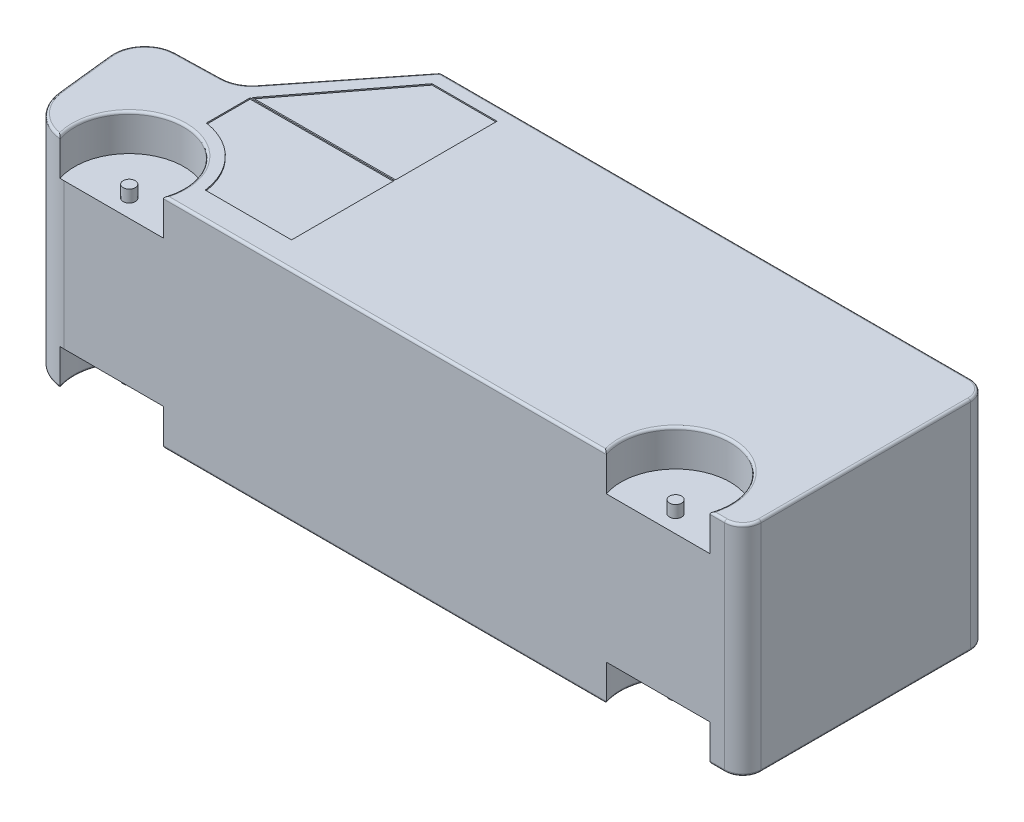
ISO-10303-21;
HEADER;
FILE_DESCRIPTION(('STEP AP214'),'2;1');
FILE_NAME('part.step','',(''),(''),'','','');
FILE_SCHEMA(('AUTOMOTIVE_DESIGN { 1 0 10303 214 1 1 1 1 }'));
ENDSEC;
DATA;
#1=APPLICATION_CONTEXT('core data for automotive mechanical design processes');
#2=APPLICATION_PROTOCOL_DEFINITION('international standard','automotive_design',2000,#1);
#3=PRODUCT_CONTEXT('',#1,'mechanical');
#4=PRODUCT('Part','Part','',(#3));
#5=PRODUCT_RELATED_PRODUCT_CATEGORY('part','',(#4));
#6=PRODUCT_DEFINITION_FORMATION('','',#4);
#7=PRODUCT_DEFINITION_CONTEXT('part definition',#1,'design');
#8=PRODUCT_DEFINITION('design','',#6,#7);
#9=PRODUCT_DEFINITION_SHAPE('','',#8);
#10=(LENGTH_UNIT() NAMED_UNIT(*) SI_UNIT(.MILLI.,.METRE.));
#11=(NAMED_UNIT(*) PLANE_ANGLE_UNIT() SI_UNIT($,.RADIAN.));
#12=(NAMED_UNIT(*) SI_UNIT($,.STERADIAN.) SOLID_ANGLE_UNIT());
#13=UNCERTAINTY_MEASURE_WITH_UNIT(LENGTH_MEASURE(1.E-05),#10,'distance_accuracy_value','');
#14=(GEOMETRIC_REPRESENTATION_CONTEXT(3) GLOBAL_UNCERTAINTY_ASSIGNED_CONTEXT((#13)) GLOBAL_UNIT_ASSIGNED_CONTEXT((#10,
#11,#12)) REPRESENTATION_CONTEXT('',''));
#15=CARTESIAN_POINT('',(0.,0.,0.));
#16=DIRECTION('',(0.,0.,1.));
#17=DIRECTION('',(1.,0.,0.));
#18=AXIS2_PLACEMENT_3D('',#15,#16,#17);
#19=CARTESIAN_POINT('',(3816.20208778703,600.,1880.79364762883));
#20=DIRECTION('',(0.,1.,0.));
#21=DIRECTION('',(0.,0.,1.));
#22=AXIS2_PLACEMENT_3D('',#19,#20,#21);
#23=CYLINDRICAL_SURFACE('',#22,50.);
#24=CARTESIAN_POINT('',(3816.20208778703,600.,1880.79364762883));
#25=DIRECTION('',(0.,1.,0.));
#26=DIRECTION('',(0.,0.,1.));
#27=AXIS2_PLACEMENT_3D('',#24,#25,#26);
#28=CIRCLE('',#27,50.);
#29=CARTESIAN_POINT('',(3816.20208778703,600.,1930.79364762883));
#30=VERTEX_POINT('',#29);
#31=EDGE_CURVE('E980',#30,#30,#28,.T.);
#32=ORIENTED_EDGE('',*,*,#31,.T.);
#33=EDGE_LOOP('',(#32));
#34=FACE_BOUND('',#33,.T.);
#35=CARTESIAN_POINT('',(3816.20208778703,700.,1880.79364762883));
#36=DIRECTION('',(0.,1.,0.));
#37=DIRECTION('',(0.,0.,1.));
#38=AXIS2_PLACEMENT_3D('',#35,#36,#37);
#39=CIRCLE('',#38,50.);
#40=CARTESIAN_POINT('',(3816.20208778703,700.,1930.79364762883));
#41=VERTEX_POINT('',#40);
#42=EDGE_CURVE('E43',#41,#41,#39,.F.);
#43=ORIENTED_EDGE('',*,*,#42,.T.);
#44=EDGE_LOOP('',(#43));
#45=FACE_BOUND('',#44,.T.);
#46=ADVANCED_FACE('F39',(#34,#45),#23,.T.);
#47=CARTESIAN_POINT('',(-683.797912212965,600.,1880.79364762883));
#48=DIRECTION('',(0.,1.,0.));
#49=DIRECTION('',(0.,0.,1.));
#50=AXIS2_PLACEMENT_3D('',#47,#48,#49);
#51=CYLINDRICAL_SURFACE('',#50,50.);
#52=CARTESIAN_POINT('',(-683.797912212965,600.,1880.79364762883));
#53=DIRECTION('',(0.,1.,0.));
#54=DIRECTION('',(0.,0.,1.));
#55=AXIS2_PLACEMENT_3D('',#52,#53,#54);
#56=CIRCLE('',#55,50.);
#57=CARTESIAN_POINT('',(-683.797912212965,600.,1930.79364762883));
#58=VERTEX_POINT('',#57);
#59=EDGE_CURVE('E1094',#58,#58,#56,.T.);
#60=ORIENTED_EDGE('',*,*,#59,.T.);
#61=EDGE_LOOP('',(#60));
#62=FACE_BOUND('',#61,.T.);
#63=CARTESIAN_POINT('',(-683.797912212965,700.,1880.79364762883));
#64=DIRECTION('',(0.,1.,0.));
#65=DIRECTION('',(0.,0.,1.));
#66=AXIS2_PLACEMENT_3D('',#63,#64,#65);
#67=CIRCLE('',#66,50.);
#68=CARTESIAN_POINT('',(-683.797912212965,700.,1930.79364762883));
#69=VERTEX_POINT('',#68);
#70=EDGE_CURVE('E989',#69,#69,#67,.F.);
#71=ORIENTED_EDGE('',*,*,#70,.T.);
#72=EDGE_LOOP('',(#71));
#73=FACE_BOUND('',#72,.T.);
#74=ADVANCED_FACE('F773',(#62,#73),#51,.T.);
#75=CARTESIAN_POINT('',(14.5013340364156,900.,30.));
#76=DIRECTION('',(0.,-1.,0.));
#77=DIRECTION('',(0.,0.,-1.));
#78=AXIS2_PLACEMENT_3D('',#75,#76,#77);
#79=PLANE('',#78);
#80=DIRECTION('',(-3.41888599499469E-05,0.,0.999999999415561));
#81=VECTOR('',#80,1.);
#82=CARTESIAN_POINT('',(582.327953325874,900.,0.0199091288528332));
#83=LINE('',#82,#81);
#84=CARTESIAN_POINT('',(582.323944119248,900.,117.286370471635));
#85=VERTEX_POINT('',#84);
#86=CARTESIAN_POINT('',(582.295372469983,900.,952.986925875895));
#87=VERTEX_POINT('',#86);
#88=EDGE_CURVE('E64',#85,#87,#83,.T.);
#89=ORIENTED_EDGE('',*,*,#88,.T.);
#90=DIRECTION('',(0.999995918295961,0.,-0.00285716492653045));
#91=VECTOR('',#90,1.);
#92=CARTESIAN_POINT('',(2.72758321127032,900.,954.642853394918));
#93=LINE('',#92,#91);
#94=CARTESIAN_POINT('',(-594.407782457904,900.,956.34897458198));
#95=VERTEX_POINT('',#94);
#96=EDGE_CURVE('E2079',#95,#87,#93,.T.);
#97=ORIENTED_EDGE('',*,*,#96,.F.);
#98=DIRECTION('',(-0.607262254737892,0.,0.794501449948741));
#99=VECTOR('',#98,1.);
#100=CARTESIAN_POINT('',(86.2008566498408,900.,65.8860050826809));
#101=LINE('',#100,#99);
#102=CARTESIAN_POINT('',(46.913953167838,900.,117.286370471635));
#103=VERTEX_POINT('',#102);
#104=EDGE_CURVE('E2099',#103,#95,#101,.T.);
#105=ORIENTED_EDGE('',*,*,#104,.F.);
#106=DIRECTION('',(1.,0.,0.));
#107=VECTOR('',#106,1.);
#108=CARTESIAN_POINT('',(0.,900.,117.286370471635));
#109=LINE('',#108,#107);
#110=EDGE_CURVE('E2097',#103,#85,#109,.T.);
#111=ORIENTED_EDGE('',*,*,#110,.T.);
#112=EDGE_LOOP('',(#89,#97,#105,#111));
#113=FACE_BOUND('',#112,.T.);
#114=CARTESIAN_POINT('',(-1076.33225021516,900.,1664.66872646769));
#115=DIRECTION('',(0.,-1.,0.));
#116=DIRECTION('',(0.,0.,-1.));
#117=AXIS2_PLACEMENT_3D('',#114,#115,#116);
#118=CIRCLE('',#117,340.276768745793);
#119=CARTESIAN_POINT('',(-1414.58957346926,900.,1701.68578487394));
#120=VERTEX_POINT('',#119);
#121=CARTESIAN_POINT('',(-1138.64050075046,900.,1999.19221034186));
#122=VERTEX_POINT('',#121);
#123=EDGE_CURVE('E1190',#120,#122,#118,.F.);
#124=ORIENTED_EDGE('',*,*,#123,.T.);
#125=CARTESIAN_POINT('',(-683.797912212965,900.,1880.79364762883));
#126=DIRECTION('',(0.,-1.,0.));
#127=DIRECTION('',(0.,0.,-1.));
#128=AXIS2_PLACEMENT_3D('',#125,#126,#127);
#129=CIRCLE('',#128,470.);
#130=CARTESIAN_POINT('',(-230.491924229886,900.,2004.94549521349));
#131=VERTEX_POINT('',#130);
#132=EDGE_CURVE('E1192',#122,#131,#129,.T.);
#133=ORIENTED_EDGE('',*,*,#132,.T.);
#134=DIRECTION('',(1.,0.,0.));
#135=VECTOR('',#134,1.);
#136=CARTESIAN_POINT('',(14.5013340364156,900.,2004.94549521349));
#137=LINE('',#136,#135);
#138=CARTESIAN_POINT('',(3362.89609980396,900.,2004.94549521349));
#139=VERTEX_POINT('',#138);
#140=EDGE_CURVE('E1165',#131,#139,#137,.T.);
#141=ORIENTED_EDGE('',*,*,#140,.T.);
#142=CARTESIAN_POINT('',(3816.20208778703,900.,1880.79364762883));
#143=DIRECTION('',(0.,-1.,0.));
#144=DIRECTION('',(0.,0.,-1.));
#145=AXIS2_PLACEMENT_3D('',#142,#143,#144);
#146=CIRCLE('',#145,470.);
#147=CARTESIAN_POINT('',(4269.50807577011,900.,2004.94549521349));
#148=VERTEX_POINT('',#147);
#149=EDGE_CURVE('E1167',#139,#148,#146,.T.);
#150=ORIENTED_EDGE('',*,*,#149,.T.);
#151=DIRECTION('',(1.,0.,0.));
#152=VECTOR('',#151,1.);
#153=CARTESIAN_POINT('',(14.5013340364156,900.,2004.94549521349));
#154=LINE('',#153,#152);
#155=CARTESIAN_POINT('',(4364.50133403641,900.,2004.94549521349));
#156=VERTEX_POINT('',#155);
#157=EDGE_CURVE('E1169',#148,#156,#154,.T.);
#158=ORIENTED_EDGE('',*,*,#157,.T.);
#159=CARTESIAN_POINT('',(4364.50133403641,900.,1874.94549521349));
#160=DIRECTION('',(0.,-1.,0.));
#161=DIRECTION('',(0.,0.,-1.));
#162=AXIS2_PLACEMENT_3D('',#159,#160,#161);
#163=CIRCLE('',#162,130.);
#164=CARTESIAN_POINT('',(4494.50133403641,900.,1874.94549521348));
#165=VERTEX_POINT('',#164);
#166=EDGE_CURVE('E1171',#156,#165,#163,.F.);
#167=ORIENTED_EDGE('',*,*,#166,.T.);
#168=DIRECTION('',(0.,0.,-1.));
#169=VECTOR('',#168,1.);
#170=CARTESIAN_POINT('',(4494.50133403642,900.,30.));
#171=LINE('',#170,#169);
#172=CARTESIAN_POINT('',(4494.50133403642,900.,150.000000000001));
#173=VERTEX_POINT('',#172);
#174=EDGE_CURVE('E1173',#165,#173,#171,.T.);
#175=ORIENTED_EDGE('',*,*,#174,.T.);
#176=CARTESIAN_POINT('',(4364.50133403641,900.,150.));
#177=DIRECTION('',(0.,-1.,0.));
#178=DIRECTION('',(0.,0.,-1.));
#179=AXIS2_PLACEMENT_3D('',#176,#177,#178);
#180=CIRCLE('',#179,130.);
#181=CARTESIAN_POINT('',(4364.50133403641,900.,19.9999999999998));
#182=VERTEX_POINT('',#181);
#183=EDGE_CURVE('E1175',#173,#182,#180,.F.);
#184=ORIENTED_EDGE('',*,*,#183,.T.);
#185=DIRECTION('',(-1.,0.,0.));
#186=VECTOR('',#185,1.);
#187=CARTESIAN_POINT('',(14.5013340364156,900.,20.));
#188=LINE('',#187,#186);
#189=CARTESIAN_POINT('',(14.5013340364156,900.,20.));
#190=VERTEX_POINT('',#189);
#191=EDGE_CURVE('E1177',#182,#190,#188,.T.);
#192=ORIENTED_EDGE('',*,*,#191,.T.);
#193=CARTESIAN_POINT('',(14.5013340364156,900.,30.));
#194=DIRECTION('',(0.,-1.,0.));
#195=DIRECTION('',(0.,0.,-1.));
#196=AXIS2_PLACEMENT_3D('',#193,#194,#195);
#197=CIRCLE('',#196,10.);
#198=CARTESIAN_POINT('',(6.66481322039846,900.,23.7880002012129));
#199=VERTEX_POINT('',#198);
#200=EDGE_CURVE('E977',#190,#199,#197,.F.);
#201=ORIENTED_EDGE('',*,*,#200,.T.);
#202=DIRECTION('',(-0.621199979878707,0.,0.78365208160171));
#203=VECTOR('',#202,1.);
#204=CARTESIAN_POINT('',(6.66481322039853,900.,23.788000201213));
#205=LINE('',#204,#203);
#206=CARTESIAN_POINT('',(-651.53939422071,900.,854.12140971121));
#207=VERTEX_POINT('',#206);
#208=EDGE_CURVE('E1180',#199,#207,#205,.T.);
#209=ORIENTED_EDGE('',*,*,#208,.T.);
#210=CARTESIAN_POINT('',(-870.961977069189,900.,680.185415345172));
#211=DIRECTION('',(0.,-1.,0.));
#212=DIRECTION('',(0.,0.,-1.));
#213=AXIS2_PLACEMENT_3D('',#210,#211,#212);
#214=CIRCLE('',#213,280.);
#215=CARTESIAN_POINT('',(-863.932459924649,900.,960.09716195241));
#216=VERTEX_POINT('',#215);
#217=EDGE_CURVE('E1182',#207,#216,#214,.T.);
#218=ORIENTED_EDGE('',*,*,#217,.T.);
#219=DIRECTION('',(-0.999684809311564,0.,0.0251054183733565));
#220=VECTOR('',#219,1.);
#221=CARTESIAN_POINT('',(37.290791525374,900.,937.464441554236));
#222=LINE('',#221,#220);
#223=CARTESIAN_POINT('',(-1233.0669921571,900.,969.367360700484));
#224=VERTEX_POINT('',#223);
#225=EDGE_CURVE('E1184',#216,#224,#222,.T.);
#226=ORIENTED_EDGE('',*,*,#225,.T.);
#227=CARTESIAN_POINT('',(-1227.0416917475,900.,1209.29171493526));
#228=DIRECTION('',(0.,-1.,0.));
#229=DIRECTION('',(0.,0.,-1.));
#230=AXIS2_PLACEMENT_3D('',#227,#228,#229);
#231=CIRCLE('',#230,240.);
#232=CARTESIAN_POINT('',(-1465.61736025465,900.,1235.40015028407));
#233=VERTEX_POINT('',#232);
#234=EDGE_CURVE('E1186',#224,#233,#231,.F.);
#235=ORIENTED_EDGE('',*,*,#234,.T.);
#236=DIRECTION('',(0.108785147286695,0.,0.99406528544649));
#237=VECTOR('',#236,1.);
#238=CARTESIAN_POINT('',(-1578.45274330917,900.,204.324308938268));
#239=LINE('',#238,#237);
#240=EDGE_CURVE('E1188',#233,#120,#239,.T.);
#241=ORIENTED_EDGE('',*,*,#240,.T.);
#242=EDGE_LOOP('',(#124,#133,#141,#150,#158,#167,#175,#184,#192,#201,#209,#218,#226,#235,#241));
#243=FACE_BOUND('',#242,.T.);
#244=CARTESIAN_POINT('',(-683.797912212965,900.,1880.79364762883));
#245=DIRECTION('',(0.,1.,0.));
#246=DIRECTION('',(0.,0.,1.));
#247=AXIS2_PLACEMENT_3D('',#244,#245,#246);
#248=CIRCLE('',#247,559.953570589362);
#249=CARTESIAN_POINT('',(-128.331487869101,900.,1810.04725095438));
#250=VERTEX_POINT('',#249);
#251=CARTESIAN_POINT('',(-602.067854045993,900.,1326.83679117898));
#252=VERTEX_POINT('',#251);
#253=EDGE_CURVE('E56',#250,#252,#248,.T.);
#254=ORIENTED_EDGE('',*,*,#253,.T.);
#255=DIRECTION('',(0.,0.,-1.));
#256=VECTOR('',#255,1.);
#257=CARTESIAN_POINT('',(-602.067854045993,900.,0.));
#258=LINE('',#257,#256);
#259=CARTESIAN_POINT('',(-602.067854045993,900.,966.370901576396));
#260=VERTEX_POINT('',#259);
#261=EDGE_CURVE('E2116',#252,#260,#258,.T.);
#262=ORIENTED_EDGE('',*,*,#261,.T.);
#263=DIRECTION('',(0.999995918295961,0.,-0.00285716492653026));
#264=VECTOR('',#263,1.);
#265=CARTESIAN_POINT('',(2.75615486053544,900.,964.642812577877));
#266=LINE('',#265,#264);
#267=CARTESIAN_POINT('',(582.323944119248,900.,962.986885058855));
#268=VERTEX_POINT('',#267);
#269=EDGE_CURVE('E2120',#260,#268,#266,.T.);
#270=ORIENTED_EDGE('',*,*,#269,.T.);
#271=DIRECTION('',(0.,0.,1.));
#272=VECTOR('',#271,1.);
#273=CARTESIAN_POINT('',(582.323944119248,900.,0.));
#274=LINE('',#273,#272);
#275=CARTESIAN_POINT('',(582.323944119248,900.,1810.04725095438));
#276=VERTEX_POINT('',#275);
#277=EDGE_CURVE('E2123',#268,#276,#274,.T.);
#278=ORIENTED_EDGE('',*,*,#277,.T.);
#279=DIRECTION('',(-1.,0.,0.));
#280=VECTOR('',#279,1.);
#281=CARTESIAN_POINT('',(0.,900.,1810.04725095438));
#282=LINE('',#281,#280);
#283=EDGE_CURVE('E993',#276,#250,#282,.T.);
#284=ORIENTED_EDGE('',*,*,#283,.T.);
#285=EDGE_LOOP('',(#254,#262,#270,#278,#284));
#286=FACE_BOUND('',#285,.T.);
#287=ADVANCED_FACE('F779',(#113,#243,#286),#79,.F.);
#288=CARTESIAN_POINT('',(14.5013340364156,900.,30.));
#289=DIRECTION('',(0.,-1.,0.));
#290=DIRECTION('',(0.,0.,-1.));
#291=AXIS2_PLACEMENT_3D('',#288,#289,#290);
#292=CYLINDRICAL_SURFACE('',#291,30.);
#293=DIRECTION('',(0.,-1.,0.));
#294=VECTOR('',#293,1.);
#295=CARTESIAN_POINT('',(-9.00822841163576,900.,11.3640006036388));
#296=LINE('',#295,#294);
#297=CARTESIAN_POINT('',(-9.00822841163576,880.,11.3640006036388));
#298=VERTEX_POINT('',#297);
#299=CARTESIAN_POINT('',(-9.00822841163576,-880.,11.3640006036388));
#300=VERTEX_POINT('',#299);
#301=EDGE_CURVE('E1154',#298,#300,#296,.T.);
#302=ORIENTED_EDGE('',*,*,#301,.F.);
#303=CARTESIAN_POINT('',(14.5013340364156,880.,30.));
#304=DIRECTION('',(0.,-1.,0.));
#305=DIRECTION('',(0.,0.,-1.));
#306=AXIS2_PLACEMENT_3D('',#303,#304,#305);
#307=CIRCLE('',#306,30.);
#308=CARTESIAN_POINT('',(14.5013340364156,880.,0.));
#309=VERTEX_POINT('',#308);
#310=EDGE_CURVE('E975',#298,#309,#307,.T.);
#311=ORIENTED_EDGE('',*,*,#310,.T.);
#312=DIRECTION('',(0.,-1.,0.));
#313=VECTOR('',#312,1.);
#314=CARTESIAN_POINT('',(14.5013340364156,900.,0.));
#315=LINE('',#314,#313);
#316=CARTESIAN_POINT('',(14.5013340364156,-880.,0.));
#317=VERTEX_POINT('',#316);
#318=EDGE_CURVE('E1130',#309,#317,#315,.T.);
#319=ORIENTED_EDGE('',*,*,#318,.T.);
#320=CARTESIAN_POINT('',(14.5013340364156,-880.,30.));
#321=DIRECTION('',(0.,-1.,0.));
#322=DIRECTION('',(0.,0.,-1.));
#323=AXIS2_PLACEMENT_3D('',#320,#321,#322);
#324=CIRCLE('',#323,30.);
#325=EDGE_CURVE('E634',#300,#317,#324,.T.);
#326=ORIENTED_EDGE('',*,*,#325,.F.);
#327=EDGE_LOOP('',(#302,#311,#319,#326));
#328=FACE_BOUND('',#327,.T.);
#329=ADVANCED_FACE('F831',(#328),#292,.T.);
#330=CARTESIAN_POINT('',(-9.00822841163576,900.,11.3640006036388));
#331=DIRECTION('',(0.78365208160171,0.,0.621199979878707));
#332=DIRECTION('',(0.621199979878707,0.,-0.78365208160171));
#333=AXIS2_PLACEMENT_3D('',#330,#331,#332);
#334=PLANE('',#333);
#335=DIRECTION('',(0.621199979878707,0.,-0.78365208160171));
#336=VECTOR('',#335,1.);
#337=CARTESIAN_POINT('',(-21.4322280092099,-850.,27.037042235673));
#338=LINE('',#337,#336);
#339=CARTESIAN_POINT('',(-645.470436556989,-850.,814.269587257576));
#340=VERTEX_POINT('',#339);
#341=CARTESIAN_POINT('',(-21.4322280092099,-850.,27.037042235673));
#342=VERTEX_POINT('',#341);
#343=EDGE_CURVE('E500',#340,#342,#338,.T.);
#344=ORIENTED_EDGE('',*,*,#343,.T.);
#345=DIRECTION('',(0.,-1.,0.));
#346=VECTOR('',#345,1.);
#347=CARTESIAN_POINT('',(-21.4322280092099,850.,27.037042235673));
#348=LINE('',#347,#346);
#349=CARTESIAN_POINT('',(-21.4322280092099,850.,27.037042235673));
#350=VERTEX_POINT('',#349);
#351=EDGE_CURVE('E1072',#350,#342,#348,.T.);
#352=ORIENTED_EDGE('',*,*,#351,.F.);
#353=DIRECTION('',(0.621199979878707,0.,-0.78365208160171));
#354=VECTOR('',#353,1.);
#355=CARTESIAN_POINT('',(-21.4322280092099,850.,27.037042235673));
#356=LINE('',#355,#354);
#357=CARTESIAN_POINT('',(-645.470436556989,850.,814.269587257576));
#358=VERTEX_POINT('',#357);
#359=EDGE_CURVE('E1066',#358,#350,#356,.T.);
#360=ORIENTED_EDGE('',*,*,#359,.F.);
#361=DIRECTION('',(0.,1.,0.));
#362=VECTOR('',#361,1.);
#363=CARTESIAN_POINT('',(-645.470436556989,850.,814.269587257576));
#364=LINE('',#363,#362);
#365=EDGE_CURVE('E1073',#340,#358,#364,.T.);
#366=ORIENTED_EDGE('',*,*,#365,.F.);
#367=EDGE_LOOP('',(#344,#352,#360,#366));
#368=FACE_BOUND('',#367,.T.);
#369=ORIENTED_EDGE('',*,*,#301,.T.);
#370=DIRECTION('',(-0.621199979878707,0.,0.78365208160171));
#371=VECTOR('',#370,1.);
#372=CARTESIAN_POINT('',(-9.00822841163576,-880.,11.3640006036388));
#373=LINE('',#372,#371);
#374=CARTESIAN_POINT('',(-667.212435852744,-880.,841.697410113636));
#375=VERTEX_POINT('',#374);
#376=EDGE_CURVE('E631',#375,#300,#373,.F.);
#377=ORIENTED_EDGE('',*,*,#376,.F.);
#378=DIRECTION('',(0.,-1.,0.));
#379=VECTOR('',#378,1.);
#380=CARTESIAN_POINT('',(-667.212435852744,900.,841.697410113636));
#381=LINE('',#380,#379);
#382=CARTESIAN_POINT('',(-667.212435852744,880.,841.697410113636));
#383=VERTEX_POINT('',#382);
#384=EDGE_CURVE('E1152',#383,#375,#381,.T.);
#385=ORIENTED_EDGE('',*,*,#384,.F.);
#386=DIRECTION('',(-0.621199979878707,0.,0.78365208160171));
#387=VECTOR('',#386,1.);
#388=CARTESIAN_POINT('',(-9.00822841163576,880.,11.3640006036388));
#389=LINE('',#388,#387);
#390=EDGE_CURVE('E1205',#383,#298,#389,.F.);
#391=ORIENTED_EDGE('',*,*,#390,.T.);
#392=EDGE_LOOP('',(#369,#377,#385,#391));
#393=FACE_BOUND('',#392,.T.);
#394=ADVANCED_FACE('F871',(#368,#393),#334,.F.);
#395=CARTESIAN_POINT('',(-870.961977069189,900.,680.185415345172));
#396=DIRECTION('',(0.,-1.,0.));
#397=DIRECTION('',(0.,0.,-1.));
#398=AXIS2_PLACEMENT_3D('',#395,#396,#397);
#399=CYLINDRICAL_SURFACE('',#398,260.);
#400=DIRECTION('',(0.,-1.,0.));
#401=VECTOR('',#400,1.);
#402=CARTESIAN_POINT('',(-864.434568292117,900.,940.103465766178));
#403=LINE('',#402,#401);
#404=CARTESIAN_POINT('',(-864.434568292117,880.,940.103465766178));
#405=VERTEX_POINT('',#404);
#406=CARTESIAN_POINT('',(-864.434568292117,-880.,940.103465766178));
#407=VERTEX_POINT('',#406);
#408=EDGE_CURVE('E1150',#405,#407,#403,.T.);
#409=ORIENTED_EDGE('',*,*,#408,.F.);
#410=CARTESIAN_POINT('',(-870.961977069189,880.,680.185415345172));
#411=DIRECTION('',(0.,-1.,0.));
#412=DIRECTION('',(0.,0.,-1.));
#413=AXIS2_PLACEMENT_3D('',#410,#411,#412);
#414=CIRCLE('',#413,260.);
#415=EDGE_CURVE('E1203',#405,#383,#414,.F.);
#416=ORIENTED_EDGE('',*,*,#415,.T.);
#417=ORIENTED_EDGE('',*,*,#384,.T.);
#418=CARTESIAN_POINT('',(-870.961977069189,-880.,680.185415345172));
#419=DIRECTION('',(0.,-1.,0.));
#420=DIRECTION('',(0.,0.,-1.));
#421=AXIS2_PLACEMENT_3D('',#418,#419,#420);
#422=CIRCLE('',#421,260.);
#423=EDGE_CURVE('E628',#407,#375,#422,.F.);
#424=ORIENTED_EDGE('',*,*,#423,.F.);
#425=EDGE_LOOP('',(#409,#416,#417,#424));
#426=FACE_BOUND('',#425,.T.);
#427=ADVANCED_FACE('F867',(#426),#399,.F.);
#428=CARTESIAN_POINT('',(-864.434568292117,900.,940.103465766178));
#429=DIRECTION('',(0.0251054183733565,0.,0.999684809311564));
#430=DIRECTION('',(0.999684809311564,0.,-0.0251054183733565));
#431=AXIS2_PLACEMENT_3D('',#428,#429,#430);
#432=PLANE('',#431);
#433=DIRECTION('',(0.,-1.,0.));
#434=VECTOR('',#433,1.);
#435=CARTESIAN_POINT('',(-1233.56910052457,900.,949.373664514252));
#436=LINE('',#435,#434);
#437=CARTESIAN_POINT('',(-1233.56910052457,880.,949.373664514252));
#438=VERTEX_POINT('',#437);
#439=CARTESIAN_POINT('',(-1233.56910052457,-880.,949.373664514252));
#440=VERTEX_POINT('',#439);
#441=EDGE_CURVE('E1148',#438,#440,#436,.T.);
#442=ORIENTED_EDGE('',*,*,#441,.F.);
#443=DIRECTION('',(-0.999684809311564,0.,0.0251054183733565));
#444=VECTOR('',#443,1.);
#445=CARTESIAN_POINT('',(-864.434568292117,880.,940.103465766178));
#446=LINE('',#445,#444);
#447=EDGE_CURVE('E1201',#438,#405,#446,.F.);
#448=ORIENTED_EDGE('',*,*,#447,.T.);
#449=ORIENTED_EDGE('',*,*,#408,.T.);
#450=DIRECTION('',(-0.999684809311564,0.,0.0251054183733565));
#451=VECTOR('',#450,1.);
#452=CARTESIAN_POINT('',(-864.434568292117,-880.,940.103465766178));
#453=LINE('',#452,#451);
#454=EDGE_CURVE('E625',#440,#407,#453,.F.);
#455=ORIENTED_EDGE('',*,*,#454,.F.);
#456=EDGE_LOOP('',(#442,#448,#449,#455));
#457=FACE_BOUND('',#456,.T.);
#458=ADVANCED_FACE('F863',(#457),#432,.F.);
#459=CARTESIAN_POINT('',(-1227.0416917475,900.,1209.29171493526));
#460=DIRECTION('',(0.,-1.,0.));
#461=DIRECTION('',(0.,0.,-1.));
#462=AXIS2_PLACEMENT_3D('',#459,#460,#461);
#463=CYLINDRICAL_SURFACE('',#462,260.);
#464=DIRECTION('',(0.,-1.,0.));
#465=VECTOR('',#464,1.);
#466=CARTESIAN_POINT('',(-1485.49866596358,900.,1237.5758532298));
#467=LINE('',#466,#465);
#468=CARTESIAN_POINT('',(-1485.49866596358,880.,1237.5758532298));
#469=VERTEX_POINT('',#468);
#470=CARTESIAN_POINT('',(-1485.49866596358,-880.,1237.5758532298));
#471=VERTEX_POINT('',#470);
#472=EDGE_CURVE('E1146',#469,#471,#467,.T.);
#473=ORIENTED_EDGE('',*,*,#472,.F.);
#474=CARTESIAN_POINT('',(-1227.0416917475,880.,1209.29171493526));
#475=DIRECTION('',(0.,-1.,0.));
#476=DIRECTION('',(0.,0.,-1.));
#477=AXIS2_PLACEMENT_3D('',#474,#475,#476);
#478=CIRCLE('',#477,260.);
#479=EDGE_CURVE('E1199',#469,#438,#478,.T.);
#480=ORIENTED_EDGE('',*,*,#479,.T.);
#481=ORIENTED_EDGE('',*,*,#441,.T.);
#482=CARTESIAN_POINT('',(-1227.0416917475,-880.,1209.29171493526));
#483=DIRECTION('',(0.,-1.,0.));
#484=DIRECTION('',(0.,0.,-1.));
#485=AXIS2_PLACEMENT_3D('',#482,#483,#484);
#486=CIRCLE('',#485,260.);
#487=EDGE_CURVE('E622',#471,#440,#486,.T.);
#488=ORIENTED_EDGE('',*,*,#487,.F.);
#489=EDGE_LOOP('',(#473,#480,#481,#488));
#490=FACE_BOUND('',#489,.T.);
#491=ADVANCED_FACE('F859',(#490),#463,.T.);
#492=CARTESIAN_POINT('',(-1485.49866596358,900.,1237.5758532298));
#493=DIRECTION('',(0.99406528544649,0.,-0.108785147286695));
#494=DIRECTION('',(-0.108785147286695,0.,-0.99406528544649));
#495=AXIS2_PLACEMENT_3D('',#492,#493,#494);
#496=PLANE('',#495);
#497=DIRECTION('',(0.,-1.,0.));
#498=VECTOR('',#497,1.);
#499=CARTESIAN_POINT('',(-1434.47087917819,900.,1703.86148781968));
#500=LINE('',#499,#498);
#501=CARTESIAN_POINT('',(-1434.47087917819,880.,1703.86148781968));
#502=VERTEX_POINT('',#501);
#503=CARTESIAN_POINT('',(-1434.47087917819,-880.,1703.86148781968));
#504=VERTEX_POINT('',#503);
#505=EDGE_CURVE('E1144',#502,#504,#500,.T.);
#506=ORIENTED_EDGE('',*,*,#505,.F.);
#507=DIRECTION('',(0.108785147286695,0.,0.99406528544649));
#508=VECTOR('',#507,1.);
#509=CARTESIAN_POINT('',(-1485.49866596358,880.,1237.5758532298));
#510=LINE('',#509,#508);
#511=EDGE_CURVE('E1197',#502,#469,#510,.F.);
#512=ORIENTED_EDGE('',*,*,#511,.T.);
#513=ORIENTED_EDGE('',*,*,#472,.T.);
#514=DIRECTION('',(0.108785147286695,0.,0.99406528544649));
#515=VECTOR('',#514,1.);
#516=CARTESIAN_POINT('',(-1485.49866596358,-880.,1237.5758532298));
#517=LINE('',#516,#515);
#518=EDGE_CURVE('E619',#504,#471,#517,.F.);
#519=ORIENTED_EDGE('',*,*,#518,.F.);
#520=EDGE_LOOP('',(#506,#512,#513,#519));
#521=FACE_BOUND('',#520,.T.);
#522=ADVANCED_FACE('F855',(#521),#496,.F.);
#523=CARTESIAN_POINT('',(-1076.33225021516,900.,1664.66872646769));
#524=DIRECTION('',(0.,-1.,0.));
#525=DIRECTION('',(0.,0.,-1.));
#526=AXIS2_PLACEMENT_3D('',#523,#524,#525);
#527=CYLINDRICAL_SURFACE('',#526,360.276768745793);
#528=DIRECTION('',(0.,1.,0.));
#529=VECTOR('',#528,1.);
#530=CARTESIAN_POINT('',(-1110.63444834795,750.,2023.30880970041));
#531=LINE('',#530,#529);
#532=CARTESIAN_POINT('',(-1110.63444834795,600.,2023.30880970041));
#533=VERTEX_POINT('',#532);
#534=CARTESIAN_POINT('',(-1110.63444834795,880.,2023.30880970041));
#535=VERTEX_POINT('',#534);
#536=EDGE_CURVE('E1102',#533,#535,#531,.T.);
#537=ORIENTED_EDGE('',*,*,#536,.T.);
#538=CARTESIAN_POINT('',(-1076.33225021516,880.,1664.66872646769));
#539=DIRECTION('',(0.,-1.,0.));
#540=DIRECTION('',(0.,0.,-1.));
#541=AXIS2_PLACEMENT_3D('',#538,#539,#540);
#542=CIRCLE('',#541,360.276768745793);
#543=EDGE_CURVE('E1195',#535,#502,#542,.T.);
#544=ORIENTED_EDGE('',*,*,#543,.T.);
#545=ORIENTED_EDGE('',*,*,#505,.T.);
#546=CARTESIAN_POINT('',(-1076.33225021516,-880.,1664.66872646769));
#547=DIRECTION('',(0.,-1.,0.));
#548=DIRECTION('',(0.,0.,-1.));
#549=AXIS2_PLACEMENT_3D('',#546,#547,#548);
#550=CIRCLE('',#549,360.276768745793);
#551=CARTESIAN_POINT('',(-1110.63444834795,-880.,2023.30880970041));
#552=VERTEX_POINT('',#551);
#553=EDGE_CURVE('E616',#552,#504,#550,.T.);
#554=ORIENTED_EDGE('',*,*,#553,.F.);
#555=DIRECTION('',(0.,-1.,0.));
#556=VECTOR('',#555,1.);
#557=CARTESIAN_POINT('',(-1110.63444834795,-750.,2023.30880970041));
#558=LINE('',#557,#556);
#559=CARTESIAN_POINT('',(-1110.63444834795,-600.,2023.30880970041));
#560=VERTEX_POINT('',#559);
#561=EDGE_CURVE('E538',#560,#552,#558,.T.);
#562=ORIENTED_EDGE('',*,*,#561,.F.);
#563=CARTESIAN_POINT('',(-1076.33225021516,-600.,1664.66872646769));
#564=DIRECTION('',(0.,1.,0.));
#565=DIRECTION('',(0.,0.,1.));
#566=AXIS2_PLACEMENT_3D('',#563,#564,#565);
#567=CIRCLE('',#566,360.276768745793);
#568=CARTESIAN_POINT('',(-1076.33225021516,-600.,2024.94549521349));
#569=VERTEX_POINT('',#568);
#570=EDGE_CURVE('E541',#560,#569,#567,.T.);
#571=ORIENTED_EDGE('',*,*,#570,.T.);
#572=DIRECTION('',(0.,-1.,0.));
#573=VECTOR('',#572,1.);
#574=CARTESIAN_POINT('',(-1076.33225021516,900.,2024.94549521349));
#575=LINE('',#574,#573);
#576=CARTESIAN_POINT('',(-1076.33225021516,600.,2024.94549521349));
#577=VERTEX_POINT('',#576);
#578=EDGE_CURVE('E1142',#577,#569,#575,.T.);
#579=ORIENTED_EDGE('',*,*,#578,.F.);
#580=CARTESIAN_POINT('',(-1076.33225021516,600.,1664.66872646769));
#581=DIRECTION('',(0.,1.,0.));
#582=DIRECTION('',(0.,0.,1.));
#583=AXIS2_PLACEMENT_3D('',#580,#581,#582);
#584=CIRCLE('',#583,360.276768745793);
#585=EDGE_CURVE('E1105',#533,#577,#584,.T.);
#586=ORIENTED_EDGE('',*,*,#585,.F.);
#587=EDGE_LOOP('',(#537,#544,#545,#554,#562,#571,#579,#586));
#588=FACE_BOUND('',#587,.T.);
#589=ADVANCED_FACE('F851',(#588),#527,.T.);
#590=CARTESIAN_POINT('',(-1076.33225021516,900.,2024.94549521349));
#591=DIRECTION('',(0.,0.,-1.));
#592=DIRECTION('',(-1.,0.,0.));
#593=AXIS2_PLACEMENT_3D('',#590,#591,#592);
#594=PLANE('',#593);
#595=DIRECTION('',(0.,-1.,0.));
#596=VECTOR('',#595,1.);
#597=CARTESIAN_POINT('',(4364.50133403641,900.,2024.94549521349));
#598=LINE('',#597,#596);
#599=CARTESIAN_POINT('',(4364.50133403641,880.,2024.94549521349));
#600=VERTEX_POINT('',#599);
#601=CARTESIAN_POINT('',(4364.50133403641,-880.,2024.94549521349));
#602=VERTEX_POINT('',#601);
#603=EDGE_CURVE('E1140',#600,#602,#598,.T.);
#604=ORIENTED_EDGE('',*,*,#603,.F.);
#605=DIRECTION('',(1.,0.,0.));
#606=VECTOR('',#605,1.);
#607=CARTESIAN_POINT('',(-1076.33225021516,880.,2024.94549521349));
#608=LINE('',#607,#606);
#609=CARTESIAN_POINT('',(4242.48866374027,880.,2024.94549521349));
#610=VERTEX_POINT('',#609);
#611=EDGE_CURVE('E48',#600,#610,#608,.F.);
#612=ORIENTED_EDGE('',*,*,#611,.T.);
#613=DIRECTION('',(0.,1.,0.));
#614=VECTOR('',#613,1.);
#615=CARTESIAN_POINT('',(4242.48866374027,600.,2024.94549521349));
#616=LINE('',#615,#614);
#617=CARTESIAN_POINT('',(4242.48866374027,600.,2024.94549521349));
#618=VERTEX_POINT('',#617);
#619=EDGE_CURVE('E1089',#610,#618,#616,.F.);
#620=ORIENTED_EDGE('',*,*,#619,.T.);
#621=DIRECTION('',(1.,0.,0.));
#622=VECTOR('',#621,1.);
#623=CARTESIAN_POINT('',(-1076.33225021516,600.,2024.94549521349));
#624=LINE('',#623,#622);
#625=CARTESIAN_POINT('',(3389.9155118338,600.,2024.94549521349));
#626=VERTEX_POINT('',#625);
#627=EDGE_CURVE('E1159',#626,#618,#624,.T.);
#628=ORIENTED_EDGE('',*,*,#627,.F.);
#629=DIRECTION('',(0.,1.,0.));
#630=VECTOR('',#629,1.);
#631=CARTESIAN_POINT('',(3389.9155118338,600.,2024.94549521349));
#632=LINE('',#631,#630);
#633=CARTESIAN_POINT('',(3389.9155118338,880.,2024.94549521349));
#634=VERTEX_POINT('',#633);
#635=EDGE_CURVE('E1091',#626,#634,#632,.T.);
#636=ORIENTED_EDGE('',*,*,#635,.T.);
#637=DIRECTION('',(1.,0.,0.));
#638=VECTOR('',#637,1.);
#639=CARTESIAN_POINT('',(-1076.33225021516,880.,2024.94549521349));
#640=LINE('',#639,#638);
#641=CARTESIAN_POINT('',(-257.511336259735,880.,2024.94549521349));
#642=VERTEX_POINT('',#641);
#643=EDGE_CURVE('E1216',#634,#642,#640,.F.);
#644=ORIENTED_EDGE('',*,*,#643,.T.);
#645=DIRECTION('',(0.,1.,0.));
#646=VECTOR('',#645,1.);
#647=CARTESIAN_POINT('',(-257.511336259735,600.,2024.94549521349));
#648=LINE('',#647,#646);
#649=CARTESIAN_POINT('',(-257.511336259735,600.,2024.94549521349));
#650=VERTEX_POINT('',#649);
#651=EDGE_CURVE('E1100',#642,#650,#648,.F.);
#652=ORIENTED_EDGE('',*,*,#651,.T.);
#653=DIRECTION('',(1.,0.,0.));
#654=VECTOR('',#653,1.);
#655=CARTESIAN_POINT('',(-1076.33225021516,600.,2024.94549521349));
#656=LINE('',#655,#654);
#657=EDGE_CURVE('E1156',#577,#650,#656,.T.);
#658=ORIENTED_EDGE('',*,*,#657,.F.);
#659=ORIENTED_EDGE('',*,*,#578,.T.);
#660=DIRECTION('',(1.,0.,0.));
#661=VECTOR('',#660,1.);
#662=CARTESIAN_POINT('',(-1076.33225021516,-600.,2024.94549521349));
#663=LINE('',#662,#661);
#664=CARTESIAN_POINT('',(-257.511336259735,-600.,2024.94549521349));
#665=VERTEX_POINT('',#664);
#666=EDGE_CURVE('E560',#569,#665,#663,.T.);
#667=ORIENTED_EDGE('',*,*,#666,.T.);
#668=DIRECTION('',(0.,-1.,0.));
#669=VECTOR('',#668,1.);
#670=CARTESIAN_POINT('',(-257.511336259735,-600.,2024.94549521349));
#671=LINE('',#670,#669);
#672=CARTESIAN_POINT('',(-257.511336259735,-880.,2024.94549521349));
#673=VERTEX_POINT('',#672);
#674=EDGE_CURVE('E535',#673,#665,#671,.F.);
#675=ORIENTED_EDGE('',*,*,#674,.F.);
#676=DIRECTION('',(1.,0.,0.));
#677=VECTOR('',#676,1.);
#678=CARTESIAN_POINT('',(-1076.33225021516,-880.,2024.94549521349));
#679=LINE('',#678,#677);
#680=CARTESIAN_POINT('',(3389.9155118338,-880.,2024.94549521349));
#681=VERTEX_POINT('',#680);
#682=EDGE_CURVE('E649',#681,#673,#679,.F.);
#683=ORIENTED_EDGE('',*,*,#682,.F.);
#684=DIRECTION('',(0.,-1.,0.));
#685=VECTOR('',#684,1.);
#686=CARTESIAN_POINT('',(3389.9155118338,-600.,2024.94549521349));
#687=LINE('',#686,#685);
#688=CARTESIAN_POINT('',(3389.9155118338,-600.,2024.94549521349));
#689=VERTEX_POINT('',#688);
#690=EDGE_CURVE('E527',#689,#681,#687,.T.);
#691=ORIENTED_EDGE('',*,*,#690,.F.);
#692=DIRECTION('',(1.,0.,0.));
#693=VECTOR('',#692,1.);
#694=CARTESIAN_POINT('',(-1076.33225021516,-600.,2024.94549521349));
#695=LINE('',#694,#693);
#696=CARTESIAN_POINT('',(4242.48866374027,-600.,2024.94549521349));
#697=VERTEX_POINT('',#696);
#698=EDGE_CURVE('E565',#689,#697,#695,.T.);
#699=ORIENTED_EDGE('',*,*,#698,.T.);
#700=DIRECTION('',(0.,-1.,0.));
#701=VECTOR('',#700,1.);
#702=CARTESIAN_POINT('',(4242.48866374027,-600.,2024.94549521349));
#703=LINE('',#702,#701);
#704=CARTESIAN_POINT('',(4242.48866374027,-880.,2024.94549521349));
#705=VERTEX_POINT('',#704);
#706=EDGE_CURVE('E524',#705,#697,#703,.F.);
#707=ORIENTED_EDGE('',*,*,#706,.F.);
#708=DIRECTION('',(1.,0.,0.));
#709=VECTOR('',#708,1.);
#710=CARTESIAN_POINT('',(-1076.33225021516,-880.,2024.94549521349));
#711=LINE('',#710,#709);
#712=EDGE_CURVE('E652',#602,#705,#711,.F.);
#713=ORIENTED_EDGE('',*,*,#712,.F.);
#714=EDGE_LOOP('',(#604,#612,#620,#628,#636,#644,#652,#658,#659,#667,#675,#683,#691,#699,#707,#713));
#715=FACE_BOUND('',#714,.T.);
#716=ADVANCED_FACE('F847',(#715),#594,.F.);
#717=CARTESIAN_POINT('',(4364.50133403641,900.,1874.94549521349));
#718=DIRECTION('',(0.,-1.,0.));
#719=DIRECTION('',(0.,0.,-1.));
#720=AXIS2_PLACEMENT_3D('',#717,#718,#719);
#721=CYLINDRICAL_SURFACE('',#720,150.);
#722=DIRECTION('',(0.,-1.,0.));
#723=VECTOR('',#722,1.);
#724=CARTESIAN_POINT('',(4514.50133403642,900.,1874.94549521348));
#725=LINE('',#724,#723);
#726=CARTESIAN_POINT('',(4514.50133403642,880.,1874.94549521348));
#727=VERTEX_POINT('',#726);
#728=CARTESIAN_POINT('',(4514.50133403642,-880.,1874.94549521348));
#729=VERTEX_POINT('',#728);
#730=EDGE_CURVE('E1138',#727,#729,#725,.T.);
#731=ORIENTED_EDGE('',*,*,#730,.F.);
#732=CARTESIAN_POINT('',(4364.50133403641,880.,1874.94549521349));
#733=DIRECTION('',(0.,-1.,0.));
#734=DIRECTION('',(0.,0.,-1.));
#735=AXIS2_PLACEMENT_3D('',#732,#733,#734);
#736=CIRCLE('',#735,150.);
#737=EDGE_CURVE('E1214',#727,#600,#736,.T.);
#738=ORIENTED_EDGE('',*,*,#737,.T.);
#739=ORIENTED_EDGE('',*,*,#603,.T.);
#740=CARTESIAN_POINT('',(4364.50133403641,-880.,1874.94549521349));
#741=DIRECTION('',(0.,-1.,0.));
#742=DIRECTION('',(0.,0.,-1.));
#743=AXIS2_PLACEMENT_3D('',#740,#741,#742);
#744=CIRCLE('',#743,150.);
#745=EDGE_CURVE('E646',#729,#602,#744,.T.);
#746=ORIENTED_EDGE('',*,*,#745,.F.);
#747=EDGE_LOOP('',(#731,#738,#739,#746));
#748=FACE_BOUND('',#747,.T.);
#749=ADVANCED_FACE('F843',(#748),#721,.T.);
#750=CARTESIAN_POINT('',(4514.50133403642,900.,150.000000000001));
#751=DIRECTION('',(-1.,0.,0.));
#752=DIRECTION('',(0.,0.,1.));
#753=AXIS2_PLACEMENT_3D('',#750,#751,#752);
#754=PLANE('',#753);
#755=DIRECTION('',(0.,-1.,0.));
#756=VECTOR('',#755,1.);
#757=CARTESIAN_POINT('',(4514.50133403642,900.,150.000000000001));
#758=LINE('',#757,#756);
#759=CARTESIAN_POINT('',(4514.50133403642,880.,150.000000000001));
#760=VERTEX_POINT('',#759);
#761=CARTESIAN_POINT('',(4514.50133403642,-880.,150.000000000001));
#762=VERTEX_POINT('',#761);
#763=EDGE_CURVE('E1136',#760,#762,#758,.T.);
#764=ORIENTED_EDGE('',*,*,#763,.F.);
#765=DIRECTION('',(0.,0.,-1.));
#766=VECTOR('',#765,1.);
#767=CARTESIAN_POINT('',(4514.50133403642,880.,150.000000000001));
#768=LINE('',#767,#766);
#769=EDGE_CURVE('E1212',#760,#727,#768,.F.);
#770=ORIENTED_EDGE('',*,*,#769,.T.);
#771=ORIENTED_EDGE('',*,*,#730,.T.);
#772=DIRECTION('',(0.,0.,-1.));
#773=VECTOR('',#772,1.);
#774=CARTESIAN_POINT('',(4514.50133403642,-880.,150.000000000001));
#775=LINE('',#774,#773);
#776=EDGE_CURVE('E643',#762,#729,#775,.F.);
#777=ORIENTED_EDGE('',*,*,#776,.F.);
#778=EDGE_LOOP('',(#764,#770,#771,#777));
#779=FACE_BOUND('',#778,.T.);
#780=ADVANCED_FACE('F839',(#779),#754,.F.);
#781=CARTESIAN_POINT('',(4364.50133403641,900.,150.));
#782=DIRECTION('',(0.,-1.,0.));
#783=DIRECTION('',(0.,0.,-1.));
#784=AXIS2_PLACEMENT_3D('',#781,#782,#783);
#785=CYLINDRICAL_SURFACE('',#784,150.);
#786=DIRECTION('',(0.,-1.,0.));
#787=VECTOR('',#786,1.);
#788=CARTESIAN_POINT('',(4364.50133403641,900.,-1.94289029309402E-13));
#789=LINE('',#788,#787);
#790=CARTESIAN_POINT('',(4364.50133403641,880.,-1.94289029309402E-13));
#791=VERTEX_POINT('',#790);
#792=CARTESIAN_POINT('',(4364.50133403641,-880.,-1.94289029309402E-13));
#793=VERTEX_POINT('',#792);
#794=EDGE_CURVE('E1134',#791,#793,#789,.T.);
#795=ORIENTED_EDGE('',*,*,#794,.F.);
#796=CARTESIAN_POINT('',(4364.50133403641,880.,150.));
#797=DIRECTION('',(0.,-1.,0.));
#798=DIRECTION('',(0.,0.,-1.));
#799=AXIS2_PLACEMENT_3D('',#796,#797,#798);
#800=CIRCLE('',#799,150.);
#801=EDGE_CURVE('E1210',#791,#760,#800,.T.);
#802=ORIENTED_EDGE('',*,*,#801,.T.);
#803=ORIENTED_EDGE('',*,*,#763,.T.);
#804=CARTESIAN_POINT('',(4364.50133403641,-880.,150.));
#805=DIRECTION('',(0.,-1.,0.));
#806=DIRECTION('',(0.,0.,-1.));
#807=AXIS2_PLACEMENT_3D('',#804,#805,#806);
#808=CIRCLE('',#807,150.);
#809=EDGE_CURVE('E640',#793,#762,#808,.T.);
#810=ORIENTED_EDGE('',*,*,#809,.F.);
#811=EDGE_LOOP('',(#795,#802,#803,#810));
#812=FACE_BOUND('',#811,.T.);
#813=ADVANCED_FACE('F835',(#812),#785,.T.);
#814=CARTESIAN_POINT('',(14.5013340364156,900.,0.));
#815=DIRECTION('',(0.,0.,1.));
#816=DIRECTION('',(1.,0.,0.));
#817=AXIS2_PLACEMENT_3D('',#814,#815,#816);
#818=PLANE('',#817);
#819=DIRECTION('',(-1.,0.,0.));
#820=VECTOR('',#819,1.);
#821=CARTESIAN_POINT('',(14.5013340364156,-880.,0.));
#822=LINE('',#821,#820);
#823=EDGE_CURVE('E637',#317,#793,#822,.F.);
#824=ORIENTED_EDGE('',*,*,#823,.F.);
#825=ORIENTED_EDGE('',*,*,#318,.F.);
#826=DIRECTION('',(-1.,0.,0.));
#827=VECTOR('',#826,1.);
#828=CARTESIAN_POINT('',(14.5013340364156,880.,0.));
#829=LINE('',#828,#827);
#830=EDGE_CURVE('E1208',#309,#791,#829,.F.);
#831=ORIENTED_EDGE('',*,*,#830,.T.);
#832=ORIENTED_EDGE('',*,*,#794,.T.);
#833=EDGE_LOOP('',(#824,#825,#831,#832));
#834=FACE_BOUND('',#833,.T.);
#835=CARTESIAN_POINT('',(264.501334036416,250.,0.));
#836=DIRECTION('',(0.,0.,-1.));
#837=DIRECTION('',(1.,0.,0.));
#838=AXIS2_PLACEMENT_3D('',#835,#836,#837);
#839=CIRCLE('',#838,4.99999999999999);
#840=CARTESIAN_POINT('',(269.501334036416,250.,0.));
#841=VERTEX_POINT('',#840);
#842=EDGE_CURVE('E1107',#841,#841,#839,.T.);
#843=ORIENTED_EDGE('',*,*,#842,.F.);
#844=EDGE_LOOP('',(#843));
#845=FACE_BOUND('',#844,.T.);
#846=DIRECTION('',(0.,1.,0.));
#847=VECTOR('',#846,1.);
#848=CARTESIAN_POINT('',(994.501334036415,10.,0.));
#849=LINE('',#848,#847);
#850=CARTESIAN_POINT('',(994.501334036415,-10.,0.));
#851=VERTEX_POINT('',#850);
#852=CARTESIAN_POINT('',(994.501334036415,10.,0.));
#853=VERTEX_POINT('',#852);
#854=EDGE_CURVE('E1111',#851,#853,#849,.T.);
#855=ORIENTED_EDGE('',*,*,#854,.F.);
#856=DIRECTION('',(1.,0.,0.));
#857=VECTOR('',#856,1.);
#858=CARTESIAN_POINT('',(1034.50133403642,-10.,0.));
#859=LINE('',#858,#857);
#860=CARTESIAN_POINT('',(1034.50133403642,-10.,0.));
#861=VERTEX_POINT('',#860);
#862=EDGE_CURVE('E548',#851,#861,#859,.T.);
#863=ORIENTED_EDGE('',*,*,#862,.T.);
#864=DIRECTION('',(0.,-1.,0.));
#865=VECTOR('',#864,1.);
#866=CARTESIAN_POINT('',(1034.50133403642,10.,0.));
#867=LINE('',#866,#865);
#868=CARTESIAN_POINT('',(1034.50133403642,10.,0.));
#869=VERTEX_POINT('',#868);
#870=EDGE_CURVE('E1117',#869,#861,#867,.T.);
#871=ORIENTED_EDGE('',*,*,#870,.F.);
#872=DIRECTION('',(1.,0.,0.));
#873=VECTOR('',#872,1.);
#874=CARTESIAN_POINT('',(1034.50133403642,10.,0.));
#875=LINE('',#874,#873);
#876=EDGE_CURVE('E1124',#853,#869,#875,.T.);
#877=ORIENTED_EDGE('',*,*,#876,.F.);
#878=EDGE_LOOP('',(#855,#863,#871,#877));
#879=FACE_BOUND('',#878,.T.);
#880=CARTESIAN_POINT('',(264.501334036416,-250.,0.));
#881=DIRECTION('',(0.,0.,1.));
#882=DIRECTION('',(1.,0.,0.));
#883=AXIS2_PLACEMENT_3D('',#880,#881,#882);
#884=CIRCLE('',#883,4.99999999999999);
#885=CARTESIAN_POINT('',(269.501334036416,-250.,0.));
#886=VERTEX_POINT('',#885);
#887=EDGE_CURVE('E544',#886,#886,#884,.T.);
#888=ORIENTED_EDGE('',*,*,#887,.T.);
#889=EDGE_LOOP('',(#888));
#890=FACE_BOUND('',#889,.T.);
#891=ADVANCED_FACE('F827',(#834,#845,#879,#890),#818,.F.);
#892=CARTESIAN_POINT('',(994.501334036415,10.,30.));
#893=DIRECTION('',(-1.,0.,0.));
#894=DIRECTION('',(0.,0.,1.));
#895=AXIS2_PLACEMENT_3D('',#892,#893,#894);
#896=PLANE('',#895);
#897=DIRECTION('',(0.,1.,0.));
#898=VECTOR('',#897,1.);
#899=CARTESIAN_POINT('',(994.501334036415,10.,30.));
#900=LINE('',#899,#898);
#901=CARTESIAN_POINT('',(994.501334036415,-10.,30.));
#902=VERTEX_POINT('',#901);
#903=CARTESIAN_POINT('',(994.501334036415,10.,30.));
#904=VERTEX_POINT('',#903);
#905=EDGE_CURVE('E1114',#902,#904,#900,.T.);
#906=ORIENTED_EDGE('',*,*,#905,.F.);
#907=DIRECTION('',(0.,0.,-1.));
#908=VECTOR('',#907,1.);
#909=CARTESIAN_POINT('',(994.501334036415,-10.,30.));
#910=LINE('',#909,#908);
#911=EDGE_CURVE('E554',#902,#851,#910,.T.);
#912=ORIENTED_EDGE('',*,*,#911,.T.);
#913=ORIENTED_EDGE('',*,*,#854,.T.);
#914=DIRECTION('',(0.,0.,-1.));
#915=VECTOR('',#914,1.);
#916=CARTESIAN_POINT('',(994.501334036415,10.,30.));
#917=LINE('',#916,#915);
#918=EDGE_CURVE('E1122',#904,#853,#917,.T.);
#919=ORIENTED_EDGE('',*,*,#918,.F.);
#920=EDGE_LOOP('',(#906,#912,#913,#919));
#921=FACE_BOUND('',#920,.T.);
#922=ADVANCED_FACE('F820',(#921),#896,.F.);
#923=CARTESIAN_POINT('',(1034.50133403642,10.,30.));
#924=DIRECTION('',(1.,0.,0.));
#925=DIRECTION('',(0.,0.,-1.));
#926=AXIS2_PLACEMENT_3D('',#923,#924,#925);
#927=PLANE('',#926);
#928=ORIENTED_EDGE('',*,*,#870,.T.);
#929=DIRECTION('',(0.,0.,-1.));
#930=VECTOR('',#929,1.);
#931=CARTESIAN_POINT('',(1034.50133403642,-10.,30.));
#932=LINE('',#931,#930);
#933=CARTESIAN_POINT('',(1034.50133403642,-10.,30.));
#934=VERTEX_POINT('',#933);
#935=EDGE_CURVE('E557',#934,#861,#932,.T.);
#936=ORIENTED_EDGE('',*,*,#935,.F.);
#937=DIRECTION('',(0.,-1.,0.));
#938=VECTOR('',#937,1.);
#939=CARTESIAN_POINT('',(1034.50133403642,10.,30.));
#940=LINE('',#939,#938);
#941=CARTESIAN_POINT('',(1034.50133403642,10.,30.));
#942=VERTEX_POINT('',#941);
#943=EDGE_CURVE('E1120',#942,#934,#940,.T.);
#944=ORIENTED_EDGE('',*,*,#943,.F.);
#945=DIRECTION('',(0.,0.,-1.));
#946=VECTOR('',#945,1.);
#947=CARTESIAN_POINT('',(1034.50133403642,10.,30.));
#948=LINE('',#947,#946);
#949=EDGE_CURVE('E1128',#942,#869,#948,.T.);
#950=ORIENTED_EDGE('',*,*,#949,.T.);
#951=EDGE_LOOP('',(#928,#936,#944,#950));
#952=FACE_BOUND('',#951,.T.);
#953=ADVANCED_FACE('F817',(#952),#927,.F.);
#954=CARTESIAN_POINT('',(1034.50133403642,10.,30.));
#955=DIRECTION('',(0.,1.,0.));
#956=DIRECTION('',(0.,0.,1.));
#957=AXIS2_PLACEMENT_3D('',#954,#955,#956);
#958=PLANE('',#957);
#959=ORIENTED_EDGE('',*,*,#876,.T.);
#960=ORIENTED_EDGE('',*,*,#949,.F.);
#961=DIRECTION('',(1.,0.,0.));
#962=VECTOR('',#961,1.);
#963=CARTESIAN_POINT('',(1034.50133403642,10.,30.));
#964=LINE('',#963,#962);
#965=EDGE_CURVE('E1116',#904,#942,#964,.T.);
#966=ORIENTED_EDGE('',*,*,#965,.F.);
#967=ORIENTED_EDGE('',*,*,#918,.T.);
#968=EDGE_LOOP('',(#959,#960,#966,#967));
#969=FACE_BOUND('',#968,.T.);
#970=ADVANCED_FACE('F815',(#969),#958,.F.);
#971=CARTESIAN_POINT('',(0.,0.,30.));
#972=DIRECTION('',(0.,0.,-1.));
#973=DIRECTION('',(-1.,0.,0.));
#974=AXIS2_PLACEMENT_3D('',#971,#972,#973);
#975=PLANE('',#974);
#976=ORIENTED_EDGE('',*,*,#905,.T.);
#977=ORIENTED_EDGE('',*,*,#965,.T.);
#978=ORIENTED_EDGE('',*,*,#943,.T.);
#979=DIRECTION('',(1.,0.,0.));
#980=VECTOR('',#979,1.);
#981=CARTESIAN_POINT('',(1034.50133403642,-10.,30.));
#982=LINE('',#981,#980);
#983=EDGE_CURVE('E551',#902,#934,#982,.T.);
#984=ORIENTED_EDGE('',*,*,#983,.F.);
#985=EDGE_LOOP('',(#976,#977,#978,#984));
#986=FACE_BOUND('',#985,.T.);
#987=ADVANCED_FACE('F811',(#986),#975,.T.);
#988=CARTESIAN_POINT('',(264.501334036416,250.,10.));
#989=DIRECTION('',(0.,0.,-1.));
#990=DIRECTION('',(-1.,0.,0.));
#991=AXIS2_PLACEMENT_3D('',#988,#989,#990);
#992=CYLINDRICAL_SURFACE('',#991,4.99999999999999);
#993=CARTESIAN_POINT('',(264.501334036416,250.,10.));
#994=DIRECTION('',(0.,0.,-1.));
#995=DIRECTION('',(1.,0.,0.));
#996=AXIS2_PLACEMENT_3D('',#993,#994,#995);
#997=CIRCLE('',#996,4.99999999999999);
#998=CARTESIAN_POINT('',(269.501334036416,250.,10.));
#999=VERTEX_POINT('',#998);
#1000=EDGE_CURVE('E1108',#999,#999,#997,.T.);
#1001=ORIENTED_EDGE('',*,*,#1000,.F.);
#1002=EDGE_LOOP('',(#1001));
#1003=FACE_BOUND('',#1002,.T.);
#1004=ORIENTED_EDGE('',*,*,#842,.T.);
#1005=EDGE_LOOP('',(#1004));
#1006=FACE_BOUND('',#1005,.T.);
#1007=ADVANCED_FACE('F807',(#1003,#1006),#992,.F.);
#1008=CARTESIAN_POINT('',(264.501334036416,250.,10.));
#1009=DIRECTION('',(0.,0.,1.));
#1010=DIRECTION('',(1.,0.,0.));
#1011=AXIS2_PLACEMENT_3D('',#1008,#1009,#1010);
#1012=PLANE('',#1011);
#1013=ORIENTED_EDGE('',*,*,#1000,.T.);
#1014=EDGE_LOOP('',(#1013));
#1015=FACE_BOUND('',#1014,.T.);
#1016=ADVANCED_FACE('F800',(#1015),#1012,.F.);
#1017=CARTESIAN_POINT('',(-683.797912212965,600.,1880.79364762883));
#1018=DIRECTION('',(0.,1.,0.));
#1019=DIRECTION('',(0.,0.,1.));
#1020=AXIS2_PLACEMENT_3D('',#1017,#1018,#1019);
#1021=PLANE('',#1020);
#1022=ORIENTED_EDGE('',*,*,#59,.F.);
#1023=EDGE_LOOP('',(#1022));
#1024=FACE_BOUND('',#1023,.T.);
#1025=ORIENTED_EDGE('',*,*,#585,.T.);
#1026=ORIENTED_EDGE('',*,*,#657,.T.);
#1027=CARTESIAN_POINT('',(-683.797912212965,600.,1880.79364762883));
#1028=DIRECTION('',(0.,1.,0.));
#1029=DIRECTION('',(0.,0.,1.));
#1030=AXIS2_PLACEMENT_3D('',#1027,#1028,#1029);
#1031=CIRCLE('',#1030,450.);
#1032=EDGE_CURVE('E1097',#650,#533,#1031,.T.);
#1033=ORIENTED_EDGE('',*,*,#1032,.T.);
#1034=EDGE_LOOP('',(#1025,#1026,#1033));
#1035=FACE_BOUND('',#1034,.T.);
#1036=ADVANCED_FACE('F797',(#1024,#1035),#1021,.T.);
#1037=CARTESIAN_POINT('',(-683.797912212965,600.,1880.79364762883));
#1038=DIRECTION('',(0.,1.,0.));
#1039=DIRECTION('',(0.,0.,1.));
#1040=AXIS2_PLACEMENT_3D('',#1037,#1038,#1039);
#1041=CYLINDRICAL_SURFACE('',#1040,450.);
#1042=ORIENTED_EDGE('',*,*,#651,.F.);
#1043=CARTESIAN_POINT('',(-683.797912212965,880.,1880.79364762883));
#1044=DIRECTION('',(0.,-1.,0.));
#1045=DIRECTION('',(0.,0.,-1.));
#1046=AXIS2_PLACEMENT_3D('',#1043,#1044,#1045);
#1047=CIRCLE('',#1046,450.);
#1048=EDGE_CURVE('E1162',#642,#535,#1047,.F.);
#1049=ORIENTED_EDGE('',*,*,#1048,.T.);
#1050=ORIENTED_EDGE('',*,*,#536,.F.);
#1051=ORIENTED_EDGE('',*,*,#1032,.F.);
#1052=EDGE_LOOP('',(#1042,#1049,#1050,#1051));
#1053=FACE_BOUND('',#1052,.T.);
#1054=ADVANCED_FACE('F792',(#1053),#1041,.F.);
#1055=CARTESIAN_POINT('',(3816.20208778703,600.,1880.79364762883));
#1056=DIRECTION('',(0.,1.,0.));
#1057=DIRECTION('',(0.,0.,1.));
#1058=AXIS2_PLACEMENT_3D('',#1055,#1056,#1057);
#1059=PLANE('',#1058);
#1060=ORIENTED_EDGE('',*,*,#31,.F.);
#1061=EDGE_LOOP('',(#1060));
#1062=FACE_BOUND('',#1061,.T.);
#1063=ORIENTED_EDGE('',*,*,#627,.T.);
#1064=CARTESIAN_POINT('',(3816.20208778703,600.,1880.79364762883));
#1065=DIRECTION('',(0.,1.,0.));
#1066=DIRECTION('',(0.,0.,1.));
#1067=AXIS2_PLACEMENT_3D('',#1064,#1065,#1066);
#1068=CIRCLE('',#1067,450.);
#1069=EDGE_CURVE('E983',#618,#626,#1068,.T.);
#1070=ORIENTED_EDGE('',*,*,#1069,.T.);
#1071=EDGE_LOOP('',(#1063,#1070));
#1072=FACE_BOUND('',#1071,.T.);
#1073=ADVANCED_FACE('F788',(#1062,#1072),#1059,.T.);
#1074=CARTESIAN_POINT('',(3816.20208778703,600.,1880.79364762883));
#1075=DIRECTION('',(0.,1.,0.));
#1076=DIRECTION('',(0.,0.,1.));
#1077=AXIS2_PLACEMENT_3D('',#1074,#1075,#1076);
#1078=CYLINDRICAL_SURFACE('',#1077,450.);
#1079=ORIENTED_EDGE('',*,*,#619,.F.);
#1080=CARTESIAN_POINT('',(3816.20208778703,880.,1880.79364762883));
#1081=DIRECTION('',(0.,-1.,0.));
#1082=DIRECTION('',(0.,0.,-1.));
#1083=AXIS2_PLACEMENT_3D('',#1080,#1081,#1082);
#1084=CIRCLE('',#1083,450.);
#1085=EDGE_CURVE('E11',#610,#634,#1084,.F.);
#1086=ORIENTED_EDGE('',*,*,#1085,.T.);
#1087=ORIENTED_EDGE('',*,*,#635,.F.);
#1088=ORIENTED_EDGE('',*,*,#1069,.F.);
#1089=EDGE_LOOP('',(#1079,#1086,#1087,#1088));
#1090=FACE_BOUND('',#1089,.T.);
#1091=ADVANCED_FACE('F791',(#1090),#1078,.F.);
#1092=CARTESIAN_POINT('',(14.5013340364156,880.,20.));
#1093=DIRECTION('',(-1.,0.,0.));
#1094=DIRECTION('',(0.,0.,1.));
#1095=AXIS2_PLACEMENT_3D('',#1092,#1093,#1094);
#1096=CYLINDRICAL_SURFACE('',#1095,20.);
#1097=CARTESIAN_POINT('',(4364.50133403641,880.,20.));
#1098=DIRECTION('',(1.,0.,0.));
#1099=DIRECTION('',(0.,0.,-1.));
#1100=AXIS2_PLACEMENT_3D('',#1097,#1098,#1099);
#1101=CIRCLE('',#1100,20.);
#1102=EDGE_CURVE('E981',#791,#182,#1101,.T.);
#1103=ORIENTED_EDGE('',*,*,#1102,.F.);
#1104=ORIENTED_EDGE('',*,*,#830,.F.);
#1105=CARTESIAN_POINT('',(14.5013340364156,880.,20.));
#1106=DIRECTION('',(-1.,0.,0.));
#1107=DIRECTION('',(0.,0.,1.));
#1108=AXIS2_PLACEMENT_3D('',#1105,#1106,#1107);
#1109=CIRCLE('',#1108,20.);
#1110=EDGE_CURVE('E973',#190,#309,#1109,.T.);
#1111=ORIENTED_EDGE('',*,*,#1110,.F.);
#1112=ORIENTED_EDGE('',*,*,#191,.F.);
#1113=EDGE_LOOP('',(#1103,#1104,#1111,#1112));
#1114=FACE_BOUND('',#1113,.T.);
#1115=ADVANCED_FACE('F41',(#1114),#1096,.T.);
#1116=CARTESIAN_POINT('',(14.5013340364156,880.,30.));
#1117=DIRECTION('',(0.,-1.,0.));
#1118=DIRECTION('',(0.,0.,-1.));
#1119=AXIS2_PLACEMENT_3D('',#1116,#1117,#1118);
#1120=DEGENERATE_TOROIDAL_SURFACE('',#1119,10.,20.,.T.);
#1121=ORIENTED_EDGE('',*,*,#1110,.T.);
#1122=ORIENTED_EDGE('',*,*,#310,.F.);
#1123=CARTESIAN_POINT('',(6.66481322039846,880.,23.7880002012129));
#1124=DIRECTION('',(-0.621199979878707,0.,0.783652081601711));
#1125=DIRECTION('',(0.783652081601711,0.,0.621199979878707));
#1126=AXIS2_PLACEMENT_3D('',#1123,#1124,#1125);
#1127=CIRCLE('',#1126,20.);
#1128=EDGE_CURVE('E986',#199,#298,#1127,.T.);
#1129=ORIENTED_EDGE('',*,*,#1128,.F.);
#1130=ORIENTED_EDGE('',*,*,#200,.F.);
#1131=EDGE_LOOP('',(#1121,#1122,#1129,#1130));
#1132=FACE_BOUND('',#1131,.T.);
#1133=ADVANCED_FACE('F961',(#1132),#1120,.T.);
#1134=CARTESIAN_POINT('',(4364.50133403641,880.,150.));
#1135=DIRECTION('',(0.,-1.,0.));
#1136=DIRECTION('',(0.,0.,-1.));
#1137=AXIS2_PLACEMENT_3D('',#1134,#1135,#1136);
#1138=TOROIDAL_SURFACE('',#1137,130.,20.);
#1139=ORIENTED_EDGE('',*,*,#1102,.T.);
#1140=ORIENTED_EDGE('',*,*,#183,.F.);
#1141=CARTESIAN_POINT('',(4494.50133403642,880.,150.000000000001));
#1142=DIRECTION('',(0.,0.,1.));
#1143=DIRECTION('',(1.,0.,0.));
#1144=AXIS2_PLACEMENT_3D('',#1141,#1142,#1143);
#1145=CIRCLE('',#1144,20.);
#1146=EDGE_CURVE('E1293',#760,#173,#1145,.T.);
#1147=ORIENTED_EDGE('',*,*,#1146,.F.);
#1148=ORIENTED_EDGE('',*,*,#801,.F.);
#1149=EDGE_LOOP('',(#1139,#1140,#1147,#1148));
#1150=FACE_BOUND('',#1149,.T.);
#1151=ADVANCED_FACE('F958',(#1150),#1138,.T.);
#1152=CARTESIAN_POINT('',(6.66481322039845,880.,23.7880002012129));
#1153=DIRECTION('',(-0.621199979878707,0.,0.78365208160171));
#1154=DIRECTION('',(0.78365208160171,0.,0.621199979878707));
#1155=AXIS2_PLACEMENT_3D('',#1152,#1153,#1154);
#1156=CYLINDRICAL_SURFACE('',#1155,20.);
#1157=ORIENTED_EDGE('',*,*,#1128,.T.);
#1158=ORIENTED_EDGE('',*,*,#390,.F.);
#1159=CARTESIAN_POINT('',(-651.53939422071,880.,854.12140971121));
#1160=DIRECTION('',(-0.621199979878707,0.,0.783652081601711));
#1161=DIRECTION('',(0.783652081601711,0.,0.621199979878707));
#1162=AXIS2_PLACEMENT_3D('',#1159,#1160,#1161);
#1163=CIRCLE('',#1162,20.);
#1164=EDGE_CURVE('E1290',#207,#383,#1163,.T.);
#1165=ORIENTED_EDGE('',*,*,#1164,.F.);
#1166=ORIENTED_EDGE('',*,*,#208,.F.);
#1167=EDGE_LOOP('',(#1157,#1158,#1165,#1166));
#1168=FACE_BOUND('',#1167,.T.);
#1169=ADVANCED_FACE('F954',(#1168),#1156,.T.);
#1170=CARTESIAN_POINT('',(4494.50133403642,880.,30.));
#1171=DIRECTION('',(0.,0.,-1.));
#1172=DIRECTION('',(-1.,0.,0.));
#1173=AXIS2_PLACEMENT_3D('',#1170,#1171,#1172);
#1174=CYLINDRICAL_SURFACE('',#1173,20.);
#1175=ORIENTED_EDGE('',*,*,#1146,.T.);
#1176=ORIENTED_EDGE('',*,*,#174,.F.);
#1177=CARTESIAN_POINT('',(4494.50133403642,880.,1874.94549521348));
#1178=DIRECTION('',(0.,0.,1.));
#1179=DIRECTION('',(1.,0.,0.));
#1180=AXIS2_PLACEMENT_3D('',#1177,#1178,#1179);
#1181=CIRCLE('',#1180,20.);
#1182=EDGE_CURVE('E1282',#727,#165,#1181,.T.);
#1183=ORIENTED_EDGE('',*,*,#1182,.F.);
#1184=ORIENTED_EDGE('',*,*,#769,.F.);
#1185=EDGE_LOOP('',(#1175,#1176,#1183,#1184));
#1186=FACE_BOUND('',#1185,.T.);
#1187=ADVANCED_FACE('F950',(#1186),#1174,.T.);
#1188=CARTESIAN_POINT('',(-870.961977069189,880.,680.185415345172));
#1189=DIRECTION('',(0.,-1.,0.));
#1190=DIRECTION('',(0.,0.,-1.));
#1191=AXIS2_PLACEMENT_3D('',#1188,#1189,#1190);
#1192=TOROIDAL_SURFACE('',#1191,280.,20.);
#1193=ORIENTED_EDGE('',*,*,#1164,.T.);
#1194=ORIENTED_EDGE('',*,*,#415,.F.);
#1195=CARTESIAN_POINT('',(-863.932459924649,880.,960.09716195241));
#1196=DIRECTION('',(-0.999684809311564,0.,0.0251054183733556));
#1197=DIRECTION('',(0.0251054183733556,0.,0.999684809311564));
#1198=AXIS2_PLACEMENT_3D('',#1195,#1196,#1197);
#1199=CIRCLE('',#1198,20.);
#1200=EDGE_CURVE('E1284',#216,#405,#1199,.T.);
#1201=ORIENTED_EDGE('',*,*,#1200,.F.);
#1202=ORIENTED_EDGE('',*,*,#217,.F.);
#1203=EDGE_LOOP('',(#1193,#1194,#1201,#1202));
#1204=FACE_BOUND('',#1203,.T.);
#1205=ADVANCED_FACE('F946',(#1204),#1192,.T.);
#1206=CARTESIAN_POINT('',(4364.50133403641,880.,1874.94549521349));
#1207=DIRECTION('',(0.,-1.,0.));
#1208=DIRECTION('',(0.,0.,-1.));
#1209=AXIS2_PLACEMENT_3D('',#1206,#1207,#1208);
#1210=TOROIDAL_SURFACE('',#1209,130.,20.);
#1211=ORIENTED_EDGE('',*,*,#1182,.T.);
#1212=ORIENTED_EDGE('',*,*,#166,.F.);
#1213=CARTESIAN_POINT('',(4364.50133403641,880.,2004.94549521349));
#1214=DIRECTION('',(-1.,0.,0.));
#1215=DIRECTION('',(0.,0.,1.));
#1216=AXIS2_PLACEMENT_3D('',#1213,#1214,#1215);
#1217=CIRCLE('',#1216,20.);
#1218=EDGE_CURVE('E1283',#600,#156,#1217,.T.);
#1219=ORIENTED_EDGE('',*,*,#1218,.F.);
#1220=ORIENTED_EDGE('',*,*,#737,.F.);
#1221=EDGE_LOOP('',(#1211,#1212,#1219,#1220));
#1222=FACE_BOUND('',#1221,.T.);
#1223=ADVANCED_FACE('F942',(#1222),#1210,.T.);
#1224=CARTESIAN_POINT('',(37.290791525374,880.,937.464441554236));
#1225=DIRECTION('',(-0.999684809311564,0.,0.0251054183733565));
#1226=DIRECTION('',(0.0251054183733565,0.,0.999684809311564));
#1227=AXIS2_PLACEMENT_3D('',#1224,#1225,#1226);
#1228=CYLINDRICAL_SURFACE('',#1227,20.);
#1229=ORIENTED_EDGE('',*,*,#1200,.T.);
#1230=ORIENTED_EDGE('',*,*,#447,.F.);
#1231=CARTESIAN_POINT('',(-1233.0669921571,880.,969.367360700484));
#1232=DIRECTION('',(-0.999684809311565,0.,0.0251054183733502));
#1233=DIRECTION('',(0.0251054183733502,0.,0.999684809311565));
#1234=AXIS2_PLACEMENT_3D('',#1231,#1232,#1233);
#1235=CIRCLE('',#1234,20.);
#1236=EDGE_CURVE('E928',#224,#438,#1235,.T.);
#1237=ORIENTED_EDGE('',*,*,#1236,.F.);
#1238=ORIENTED_EDGE('',*,*,#225,.F.);
#1239=EDGE_LOOP('',(#1229,#1230,#1237,#1238));
#1240=FACE_BOUND('',#1239,.T.);
#1241=ADVANCED_FACE('F935',(#1240),#1228,.T.);
#1242=CARTESIAN_POINT('',(14.5013340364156,880.,2004.94549521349));
#1243=DIRECTION('',(1.,0.,0.));
#1244=DIRECTION('',(0.,0.,-1.));
#1245=AXIS2_PLACEMENT_3D('',#1242,#1243,#1244);
#1246=CYLINDRICAL_SURFACE('',#1245,20.);
#1247=ORIENTED_EDGE('',*,*,#1218,.T.);
#1248=ORIENTED_EDGE('',*,*,#157,.F.);
#1249=CARTESIAN_POINT('',(4242.48866374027,880.,2024.94549521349));
#1250=CARTESIAN_POINT('',(4242.48865152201,880.203485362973,2024.94550378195));
#1251=CARTESIAN_POINT('',(4242.4929918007,880.406964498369,2024.94238995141));
#1252=CARTESIAN_POINT('',(4242.51028600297,880.813348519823,2024.92998159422));
#1253=CARTESIAN_POINT('',(4242.52323909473,881.016253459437,2024.92068766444));
#1254=CARTESIAN_POINT('',(4242.55764392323,881.420688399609,2024.89600018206));
#1255=CARTESIAN_POINT('',(4242.57908394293,881.622219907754,2024.88061503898));
#1256=CARTESIAN_POINT('',(4242.63027984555,882.023658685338,2024.84387346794));
#1257=CARTESIAN_POINT('',(4242.66003583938,882.223565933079,2024.82251696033));
#1258=CARTESIAN_POINT('',(4242.76059278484,882.81505640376,2024.75033565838));
#1259=CARTESIAN_POINT('',(4242.84314413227,883.203701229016,2024.69106815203));
#1260=CARTESIAN_POINT('',(4243.03753786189,883.969679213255,2024.55144846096));
#1261=CARTESIAN_POINT('',(4243.14938843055,884.347009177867,2024.47109038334));
#1262=CARTESIAN_POINT('',(4243.39891782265,885.085955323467,2024.29173027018));
#1263=CARTESIAN_POINT('',(4243.5364501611,885.447646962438,2024.1928339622));
#1264=CARTESIAN_POINT('',(4243.83486354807,886.155957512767,2023.97812986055));
#1265=CARTESIAN_POINT('',(4243.99574335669,886.502577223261,2023.86232296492));
#1266=CARTESIAN_POINT('',(4244.33861929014,887.181034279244,2023.61535097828));
#1267=CARTESIAN_POINT('',(4244.52068302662,887.51281934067,2023.48413669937));
#1268=CARTESIAN_POINT('',(4244.90287473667,888.160060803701,2023.20849537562));
#1269=CARTESIAN_POINT('',(4245.10300510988,888.475515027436,2023.06406657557));
#1270=CARTESIAN_POINT('',(4245.64023069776,889.269300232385,2022.676070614));
#1271=CARTESIAN_POINT('',(4245.98916994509,889.735402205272,2022.42378430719));
#1272=CARTESIAN_POINT('',(4246.7184657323,890.628106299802,2021.89579194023));
#1273=CARTESIAN_POINT('',(4247.09883889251,891.054687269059,2021.62007348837));
#1274=CARTESIAN_POINT('',(4247.88529520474,891.870946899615,2021.04919173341));
#1275=CARTESIAN_POINT('',(4248.29142080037,892.260561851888,2020.75399629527));
#1276=CARTESIAN_POINT('',(4249.12382824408,893.004316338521,2020.14805554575));
#1277=CARTESIAN_POINT('',(4249.55010887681,893.358458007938,2019.83731117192));
#1278=CARTESIAN_POINT('',(4250.33870807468,893.971136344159,2019.26156550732));
#1279=CARTESIAN_POINT('',(4250.69829785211,894.235249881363,2018.99871653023));
#1280=CARTESIAN_POINT('',(4251.4267035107,894.742533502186,2018.46559560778));
#1281=CARTESIAN_POINT('',(4251.7955205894,894.985700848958,2018.19532269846));
#1282=CARTESIAN_POINT('',(4252.54112508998,895.452181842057,2017.64822631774));
#1283=CARTESIAN_POINT('',(4252.91791665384,895.675484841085,2017.37139943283));
#1284=CARTESIAN_POINT('',(4253.67807609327,896.10297040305,2016.8121779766));
#1285=CARTESIAN_POINT('',(4254.06144372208,896.307153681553,2016.52978361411));
#1286=CARTESIAN_POINT('',(4255.22098154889,896.892796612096,2015.67450915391));
#1287=CARTESIAN_POINT('',(4256.0056847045,897.246792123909,2015.0941993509));
#1288=CARTESIAN_POINT('',(4257.59089032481,897.886571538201,2013.91868318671));
#1289=CARTESIAN_POINT('',(4258.39138914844,898.172370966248,2013.32348025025));
#1290=CARTESIAN_POINT('',(4260.04150078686,898.691634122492,2012.09316824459));
#1291=CARTESIAN_POINT('',(4260.8916587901,898.922022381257,2011.45749524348));
#1292=CARTESIAN_POINT('',(4262.60021367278,899.315485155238,2010.1762809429));
#1293=CARTESIAN_POINT('',(4263.45861193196,899.478548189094,2009.53073797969));
#1294=CARTESIAN_POINT('',(4265.17804002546,899.738862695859,2008.23392284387));
#1295=CARTESIAN_POINT('',(4266.039060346,899.836253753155,2007.58266582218));
#1296=CARTESIAN_POINT('',(4267.76214873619,899.966518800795,2006.27560291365));
#1297=CARTESIAN_POINT('',(4268.62421623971,899.999418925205,2005.61979897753));
#1298=CARTESIAN_POINT('',(4269.49281089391,899.999997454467,2004.95714134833));
#1299=CARTESIAN_POINT('',(4269.50044337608,899.999999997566,2004.95131832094));
#1300=CARTESIAN_POINT('',(4269.50807577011,900.,2004.94549521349));
#1301=B_SPLINE_CURVE_WITH_KNOTS('',3,(#1249,#1250,#1251,#1252,#1253,#1254,#1255,#1256,#1257,
#1258,#1259,#1260,#1261,#1262,#1263,#1264,#1265,#1266,#1267,#1268,#1269,#1270,#1271,#1272,#1273,
#1274,#1275,#1276,#1277,#1278,#1279,#1280,#1281,#1282,#1283,#1284,#1285,#1286,#1287,#1288,#1289,
#1290,#1291,#1292,#1293,#1294,#1295,#1296,#1297,#1298,#1299,#1300),.UNSPECIFIED.,.F.,.F.,(4,2,2,
2,2,2,2,2,2,2,2,2,2,2,2,2,2,2,2,2,2,2,2,2,2,4),(0.,0.610375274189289,1.22069160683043,
1.83016825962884,2.43965304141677,3.64272541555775,4.84613429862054,6.04287791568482,
7.23955800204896,8.44016802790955,9.64093775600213,11.541561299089,13.4431962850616,
15.3480512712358,17.2527915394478,18.8057180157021,20.3588470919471,21.9128036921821,
23.4667021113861,26.5782379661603,29.6890647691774,32.9454857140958,36.2024617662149,
39.4524931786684,42.7012072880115,42.7300076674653),.UNSPECIFIED.);
#1302=EDGE_CURVE('E921',#610,#148,#1301,.T.);
#1303=ORIENTED_EDGE('',*,*,#1302,.F.);
#1304=ORIENTED_EDGE('',*,*,#611,.F.);
#1305=EDGE_LOOP('',(#1247,#1248,#1303,#1304));
#1306=FACE_BOUND('',#1305,.T.);
#1307=ADVANCED_FACE('F930',(#1306),#1246,.T.);
#1308=CARTESIAN_POINT('',(-1227.0416917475,880.,1209.29171493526));
#1309=DIRECTION('',(0.,-1.,0.));
#1310=DIRECTION('',(0.,0.,-1.));
#1311=AXIS2_PLACEMENT_3D('',#1308,#1309,#1310);
#1312=TOROIDAL_SURFACE('',#1311,240.,20.);
#1313=ORIENTED_EDGE('',*,*,#1236,.T.);
#1314=ORIENTED_EDGE('',*,*,#479,.F.);
#1315=CARTESIAN_POINT('',(-1465.61736025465,880.,1235.40015028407));
#1316=DIRECTION('',(0.108785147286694,0.,0.99406528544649));
#1317=DIRECTION('',(0.99406528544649,0.,-0.108785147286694));
#1318=AXIS2_PLACEMENT_3D('',#1315,#1316,#1317);
#1319=CIRCLE('',#1318,20.);
#1320=EDGE_CURVE('E918',#233,#469,#1319,.T.);
#1321=ORIENTED_EDGE('',*,*,#1320,.F.);
#1322=ORIENTED_EDGE('',*,*,#234,.F.);
#1323=EDGE_LOOP('',(#1313,#1314,#1321,#1322));
#1324=FACE_BOUND('',#1323,.T.);
#1325=ADVANCED_FACE('F934',(#1324),#1312,.T.);
#1326=CARTESIAN_POINT('',(3816.20208778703,880.,1880.79364762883));
#1327=DIRECTION('',(0.,-1.,0.));
#1328=DIRECTION('',(0.,0.,-1.));
#1329=AXIS2_PLACEMENT_3D('',#1326,#1327,#1328);
#1330=TOROIDAL_SURFACE('',#1329,470.,20.);
#1331=ORIENTED_EDGE('',*,*,#1302,.T.);
#1332=ORIENTED_EDGE('',*,*,#149,.F.);
#1333=CARTESIAN_POINT('',(3389.9155118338,880.,2024.94549521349));
#1334=CARTESIAN_POINT('',(3389.91552405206,880.203485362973,2024.94550378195));
#1335=CARTESIAN_POINT('',(3389.91118377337,880.406964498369,2024.94238995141));
#1336=CARTESIAN_POINT('',(3389.8938895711,880.813348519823,2024.92998159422));
#1337=CARTESIAN_POINT('',(3389.88093647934,881.016253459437,2024.92068766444));
#1338=CARTESIAN_POINT('',(3389.84653165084,881.420688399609,2024.89600018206));
#1339=CARTESIAN_POINT('',(3389.82509163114,881.622219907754,2024.88061503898));
#1340=CARTESIAN_POINT('',(3389.77389572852,882.023658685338,2024.84387346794));
#1341=CARTESIAN_POINT('',(3389.74413973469,882.223565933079,2024.82251696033));
#1342=CARTESIAN_POINT('',(3389.64358278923,882.81505640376,2024.75033565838));
#1343=CARTESIAN_POINT('',(3389.5610314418,883.203701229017,2024.69106815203));
#1344=CARTESIAN_POINT('',(3389.36663771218,883.969679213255,2024.55144846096));
#1345=CARTESIAN_POINT('',(3389.25478714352,884.347009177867,2024.47109038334));
#1346=CARTESIAN_POINT('',(3389.00525775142,885.085955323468,2024.29173027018));
#1347=CARTESIAN_POINT('',(3388.86772541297,885.447646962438,2024.1928339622));
#1348=CARTESIAN_POINT('',(3388.569312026,886.155957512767,2023.97812986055));
#1349=CARTESIAN_POINT('',(3388.40843221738,886.502577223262,2023.86232296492));
#1350=CARTESIAN_POINT('',(3388.06555628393,887.181034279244,2023.61535097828));
#1351=CARTESIAN_POINT('',(3387.88349254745,887.512819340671,2023.48413669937));
#1352=CARTESIAN_POINT('',(3387.5013008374,888.160060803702,2023.20849537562));
#1353=CARTESIAN_POINT('',(3387.30117046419,888.475515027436,2023.06406657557));
#1354=CARTESIAN_POINT('',(3386.76394487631,889.269300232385,2022.67607061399));
#1355=CARTESIAN_POINT('',(3386.41500562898,889.735402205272,2022.42378430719));
#1356=CARTESIAN_POINT('',(3385.68570984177,890.628106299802,2021.89579194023));
#1357=CARTESIAN_POINT('',(3385.30533668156,891.054687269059,2021.62007348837));
#1358=CARTESIAN_POINT('',(3384.51888036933,891.870946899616,2021.04919173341));
#1359=CARTESIAN_POINT('',(3384.1127547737,892.260561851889,2020.75399629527));
#1360=CARTESIAN_POINT('',(3383.28034732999,893.004316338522,2020.14805554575));
#1361=CARTESIAN_POINT('',(3382.85406669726,893.358458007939,2019.83731117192));
#1362=CARTESIAN_POINT('',(3382.06546749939,893.971136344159,2019.26156550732));
#1363=CARTESIAN_POINT('',(3381.70587772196,894.235249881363,2018.99871653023));
#1364=CARTESIAN_POINT('',(3380.97747206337,894.742533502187,2018.46559560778));
#1365=CARTESIAN_POINT('',(3380.60865498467,894.985700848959,2018.19532269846));
#1366=CARTESIAN_POINT('',(3379.86305048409,895.452181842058,2017.64822631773));
#1367=CARTESIAN_POINT('',(3379.48625892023,895.675484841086,2017.37139943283));
#1368=CARTESIAN_POINT('',(3378.7260994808,896.10297040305,2016.8121779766));
#1369=CARTESIAN_POINT('',(3378.34273185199,896.307153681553,2016.52978361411));
#1370=CARTESIAN_POINT('',(3377.18319402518,896.892796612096,2015.67450915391));
#1371=CARTESIAN_POINT('',(3376.39849086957,897.246792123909,2015.0941993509));
#1372=CARTESIAN_POINT('',(3374.81328524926,897.886571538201,2013.91868318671));
#1373=CARTESIAN_POINT('',(3374.01278642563,898.172370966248,2013.32348025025));
#1374=CARTESIAN_POINT('',(3372.36267478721,898.691634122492,2012.09316824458));
#1375=CARTESIAN_POINT('',(3371.51251678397,898.922022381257,2011.45749524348));
#1376=CARTESIAN_POINT('',(3369.80396190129,899.315485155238,2010.1762809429));
#1377=CARTESIAN_POINT('',(3368.94556364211,899.478548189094,2009.53073797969));
#1378=CARTESIAN_POINT('',(3367.22613554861,899.738862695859,2008.23392284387));
#1379=CARTESIAN_POINT('',(3366.36511522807,899.836253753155,2007.58266582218));
#1380=CARTESIAN_POINT('',(3364.64202683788,899.966518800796,2006.27560291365));
#1381=CARTESIAN_POINT('',(3363.77995933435,899.999418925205,2005.61979897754));
#1382=CARTESIAN_POINT('',(3362.91136468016,899.999997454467,2004.95714134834));
#1383=CARTESIAN_POINT('',(3362.90373219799,899.999999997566,2004.95131832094));
#1384=CARTESIAN_POINT('',(3362.89609980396,900.,2004.94549521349));
#1385=B_SPLINE_CURVE_WITH_KNOTS('',3,(#1333,#1334,#1335,#1336,#1337,#1338,#1339,#1340,#1341,
#1342,#1343,#1344,#1345,#1346,#1347,#1348,#1349,#1350,#1351,#1352,#1353,#1354,#1355,#1356,#1357,
#1358,#1359,#1360,#1361,#1362,#1363,#1364,#1365,#1366,#1367,#1368,#1369,#1370,#1371,#1372,#1373,
#1374,#1375,#1376,#1377,#1378,#1379,#1380,#1381,#1382,#1383,#1384),.UNSPECIFIED.,.F.,.F.,(4,2,2,
2,2,2,2,2,2,2,2,2,2,2,2,2,2,2,2,2,2,2,2,2,2,4),(0.,0.610375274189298,1.22069160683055,
1.83016825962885,2.43965304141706,3.64272541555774,4.84613429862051,6.04287791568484,
7.23955800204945,8.44016802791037,9.64093775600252,11.5415612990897,13.4431962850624,
15.3480512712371,17.2527915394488,18.8057180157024,20.3588470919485,21.9128036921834,
23.466702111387,26.5782379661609,29.6890647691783,32.9454857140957,36.2024617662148,
39.452493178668,42.7012072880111,42.7300076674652),.UNSPECIFIED.);
#1386=EDGE_CURVE('E912',#634,#139,#1385,.T.);
#1387=ORIENTED_EDGE('',*,*,#1386,.F.);
#1388=ORIENTED_EDGE('',*,*,#1085,.F.);
#1389=EDGE_LOOP('',(#1331,#1332,#1387,#1388));
#1390=FACE_BOUND('',#1389,.T.);
#1391=ADVANCED_FACE('F908',(#1390),#1330,.T.);
#1392=CARTESIAN_POINT('',(-1578.45274330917,880.,204.324308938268));
#1393=DIRECTION('',(0.108785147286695,0.,0.99406528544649));
#1394=DIRECTION('',(0.99406528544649,0.,-0.108785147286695));
#1395=AXIS2_PLACEMENT_3D('',#1392,#1393,#1394);
#1396=CYLINDRICAL_SURFACE('',#1395,20.);
#1397=ORIENTED_EDGE('',*,*,#1320,.T.);
#1398=ORIENTED_EDGE('',*,*,#511,.F.);
#1399=CARTESIAN_POINT('',(-1414.58957346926,880.,1701.68578487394));
#1400=DIRECTION('',(0.108785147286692,0.,0.99406528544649));
#1401=DIRECTION('',(0.994065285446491,0.,-0.108785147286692));
#1402=AXIS2_PLACEMENT_3D('',#1399,#1400,#1401);
#1403=CIRCLE('',#1402,20.);
#1404=EDGE_CURVE('E901',#120,#502,#1403,.T.);
#1405=ORIENTED_EDGE('',*,*,#1404,.F.);
#1406=ORIENTED_EDGE('',*,*,#240,.F.);
#1407=EDGE_LOOP('',(#1397,#1398,#1405,#1406));
#1408=FACE_BOUND('',#1407,.T.);
#1409=ADVANCED_FACE('F906',(#1408),#1396,.T.);
#1410=CARTESIAN_POINT('',(14.5013340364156,880.,2004.94549521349));
#1411=DIRECTION('',(1.,0.,0.));
#1412=DIRECTION('',(0.,0.,-1.));
#1413=AXIS2_PLACEMENT_3D('',#1410,#1411,#1412);
#1414=CYLINDRICAL_SURFACE('',#1413,20.);
#1415=ORIENTED_EDGE('',*,*,#1386,.T.);
#1416=ORIENTED_EDGE('',*,*,#140,.F.);
#1417=CARTESIAN_POINT('',(-257.511336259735,880.,2024.94549521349));
#1418=CARTESIAN_POINT('',(-257.511348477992,880.203485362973,2024.94550378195));
#1419=CARTESIAN_POINT('',(-257.507008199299,880.406964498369,2024.94238995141));
#1420=CARTESIAN_POINT('',(-257.489713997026,880.813348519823,2024.92998159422));
#1421=CARTESIAN_POINT('',(-257.476760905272,881.016253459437,2024.92068766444));
#1422=CARTESIAN_POINT('',(-257.442356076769,881.420688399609,2024.89600018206));
#1423=CARTESIAN_POINT('',(-257.420916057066,881.622219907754,2024.88061503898));
#1424=CARTESIAN_POINT('',(-257.369720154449,882.023658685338,2024.84387346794));
#1425=CARTESIAN_POINT('',(-257.339964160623,882.223565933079,2024.82251696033));
#1426=CARTESIAN_POINT('',(-257.239407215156,882.81505640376,2024.75033565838));
#1427=CARTESIAN_POINT('',(-257.156855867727,883.203701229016,2024.69106815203));
#1428=CARTESIAN_POINT('',(-256.962462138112,883.969679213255,2024.55144846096));
#1429=CARTESIAN_POINT('',(-256.850611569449,884.347009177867,2024.47109038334));
#1430=CARTESIAN_POINT('',(-256.601082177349,885.085955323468,2024.29173027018));
#1431=CARTESIAN_POINT('',(-256.463549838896,885.447646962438,2024.1928339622));
#1432=CARTESIAN_POINT('',(-256.165136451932,886.155957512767,2023.97812986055));
#1433=CARTESIAN_POINT('',(-256.004256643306,886.502577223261,2023.86232296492));
#1434=CARTESIAN_POINT('',(-255.661380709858,887.181034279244,2023.61535097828));
#1435=CARTESIAN_POINT('',(-255.479316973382,887.512819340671,2023.48413669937));
#1436=CARTESIAN_POINT('',(-255.097125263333,888.160060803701,2023.20849537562));
#1437=CARTESIAN_POINT('',(-254.89699489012,888.475515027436,2023.06406657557));
#1438=CARTESIAN_POINT('',(-254.359769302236,889.269300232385,2022.676070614));
#1439=CARTESIAN_POINT('',(-254.010830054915,889.735402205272,2022.42378430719));
#1440=CARTESIAN_POINT('',(-253.281534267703,890.628106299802,2021.89579194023));
#1441=CARTESIAN_POINT('',(-252.901161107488,891.054687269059,2021.62007348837));
#1442=CARTESIAN_POINT('',(-252.114704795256,891.870946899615,2021.04919173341));
#1443=CARTESIAN_POINT('',(-251.708579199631,892.260561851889,2020.75399629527));
#1444=CARTESIAN_POINT('',(-250.876171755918,893.004316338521,2020.14805554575));
#1445=CARTESIAN_POINT('',(-250.449891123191,893.358458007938,2019.83731117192));
#1446=CARTESIAN_POINT('',(-249.661291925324,893.971136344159,2019.26156550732));
#1447=CARTESIAN_POINT('',(-249.301702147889,894.235249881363,2018.99871653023));
#1448=CARTESIAN_POINT('',(-248.573296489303,894.742533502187,2018.46559560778));
#1449=CARTESIAN_POINT('',(-248.204479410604,894.985700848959,2018.19532269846));
#1450=CARTESIAN_POINT('',(-247.458874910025,895.452181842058,2017.64822631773));
#1451=CARTESIAN_POINT('',(-247.082083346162,895.675484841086,2017.37139943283));
#1452=CARTESIAN_POINT('',(-246.321923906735,896.10297040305,2016.8121779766));
#1453=CARTESIAN_POINT('',(-245.938556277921,896.307153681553,2016.52978361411));
#1454=CARTESIAN_POINT('',(-244.779018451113,896.892796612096,2015.67450915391));
#1455=CARTESIAN_POINT('',(-243.994315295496,897.246792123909,2015.0941993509));
#1456=CARTESIAN_POINT('',(-242.409109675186,897.886571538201,2013.91868318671));
#1457=CARTESIAN_POINT('',(-241.608610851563,898.172370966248,2013.32348025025));
#1458=CARTESIAN_POINT('',(-239.958499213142,898.691634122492,2012.09316824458));
#1459=CARTESIAN_POINT('',(-239.108341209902,898.922022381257,2011.45749524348));
#1460=CARTESIAN_POINT('',(-237.399786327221,899.315485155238,2010.1762809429));
#1461=CARTESIAN_POINT('',(-236.541388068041,899.478548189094,2009.53073797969));
#1462=CARTESIAN_POINT('',(-234.821959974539,899.738862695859,2008.23392284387));
#1463=CARTESIAN_POINT('',(-233.960939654,899.836253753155,2007.58266582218));
#1464=CARTESIAN_POINT('',(-232.237851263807,899.966518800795,2006.27560291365));
#1465=CARTESIAN_POINT('',(-231.375783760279,899.999418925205,2005.61979897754));
#1466=CARTESIAN_POINT('',(-230.507189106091,899.999997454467,2004.95714134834));
#1467=CARTESIAN_POINT('',(-230.499556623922,899.999999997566,2004.95131832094));
#1468=CARTESIAN_POINT('',(-230.491924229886,900.,2004.94549521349));
#1469=B_SPLINE_CURVE_WITH_KNOTS('',3,(#1417,#1418,#1419,#1420,#1421,#1422,#1423,#1424,#1425,
#1426,#1427,#1428,#1429,#1430,#1431,#1432,#1433,#1434,#1435,#1436,#1437,#1438,#1439,#1440,#1441,
#1442,#1443,#1444,#1445,#1446,#1447,#1448,#1449,#1450,#1451,#1452,#1453,#1454,#1455,#1456,#1457,
#1458,#1459,#1460,#1461,#1462,#1463,#1464,#1465,#1466,#1467,#1468),.UNSPECIFIED.,.F.,.F.,(4,2,2,
2,2,2,2,2,2,2,2,2,2,2,2,2,2,2,2,2,2,2,2,2,2,4),(0.,0.610375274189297,1.22069160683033,
1.83016825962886,2.43965304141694,3.64272541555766,4.84613429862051,6.04287791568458,
7.23955800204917,8.44016802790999,9.64093775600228,11.5415612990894,13.443196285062,
15.3480512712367,17.2527915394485,18.8057180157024,20.3588470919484,21.9128036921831,
23.4667021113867,26.5782379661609,29.6890647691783,32.9454857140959,36.2024617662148,
39.4524931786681,42.7012072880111,42.7300076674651),.UNSPECIFIED.);
#1470=EDGE_CURVE('E894',#642,#131,#1469,.T.);
#1471=ORIENTED_EDGE('',*,*,#1470,.F.);
#1472=ORIENTED_EDGE('',*,*,#643,.F.);
#1473=EDGE_LOOP('',(#1415,#1416,#1471,#1472));
#1474=FACE_BOUND('',#1473,.T.);
#1475=ADVANCED_FACE('F884',(#1474),#1414,.T.);
#1476=CARTESIAN_POINT('',(-1076.33225021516,880.,1664.66872646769));
#1477=DIRECTION('',(0.,-1.,0.));
#1478=DIRECTION('',(0.,0.,-1.));
#1479=AXIS2_PLACEMENT_3D('',#1476,#1477,#1478);
#1480=TOROIDAL_SURFACE('',#1479,340.276768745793,20.);
#1481=ORIENTED_EDGE('',*,*,#1404,.T.);
#1482=ORIENTED_EDGE('',*,*,#543,.F.);
#1483=CARTESIAN_POINT('',(-1110.63444834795,880.,2023.30880970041));
#1484=CARTESIAN_POINT('',(-1110.63444505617,880.163463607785,2023.30881214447));
#1485=CARTESIAN_POINT('',(-1110.63732603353,880.32690459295,2023.30652070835));
#1486=CARTESIAN_POINT('',(-1110.64881891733,880.653446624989,2023.29737849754));
#1487=CARTESIAN_POINT('',(-1110.6574304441,880.816547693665,2023.2905280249));
#1488=CARTESIAN_POINT('',(-1110.6917783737,881.304552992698,2023.26320141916));
#1489=CARTESIAN_POINT('',(-1110.72602830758,881.628540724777,2023.2359499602));
#1490=CARTESIAN_POINT('',(-1110.81597088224,882.268283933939,2023.16435257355));
#1491=CARTESIAN_POINT('',(-1110.8714516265,882.584088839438,2023.12017556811));
#1492=CARTESIAN_POINT('',(-1111.00264080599,883.2088034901,2023.01564934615));
#1493=CARTESIAN_POINT('',(-1111.07835494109,883.517711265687,2022.95529557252));
#1494=CARTESIAN_POINT('',(-1111.26698985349,884.193191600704,2022.80481178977));
#1495=CARTESIAN_POINT('',(-1111.38442088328,884.55770087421,2022.71106092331));
#1496=CARTESIAN_POINT('',(-1111.64401517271,885.272095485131,2022.5035691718));
#1497=CARTESIAN_POINT('',(-1111.78619512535,885.621970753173,2022.38981479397));
#1498=CARTESIAN_POINT('',(-1112.09268248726,886.306890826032,2022.14426814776));
#1499=CARTESIAN_POINT('',(-1112.25706661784,886.641878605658,2022.01241331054));
#1500=CARTESIAN_POINT('',(-1112.60455992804,887.295065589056,2021.73325957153));
#1501=CARTESIAN_POINT('',(-1112.78766475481,887.613268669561,2021.58596425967));
#1502=CARTESIAN_POINT('',(-1113.26354639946,888.384648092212,2021.20251417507));
#1503=CARTESIAN_POINT('',(-1113.56615361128,888.827699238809,2020.95814045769));
#1504=CARTESIAN_POINT('',(-1114.19967751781,889.678056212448,2020.44511585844));
#1505=CARTESIAN_POINT('',(-1114.530608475,890.085343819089,2020.17645274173));
#1506=CARTESIAN_POINT('',(-1115.21524290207,890.866563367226,2019.61899720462));
#1507=CARTESIAN_POINT('',(-1115.56897550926,891.240451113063,2019.33017898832));
#1508=CARTESIAN_POINT('',(-1116.29415890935,891.956518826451,2018.73623507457));
#1509=CARTESIAN_POINT('',(-1116.66560860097,892.298700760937,2018.43111039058));
#1510=CARTESIAN_POINT('',(-1117.36968224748,892.907821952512,2017.85088637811));
#1511=CARTESIAN_POINT('',(-1117.70047195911,893.178591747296,2017.57755495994));
#1512=CARTESIAN_POINT('',(-1118.37073535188,893.699739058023,2017.02214116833));
#1513=CARTESIAN_POINT('',(-1118.71021032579,893.950113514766,2016.74005749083));
#1514=CARTESIAN_POINT('',(-1119.39649064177,894.431787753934,2016.16813954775));
#1515=CARTESIAN_POINT('',(-1119.74330020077,894.663076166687,2015.87830079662));
#1516=CARTESIAN_POINT('',(-1120.44280591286,895.10751288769,2015.29196940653));
#1517=CARTESIAN_POINT('',(-1120.79550181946,895.320661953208,2014.99547704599));
#1518=CARTESIAN_POINT('',(-1121.50650871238,895.730249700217,2014.39597047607));
#1519=CARTESIAN_POINT('',(-1121.8648298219,895.926652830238,2014.09294402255));
#1520=CARTESIAN_POINT('',(-1122.58552522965,896.303143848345,2013.48159872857));
#1521=CARTESIAN_POINT('',(-1122.94789989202,896.483230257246,2013.17327941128));
#1522=CARTESIAN_POINT('',(-1124.03976626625,897.000110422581,2012.24140665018));
#1523=CARTESIAN_POINT('',(-1124.77427704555,897.313682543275,2011.61070521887));
#1524=CARTESIAN_POINT('',(-1126.05301068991,897.807251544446,2010.50572683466));
#1525=CARTESIAN_POINT('',(-1126.59529174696,898.00049331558,2010.03499142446));
#1526=CARTESIAN_POINT('',(-1127.68310573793,898.358229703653,2009.08629171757));
#1527=CARTESIAN_POINT('',(-1128.22863892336,898.522722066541,2008.60832685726));
#1528=CARTESIAN_POINT('',(-1129.32196508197,898.824339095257,2007.64591132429));
#1529=CARTESIAN_POINT('',(-1129.86975896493,898.96145136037,2007.16145781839));
#1530=CARTESIAN_POINT('',(-1130.96637206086,899.209299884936,2006.18705280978));
#1531=CARTESIAN_POINT('',(-1131.51519124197,899.320036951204,2005.69710147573));
#1532=CARTESIAN_POINT('',(-1132.61195966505,899.515816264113,2004.7133172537));
#1533=CARTESIAN_POINT('',(-1133.15990849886,899.600908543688,2004.21949387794));
#1534=CARTESIAN_POINT('',(-1134.25524399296,899.746349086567,2003.22765222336));
#1535=CARTESIAN_POINT('',(-1134.80263063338,899.806696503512,2002.72963380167));
#1536=CARTESIAN_POINT('',(-1136.44240723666,899.951334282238,2001.23061220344));
#1537=CARTESIAN_POINT('',(-1137.53320824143,899.999360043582,2000.2239303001));
#1538=CARTESIAN_POINT('',(-1138.62600166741,899.999997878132,1999.20572114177));
#1539=CARTESIAN_POINT('',(-1138.63325132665,899.999999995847,1999.19896584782));
#1540=CARTESIAN_POINT('',(-1138.64050075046,900.,1999.19221034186));
#1541=B_SPLINE_CURVE_WITH_KNOTS('',3,(#1483,#1484,#1485,#1486,#1487,#1488,#1489,#1490,#1491,
#1492,#1493,#1494,#1495,#1496,#1497,#1498,#1499,#1500,#1501,#1502,#1503,#1504,#1505,#1506,#1507,
#1508,#1509,#1510,#1511,#1512,#1513,#1514,#1515,#1516,#1517,#1518,#1519,#1520,#1521,#1522,#1523,
#1524,#1525,#1526,#1527,#1528,#1529,#1530,#1531,#1532,#1533,#1534,#1535,#1536,#1537,#1538,#1539,
#1540),.UNSPECIFIED.,.F.,.F.,(4,2,2,2,2,2,2,2,2,2,2,2,2,2,2,2,2,2,2,2,2,2,2,2,2,2,2,2,4),(0.,
0.490304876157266,0.980577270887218,1.95998198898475,2.92985637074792,3.9000042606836,
5.08105946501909,6.26291439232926,7.44896270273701,8.63473586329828,10.4006082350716,
12.167375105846,13.9364462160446,15.7054075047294,17.2270012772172,18.7488228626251,
20.2715445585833,21.7942026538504,23.3200167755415,24.845969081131,27.8966922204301,
30.1270788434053,32.3576402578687,34.5892096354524,36.8207107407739,39.0478295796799,
41.2750245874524,45.726191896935,45.755919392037),.UNSPECIFIED.);
#1542=EDGE_CURVE('E889',#122,#535,#1541,.F.);
#1543=ORIENTED_EDGE('',*,*,#1542,.F.);
#1544=ORIENTED_EDGE('',*,*,#123,.F.);
#1545=EDGE_LOOP('',(#1481,#1482,#1543,#1544));
#1546=FACE_BOUND('',#1545,.T.);
#1547=ADVANCED_FACE('F879',(#1546),#1480,.T.);
#1548=CARTESIAN_POINT('',(-683.797912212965,880.,1880.79364762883));
#1549=DIRECTION('',(0.,-1.,0.));
#1550=DIRECTION('',(0.,0.,-1.));
#1551=AXIS2_PLACEMENT_3D('',#1548,#1549,#1550);
#1552=TOROIDAL_SURFACE('',#1551,470.,20.);
#1553=ORIENTED_EDGE('',*,*,#1470,.T.);
#1554=ORIENTED_EDGE('',*,*,#132,.F.);
#1555=ORIENTED_EDGE('',*,*,#1542,.T.);
#1556=ORIENTED_EDGE('',*,*,#1048,.F.);
#1557=EDGE_LOOP('',(#1553,#1554,#1555,#1556));
#1558=FACE_BOUND('',#1557,.T.);
#1559=ADVANCED_FACE('F883',(#1558),#1552,.T.);
#1560=CARTESIAN_POINT('',(-641.552176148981,850.,817.375587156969));
#1561=DIRECTION('',(-0.621199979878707,0.,0.78365208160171));
#1562=DIRECTION('',(0.78365208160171,0.,0.621199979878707));
#1563=AXIS2_PLACEMENT_3D('',#1560,#1561,#1562);
#1564=PLANE('',#1563);
#1565=DIRECTION('',(0.,1.,0.));
#1566=VECTOR('',#1565,1.);
#1567=CARTESIAN_POINT('',(-641.552176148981,850.,817.375587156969));
#1568=LINE('',#1567,#1566);
#1569=CARTESIAN_POINT('',(-641.552176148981,-850.,817.375587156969));
#1570=VERTEX_POINT('',#1569);
#1571=CARTESIAN_POINT('',(-641.552176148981,850.,817.375587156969));
#1572=VERTEX_POINT('',#1571);
#1573=EDGE_CURVE('E1078',#1570,#1572,#1568,.T.);
#1574=ORIENTED_EDGE('',*,*,#1573,.F.);
#1575=DIRECTION('',(-0.78365208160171,0.,-0.621199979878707));
#1576=VECTOR('',#1575,1.);
#1577=CARTESIAN_POINT('',(-641.552176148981,-850.,817.375587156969));
#1578=LINE('',#1577,#1576);
#1579=EDGE_CURVE('E509',#1570,#340,#1578,.T.);
#1580=ORIENTED_EDGE('',*,*,#1579,.T.);
#1581=ORIENTED_EDGE('',*,*,#365,.T.);
#1582=DIRECTION('',(-0.78365208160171,0.,-0.621199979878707));
#1583=VECTOR('',#1582,1.);
#1584=CARTESIAN_POINT('',(-641.552176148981,850.,817.375587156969));
#1585=LINE('',#1584,#1583);
#1586=EDGE_CURVE('E1071',#1572,#358,#1585,.T.);
#1587=ORIENTED_EDGE('',*,*,#1586,.F.);
#1588=EDGE_LOOP('',(#1574,#1580,#1581,#1587));
#1589=FACE_BOUND('',#1588,.T.);
#1590=ADVANCED_FACE('F786',(#1589),#1564,.F.);
#1591=CARTESIAN_POINT('',(-17.5139676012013,850.,30.1430421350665));
#1592=DIRECTION('',(0.621199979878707,0.,-0.78365208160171));
#1593=DIRECTION('',(-0.78365208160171,0.,-0.621199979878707));
#1594=AXIS2_PLACEMENT_3D('',#1591,#1592,#1593);
#1595=PLANE('',#1594);
#1596=ORIENTED_EDGE('',*,*,#351,.T.);
#1597=DIRECTION('',(-0.78365208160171,0.,-0.621199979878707));
#1598=VECTOR('',#1597,1.);
#1599=CARTESIAN_POINT('',(-17.5139676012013,-850.,30.1430421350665));
#1600=LINE('',#1599,#1598);
#1601=CARTESIAN_POINT('',(-17.5139676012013,-850.,30.1430421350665));
#1602=VERTEX_POINT('',#1601);
#1603=EDGE_CURVE('E512',#1602,#342,#1600,.T.);
#1604=ORIENTED_EDGE('',*,*,#1603,.F.);
#1605=DIRECTION('',(0.,-1.,0.));
#1606=VECTOR('',#1605,1.);
#1607=CARTESIAN_POINT('',(-17.5139676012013,850.,30.1430421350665));
#1608=LINE('',#1607,#1606);
#1609=CARTESIAN_POINT('',(-17.5139676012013,850.,30.1430421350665));
#1610=VERTEX_POINT('',#1609);
#1611=EDGE_CURVE('E1085',#1610,#1602,#1608,.T.);
#1612=ORIENTED_EDGE('',*,*,#1611,.F.);
#1613=DIRECTION('',(-0.78365208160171,0.,-0.621199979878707));
#1614=VECTOR('',#1613,1.);
#1615=CARTESIAN_POINT('',(-17.5139676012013,850.,30.1430421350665));
#1616=LINE('',#1615,#1614);
#1617=EDGE_CURVE('E895',#1610,#350,#1616,.T.);
#1618=ORIENTED_EDGE('',*,*,#1617,.T.);
#1619=EDGE_LOOP('',(#1596,#1604,#1612,#1618));
#1620=FACE_BOUND('',#1619,.T.);
#1621=ADVANCED_FACE('F1056',(#1620),#1595,.F.);
#1622=CARTESIAN_POINT('',(-17.5139676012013,850.,30.1430421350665));
#1623=DIRECTION('',(0.,1.,0.));
#1624=DIRECTION('',(0.,0.,1.));
#1625=AXIS2_PLACEMENT_3D('',#1622,#1623,#1624);
#1626=PLANE('',#1625);
#1627=ORIENTED_EDGE('',*,*,#359,.T.);
#1628=ORIENTED_EDGE('',*,*,#1617,.F.);
#1629=DIRECTION('',(0.621199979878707,0.,-0.78365208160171));
#1630=VECTOR('',#1629,1.);
#1631=CARTESIAN_POINT('',(-17.5139676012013,850.,30.1430421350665));
#1632=LINE('',#1631,#1630);
#1633=EDGE_CURVE('E1080',#1572,#1610,#1632,.T.);
#1634=ORIENTED_EDGE('',*,*,#1633,.F.);
#1635=ORIENTED_EDGE('',*,*,#1586,.T.);
#1636=EDGE_LOOP('',(#1627,#1628,#1634,#1635));
#1637=FACE_BOUND('',#1636,.T.);
#1638=ADVANCED_FACE('F1054',(#1637),#1626,.F.);
#1639=CARTESIAN_POINT('',(3.91826040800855,0.,3.10599989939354));
#1640=DIRECTION('',(-0.78365208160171,0.,-0.621199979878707));
#1641=DIRECTION('',(-0.621199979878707,0.,0.78365208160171));
#1642=AXIS2_PLACEMENT_3D('',#1639,#1640,#1641);
#1643=PLANE('',#1642);
#1644=ORIENTED_EDGE('',*,*,#1573,.T.);
#1645=ORIENTED_EDGE('',*,*,#1633,.T.);
#1646=ORIENTED_EDGE('',*,*,#1611,.T.);
#1647=DIRECTION('',(0.621199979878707,0.,-0.78365208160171));
#1648=VECTOR('',#1647,1.);
#1649=CARTESIAN_POINT('',(-17.5139676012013,-850.,30.1430421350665));
#1650=LINE('',#1649,#1648);
#1651=EDGE_CURVE('E506',#1570,#1602,#1650,.T.);
#1652=ORIENTED_EDGE('',*,*,#1651,.F.);
#1653=EDGE_LOOP('',(#1644,#1645,#1646,#1652));
#1654=FACE_BOUND('',#1653,.T.);
#1655=ADVANCED_FACE('F1051',(#1654),#1643,.T.);
#1656=CARTESIAN_POINT('',(582.327953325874,890.,0.0199091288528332));
#1657=DIRECTION('',(-0.999999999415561,0.,-3.41888599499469E-05));
#1658=DIRECTION('',(-3.41888599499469E-05,0.,0.999999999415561));
#1659=AXIS2_PLACEMENT_3D('',#1656,#1657,#1658);
#1660=PLANE('',#1659);
#1661=ORIENTED_EDGE('',*,*,#88,.F.);
#1662=DIRECTION('',(0.,1.,0.));
#1663=VECTOR('',#1662,1.);
#1664=CARTESIAN_POINT('',(582.323944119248,890.,117.286370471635));
#1665=LINE('',#1664,#1663);
#1666=CARTESIAN_POINT('',(582.323944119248,890.,117.286370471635));
#1667=VERTEX_POINT('',#1666);
#1668=EDGE_CURVE('E2082',#1667,#85,#1665,.T.);
#1669=ORIENTED_EDGE('',*,*,#1668,.F.);
#1670=DIRECTION('',(-3.41888599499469E-05,0.,0.999999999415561));
#1671=VECTOR('',#1670,1.);
#1672=CARTESIAN_POINT('',(582.327953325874,890.,0.0199091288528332));
#1673=LINE('',#1672,#1671);
#1674=CARTESIAN_POINT('',(582.295372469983,890.,952.986925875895));
#1675=VERTEX_POINT('',#1674);
#1676=EDGE_CURVE('E2103',#1667,#1675,#1673,.T.);
#1677=ORIENTED_EDGE('',*,*,#1676,.T.);
#1678=DIRECTION('',(0.,1.,0.));
#1679=VECTOR('',#1678,1.);
#1680=CARTESIAN_POINT('',(582.295372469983,890.,952.986925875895));
#1681=LINE('',#1680,#1679);
#1682=EDGE_CURVE('E2071',#1675,#87,#1681,.T.);
#1683=ORIENTED_EDGE('',*,*,#1682,.T.);
#1684=EDGE_LOOP('',(#1661,#1669,#1677,#1683));
#1685=FACE_BOUND('',#1684,.T.);
#1686=ADVANCED_FACE('F1041',(#1685),#1660,.T.);
#1687=CARTESIAN_POINT('',(2.72758321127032,890.,954.642853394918));
#1688=DIRECTION('',(0.00285716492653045,0.,0.999995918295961));
#1689=DIRECTION('',(0.999995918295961,0.,-0.00285716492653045));
#1690=AXIS2_PLACEMENT_3D('',#1687,#1688,#1689);
#1691=PLANE('',#1690);
#1692=ORIENTED_EDGE('',*,*,#96,.T.);
#1693=ORIENTED_EDGE('',*,*,#1682,.F.);
#1694=DIRECTION('',(0.999995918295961,0.,-0.00285716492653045));
#1695=VECTOR('',#1694,1.);
#1696=CARTESIAN_POINT('',(2.72758321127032,890.,954.642853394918));
#1697=LINE('',#1696,#1695);
#1698=CARTESIAN_POINT('',(-594.407782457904,890.,956.34897458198));
#1699=VERTEX_POINT('',#1698);
#1700=EDGE_CURVE('E2083',#1699,#1675,#1697,.T.);
#1701=ORIENTED_EDGE('',*,*,#1700,.F.);
#1702=DIRECTION('',(0.,1.,0.));
#1703=VECTOR('',#1702,1.);
#1704=CARTESIAN_POINT('',(-594.407782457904,890.,956.34897458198));
#1705=LINE('',#1704,#1703);
#1706=EDGE_CURVE('E2072',#1699,#95,#1705,.T.);
#1707=ORIENTED_EDGE('',*,*,#1706,.T.);
#1708=EDGE_LOOP('',(#1692,#1693,#1701,#1707));
#1709=FACE_BOUND('',#1708,.T.);
#1710=ADVANCED_FACE('F1037',(#1709),#1691,.F.);
#1711=CARTESIAN_POINT('',(86.2008566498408,890.,65.8860050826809));
#1712=DIRECTION('',(-0.794501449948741,0.,-0.607262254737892));
#1713=DIRECTION('',(-0.607262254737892,0.,0.794501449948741));
#1714=AXIS2_PLACEMENT_3D('',#1711,#1712,#1713);
#1715=PLANE('',#1714);
#1716=ORIENTED_EDGE('',*,*,#104,.T.);
#1717=ORIENTED_EDGE('',*,*,#1706,.F.);
#1718=DIRECTION('',(-0.607262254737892,0.,0.794501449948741));
#1719=VECTOR('',#1718,1.);
#1720=CARTESIAN_POINT('',(86.2008566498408,890.,65.8860050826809));
#1721=LINE('',#1720,#1719);
#1722=CARTESIAN_POINT('',(46.913953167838,890.,117.286370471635));
#1723=VERTEX_POINT('',#1722);
#1724=EDGE_CURVE('E2087',#1723,#1699,#1721,.T.);
#1725=ORIENTED_EDGE('',*,*,#1724,.F.);
#1726=DIRECTION('',(0.,1.,0.));
#1727=VECTOR('',#1726,1.);
#1728=CARTESIAN_POINT('',(46.913953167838,890.,117.286370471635));
#1729=LINE('',#1728,#1727);
#1730=EDGE_CURVE('E2076',#1723,#103,#1729,.T.);
#1731=ORIENTED_EDGE('',*,*,#1730,.T.);
#1732=EDGE_LOOP('',(#1716,#1717,#1725,#1731));
#1733=FACE_BOUND('',#1732,.T.);
#1734=ADVANCED_FACE('F1040',(#1733),#1715,.F.);
#1735=CARTESIAN_POINT('',(0.,890.,117.286370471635));
#1736=DIRECTION('',(0.,0.,1.));
#1737=DIRECTION('',(1.,0.,0.));
#1738=AXIS2_PLACEMENT_3D('',#1735,#1736,#1737);
#1739=PLANE('',#1738);
#1740=ORIENTED_EDGE('',*,*,#110,.F.);
#1741=ORIENTED_EDGE('',*,*,#1730,.F.);
#1742=DIRECTION('',(1.,0.,0.));
#1743=VECTOR('',#1742,1.);
#1744=CARTESIAN_POINT('',(0.,890.,117.286370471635));
#1745=LINE('',#1744,#1743);
#1746=EDGE_CURVE('E2092',#1723,#1667,#1745,.T.);
#1747=ORIENTED_EDGE('',*,*,#1746,.T.);
#1748=ORIENTED_EDGE('',*,*,#1668,.T.);
#1749=EDGE_LOOP('',(#1740,#1741,#1747,#1748));
#1750=FACE_BOUND('',#1749,.T.);
#1751=ADVANCED_FACE('F1035',(#1750),#1739,.T.);
#1752=CARTESIAN_POINT('',(0.,890.,0.));
#1753=DIRECTION('',(0.,1.,0.));
#1754=DIRECTION('',(0.,0.,1.));
#1755=AXIS2_PLACEMENT_3D('',#1752,#1753,#1754);
#1756=PLANE('',#1755);
#1757=ORIENTED_EDGE('',*,*,#1676,.F.);
#1758=ORIENTED_EDGE('',*,*,#1746,.F.);
#1759=ORIENTED_EDGE('',*,*,#1724,.T.);
#1760=ORIENTED_EDGE('',*,*,#1700,.T.);
#1761=EDGE_LOOP('',(#1757,#1758,#1759,#1760));
#1762=FACE_BOUND('',#1761,.T.);
#1763=ADVANCED_FACE('F1032',(#1762),#1756,.T.);
#1764=CARTESIAN_POINT('',(-683.797912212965,890.,1880.79364762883));
#1765=DIRECTION('',(0.,1.,0.));
#1766=DIRECTION('',(0.,0.,1.));
#1767=AXIS2_PLACEMENT_3D('',#1764,#1765,#1766);
#1768=CYLINDRICAL_SURFACE('',#1767,559.953570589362);
#1769=ORIENTED_EDGE('',*,*,#253,.F.);
#1770=DIRECTION('',(0.,1.,0.));
#1771=VECTOR('',#1770,1.);
#1772=CARTESIAN_POINT('',(-128.331487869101,890.,1810.04725095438));
#1773=LINE('',#1772,#1771);
#1774=CARTESIAN_POINT('',(-128.331487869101,890.,1810.04725095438));
#1775=VERTEX_POINT('',#1774);
#1776=EDGE_CURVE('E2106',#1775,#250,#1773,.T.);
#1777=ORIENTED_EDGE('',*,*,#1776,.F.);
#1778=CARTESIAN_POINT('',(-683.797912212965,890.,1880.79364762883));
#1779=DIRECTION('',(0.,1.,0.));
#1780=DIRECTION('',(0.,0.,1.));
#1781=AXIS2_PLACEMENT_3D('',#1778,#1779,#1780);
#1782=CIRCLE('',#1781,559.953570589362);
#1783=CARTESIAN_POINT('',(-602.067854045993,890.,1326.83679117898));
#1784=VERTEX_POINT('',#1783);
#1785=EDGE_CURVE('E2119',#1775,#1784,#1782,.T.);
#1786=ORIENTED_EDGE('',*,*,#1785,.T.);
#1787=DIRECTION('',(0.,1.,0.));
#1788=VECTOR('',#1787,1.);
#1789=CARTESIAN_POINT('',(-602.067854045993,890.,1326.83679117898));
#1790=LINE('',#1789,#1788);
#1791=EDGE_CURVE('E2098',#1784,#252,#1790,.T.);
#1792=ORIENTED_EDGE('',*,*,#1791,.T.);
#1793=EDGE_LOOP('',(#1769,#1777,#1786,#1792));
#1794=FACE_BOUND('',#1793,.T.);
#1795=ADVANCED_FACE('F1018',(#1794),#1768,.T.);
#1796=CARTESIAN_POINT('',(-602.067854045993,890.,0.));
#1797=DIRECTION('',(1.,0.,0.));
#1798=DIRECTION('',(0.,0.,-1.));
#1799=AXIS2_PLACEMENT_3D('',#1796,#1797,#1798);
#1800=PLANE('',#1799);
#1801=ORIENTED_EDGE('',*,*,#261,.F.);
#1802=ORIENTED_EDGE('',*,*,#1791,.F.);
#1803=DIRECTION('',(0.,0.,-1.));
#1804=VECTOR('',#1803,1.);
#1805=CARTESIAN_POINT('',(-602.067854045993,890.,0.));
#1806=LINE('',#1805,#1804);
#1807=CARTESIAN_POINT('',(-602.067854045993,890.,966.370901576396));
#1808=VERTEX_POINT('',#1807);
#1809=EDGE_CURVE('E2109',#1784,#1808,#1806,.T.);
#1810=ORIENTED_EDGE('',*,*,#1809,.T.);
#1811=DIRECTION('',(0.,1.,0.));
#1812=VECTOR('',#1811,1.);
#1813=CARTESIAN_POINT('',(-602.067854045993,890.,966.370901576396));
#1814=LINE('',#1813,#1812);
#1815=EDGE_CURVE('E2113',#1808,#260,#1814,.T.);
#1816=ORIENTED_EDGE('',*,*,#1815,.T.);
#1817=EDGE_LOOP('',(#1801,#1802,#1810,#1816));
#1818=FACE_BOUND('',#1817,.T.);
#1819=ADVANCED_FACE('F1014',(#1818),#1800,.T.);
#1820=CARTESIAN_POINT('',(2.75615486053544,890.,964.642812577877));
#1821=DIRECTION('',(0.00285716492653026,0.,0.999995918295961));
#1822=DIRECTION('',(0.999995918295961,0.,-0.00285716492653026));
#1823=AXIS2_PLACEMENT_3D('',#1820,#1821,#1822);
#1824=PLANE('',#1823);
#1825=ORIENTED_EDGE('',*,*,#269,.F.);
#1826=ORIENTED_EDGE('',*,*,#1815,.F.);
#1827=DIRECTION('',(0.999995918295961,0.,-0.00285716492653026));
#1828=VECTOR('',#1827,1.);
#1829=CARTESIAN_POINT('',(2.75615486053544,890.,964.642812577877));
#1830=LINE('',#1829,#1828);
#1831=CARTESIAN_POINT('',(582.323944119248,890.,962.986885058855));
#1832=VERTEX_POINT('',#1831);
#1833=EDGE_CURVE('E2129',#1808,#1832,#1830,.T.);
#1834=ORIENTED_EDGE('',*,*,#1833,.T.);
#1835=DIRECTION('',(0.,1.,0.));
#1836=VECTOR('',#1835,1.);
#1837=CARTESIAN_POINT('',(582.323944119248,890.,962.986885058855));
#1838=LINE('',#1837,#1836);
#1839=EDGE_CURVE('E2111',#1832,#268,#1838,.T.);
#1840=ORIENTED_EDGE('',*,*,#1839,.T.);
#1841=EDGE_LOOP('',(#1825,#1826,#1834,#1840));
#1842=FACE_BOUND('',#1841,.T.);
#1843=ADVANCED_FACE('F1017',(#1842),#1824,.T.);
#1844=CARTESIAN_POINT('',(582.323944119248,890.,0.));
#1845=DIRECTION('',(-1.,0.,0.));
#1846=DIRECTION('',(0.,0.,1.));
#1847=AXIS2_PLACEMENT_3D('',#1844,#1845,#1846);
#1848=PLANE('',#1847);
#1849=ORIENTED_EDGE('',*,*,#277,.F.);
#1850=ORIENTED_EDGE('',*,*,#1839,.F.);
#1851=DIRECTION('',(0.,0.,1.));
#1852=VECTOR('',#1851,1.);
#1853=CARTESIAN_POINT('',(582.323944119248,890.,0.));
#1854=LINE('',#1853,#1852);
#1855=CARTESIAN_POINT('',(582.323944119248,890.,1810.04725095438));
#1856=VERTEX_POINT('',#1855);
#1857=EDGE_CURVE('E2131',#1832,#1856,#1854,.T.);
#1858=ORIENTED_EDGE('',*,*,#1857,.T.);
#1859=DIRECTION('',(0.,1.,0.));
#1860=VECTOR('',#1859,1.);
#1861=CARTESIAN_POINT('',(582.323944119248,890.,1810.04725095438));
#1862=LINE('',#1861,#1860);
#1863=EDGE_CURVE('E2108',#1856,#276,#1862,.T.);
#1864=ORIENTED_EDGE('',*,*,#1863,.T.);
#1865=EDGE_LOOP('',(#1849,#1850,#1858,#1864));
#1866=FACE_BOUND('',#1865,.T.);
#1867=ADVANCED_FACE('F1022',(#1866),#1848,.T.);
#1868=CARTESIAN_POINT('',(0.,890.,1810.04725095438));
#1869=DIRECTION('',(0.,0.,-1.));
#1870=DIRECTION('',(-1.,0.,0.));
#1871=AXIS2_PLACEMENT_3D('',#1868,#1869,#1870);
#1872=PLANE('',#1871);
#1873=ORIENTED_EDGE('',*,*,#283,.F.);
#1874=ORIENTED_EDGE('',*,*,#1863,.F.);
#1875=DIRECTION('',(-1.,0.,0.));
#1876=VECTOR('',#1875,1.);
#1877=CARTESIAN_POINT('',(0.,890.,1810.04725095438));
#1878=LINE('',#1877,#1876);
#1879=EDGE_CURVE('E2133',#1856,#1775,#1878,.T.);
#1880=ORIENTED_EDGE('',*,*,#1879,.T.);
#1881=ORIENTED_EDGE('',*,*,#1776,.T.);
#1882=EDGE_LOOP('',(#1873,#1874,#1880,#1881));
#1883=FACE_BOUND('',#1882,.T.);
#1884=ADVANCED_FACE('F1012',(#1883),#1872,.T.);
#1885=CARTESIAN_POINT('',(0.,890.,0.));
#1886=DIRECTION('',(0.,1.,0.));
#1887=DIRECTION('',(0.,0.,1.));
#1888=AXIS2_PLACEMENT_3D('',#1885,#1886,#1887);
#1889=PLANE('',#1888);
#1890=ORIENTED_EDGE('',*,*,#1785,.F.);
#1891=ORIENTED_EDGE('',*,*,#1879,.F.);
#1892=ORIENTED_EDGE('',*,*,#1857,.F.);
#1893=ORIENTED_EDGE('',*,*,#1833,.F.);
#1894=ORIENTED_EDGE('',*,*,#1809,.F.);
#1895=EDGE_LOOP('',(#1890,#1891,#1892,#1893,#1894));
#1896=FACE_BOUND('',#1895,.T.);
#1897=ADVANCED_FACE('F1004',(#1896),#1889,.T.);
#1898=CARTESIAN_POINT('',(-683.797912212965,700.,1880.79364762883));
#1899=DIRECTION('',(0.,1.,0.));
#1900=DIRECTION('',(0.,0.,1.));
#1901=AXIS2_PLACEMENT_3D('',#1898,#1899,#1900);
#1902=PLANE('',#1901);
#1903=ORIENTED_EDGE('',*,*,#70,.F.);
#1904=EDGE_LOOP('',(#1903));
#1905=FACE_BOUND('',#1904,.T.);
#1906=ADVANCED_FACE('F999',(#1905),#1902,.T.);
#1907=CARTESIAN_POINT('',(3816.20208778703,700.,1880.79364762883));
#1908=DIRECTION('',(0.,1.,0.));
#1909=DIRECTION('',(0.,0.,1.));
#1910=AXIS2_PLACEMENT_3D('',#1907,#1908,#1909);
#1911=PLANE('',#1910);
#1912=ORIENTED_EDGE('',*,*,#42,.F.);
#1913=EDGE_LOOP('',(#1912));
#1914=FACE_BOUND('',#1913,.T.);
#1915=ADVANCED_FACE('F718',(#1914),#1911,.T.);
#1916=CARTESIAN_POINT('',(3816.20208778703,-600.,1880.79364762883));
#1917=DIRECTION('',(0.,-1.,0.));
#1918=DIRECTION('',(0.,0.,1.));
#1919=AXIS2_PLACEMENT_3D('',#1916,#1917,#1918);
#1920=CYLINDRICAL_SURFACE('',#1919,50.);
#1921=CARTESIAN_POINT('',(3816.20208778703,-600.,1880.79364762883));
#1922=DIRECTION('',(0.,1.,0.));
#1923=DIRECTION('',(0.,0.,1.));
#1924=AXIS2_PLACEMENT_3D('',#1921,#1922,#1923);
#1925=CIRCLE('',#1924,50.);
#1926=CARTESIAN_POINT('',(3816.20208778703,-600.,1930.79364762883));
#1927=VERTEX_POINT('',#1926);
#1928=EDGE_CURVE('E518',#1927,#1927,#1925,.T.);
#1929=ORIENTED_EDGE('',*,*,#1928,.F.);
#1930=EDGE_LOOP('',(#1929));
#1931=FACE_BOUND('',#1930,.T.);
#1932=CARTESIAN_POINT('',(3816.20208778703,-700.,1880.79364762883));
#1933=DIRECTION('',(0.,1.,0.));
#1934=DIRECTION('',(0.,0.,1.));
#1935=AXIS2_PLACEMENT_3D('',#1932,#1933,#1934);
#1936=CIRCLE('',#1935,50.);
#1937=CARTESIAN_POINT('',(3816.20208778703,-700.,1930.79364762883));
#1938=VERTEX_POINT('',#1937);
#1939=EDGE_CURVE('E2137',#1938,#1938,#1936,.F.);
#1940=ORIENTED_EDGE('',*,*,#1939,.F.);
#1941=EDGE_LOOP('',(#1940));
#1942=FACE_BOUND('',#1941,.T.);
#1943=ADVANCED_FACE('F706',(#1931,#1942),#1920,.T.);
#1944=CARTESIAN_POINT('',(-683.797912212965,-600.,1880.79364762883));
#1945=DIRECTION('',(0.,-1.,0.));
#1946=DIRECTION('',(0.,0.,1.));
#1947=AXIS2_PLACEMENT_3D('',#1944,#1945,#1946);
#1948=CYLINDRICAL_SURFACE('',#1947,50.);
#1949=CARTESIAN_POINT('',(-683.797912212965,-600.,1880.79364762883));
#1950=DIRECTION('',(0.,1.,0.));
#1951=DIRECTION('',(0.,0.,1.));
#1952=AXIS2_PLACEMENT_3D('',#1949,#1950,#1951);
#1953=CIRCLE('',#1952,50.);
#1954=CARTESIAN_POINT('',(-683.797912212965,-600.,1930.79364762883));
#1955=VERTEX_POINT('',#1954);
#1956=EDGE_CURVE('E530',#1955,#1955,#1953,.T.);
#1957=ORIENTED_EDGE('',*,*,#1956,.F.);
#1958=EDGE_LOOP('',(#1957));
#1959=FACE_BOUND('',#1958,.T.);
#1960=CARTESIAN_POINT('',(-683.797912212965,-700.,1880.79364762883));
#1961=DIRECTION('',(0.,1.,0.));
#1962=DIRECTION('',(0.,0.,1.));
#1963=AXIS2_PLACEMENT_3D('',#1960,#1961,#1962);
#1964=CIRCLE('',#1963,50.);
#1965=CARTESIAN_POINT('',(-683.797912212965,-700.,1930.79364762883));
#1966=VERTEX_POINT('',#1965);
#1967=EDGE_CURVE('E463',#1966,#1966,#1964,.F.);
#1968=ORIENTED_EDGE('',*,*,#1967,.F.);
#1969=EDGE_LOOP('',(#1968));
#1970=FACE_BOUND('',#1969,.T.);
#1971=ADVANCED_FACE('F682',(#1959,#1970),#1948,.T.);
#1972=CARTESIAN_POINT('',(14.5013340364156,-900.,30.));
#1973=DIRECTION('',(0.,1.,0.));
#1974=DIRECTION('',(0.,0.,-1.));
#1975=AXIS2_PLACEMENT_3D('',#1972,#1973,#1974);
#1976=PLANE('',#1975);
#1977=DIRECTION('',(-3.41888599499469E-05,0.,0.999999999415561));
#1978=VECTOR('',#1977,1.);
#1979=CARTESIAN_POINT('',(582.327953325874,-900.,0.0199091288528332));
#1980=LINE('',#1979,#1978);
#1981=CARTESIAN_POINT('',(582.323944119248,-900.,117.286370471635));
#1982=VERTEX_POINT('',#1981);
#1983=CARTESIAN_POINT('',(582.295372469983,-900.,952.986925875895));
#1984=VERTEX_POINT('',#1983);
#1985=EDGE_CURVE('E471',#1982,#1984,#1980,.T.);
#1986=ORIENTED_EDGE('',*,*,#1985,.F.);
#1987=DIRECTION('',(1.,0.,0.));
#1988=VECTOR('',#1987,1.);
#1989=CARTESIAN_POINT('',(0.,-900.,117.286370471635));
#1990=LINE('',#1989,#1988);
#1991=CARTESIAN_POINT('',(46.913953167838,-900.,117.286370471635));
#1992=VERTEX_POINT('',#1991);
#1993=EDGE_CURVE('E490',#1992,#1982,#1990,.T.);
#1994=ORIENTED_EDGE('',*,*,#1993,.F.);
#1995=DIRECTION('',(-0.607262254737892,0.,0.794501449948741));
#1996=VECTOR('',#1995,1.);
#1997=CARTESIAN_POINT('',(86.2008566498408,-900.,65.8860050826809));
#1998=LINE('',#1997,#1996);
#1999=CARTESIAN_POINT('',(-594.407782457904,-900.,956.34897458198));
#2000=VERTEX_POINT('',#1999);
#2001=EDGE_CURVE('E493',#1992,#2000,#1998,.T.);
#2002=ORIENTED_EDGE('',*,*,#2001,.T.);
#2003=DIRECTION('',(0.999995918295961,0.,-0.00285716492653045));
#2004=VECTOR('',#2003,1.);
#2005=CARTESIAN_POINT('',(2.72758321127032,-900.,954.642853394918));
#2006=LINE('',#2005,#2004);
#2007=EDGE_CURVE('E481',#2000,#1984,#2006,.T.);
#2008=ORIENTED_EDGE('',*,*,#2007,.T.);
#2009=EDGE_LOOP('',(#1986,#1994,#2002,#2008));
#2010=FACE_BOUND('',#2009,.T.);
#2011=CARTESIAN_POINT('',(-1076.33225021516,-900.,1664.66872646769));
#2012=DIRECTION('',(0.,-1.,0.));
#2013=DIRECTION('',(0.,0.,-1.));
#2014=AXIS2_PLACEMENT_3D('',#2011,#2012,#2013);
#2015=CIRCLE('',#2014,340.276768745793);
#2016=CARTESIAN_POINT('',(-1414.58957346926,-900.,1701.68578487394));
#2017=VERTEX_POINT('',#2016);
#2018=CARTESIAN_POINT('',(-1138.64050075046,-900.,1999.19221034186));
#2019=VERTEX_POINT('',#2018);
#2020=EDGE_CURVE('E610',#2017,#2019,#2015,.F.);
#2021=ORIENTED_EDGE('',*,*,#2020,.F.);
#2022=DIRECTION('',(0.108785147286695,0.,0.99406528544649));
#2023=VECTOR('',#2022,1.);
#2024=CARTESIAN_POINT('',(-1578.45274330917,-900.,204.324308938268));
#2025=LINE('',#2024,#2023);
#2026=CARTESIAN_POINT('',(-1465.61736025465,-900.,1235.40015028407));
#2027=VERTEX_POINT('',#2026);
#2028=EDGE_CURVE('E607',#2027,#2017,#2025,.T.);
#2029=ORIENTED_EDGE('',*,*,#2028,.F.);
#2030=CARTESIAN_POINT('',(-1227.0416917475,-900.,1209.29171493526));
#2031=DIRECTION('',(0.,-1.,0.));
#2032=DIRECTION('',(0.,0.,-1.));
#2033=AXIS2_PLACEMENT_3D('',#2030,#2031,#2032);
#2034=CIRCLE('',#2033,240.);
#2035=CARTESIAN_POINT('',(-1233.0669921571,-900.,969.367360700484));
#2036=VERTEX_POINT('',#2035);
#2037=EDGE_CURVE('E604',#2036,#2027,#2034,.F.);
#2038=ORIENTED_EDGE('',*,*,#2037,.F.);
#2039=DIRECTION('',(-0.999684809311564,0.,0.0251054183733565));
#2040=VECTOR('',#2039,1.);
#2041=CARTESIAN_POINT('',(37.290791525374,-900.,937.464441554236));
#2042=LINE('',#2041,#2040);
#2043=CARTESIAN_POINT('',(-863.932459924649,-900.,960.09716195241));
#2044=VERTEX_POINT('',#2043);
#2045=EDGE_CURVE('E601',#2044,#2036,#2042,.T.);
#2046=ORIENTED_EDGE('',*,*,#2045,.F.);
#2047=CARTESIAN_POINT('',(-870.961977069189,-900.,680.185415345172));
#2048=DIRECTION('',(0.,-1.,0.));
#2049=DIRECTION('',(0.,0.,-1.));
#2050=AXIS2_PLACEMENT_3D('',#2047,#2048,#2049);
#2051=CIRCLE('',#2050,280.);
#2052=CARTESIAN_POINT('',(-651.53939422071,-900.,854.12140971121));
#2053=VERTEX_POINT('',#2052);
#2054=EDGE_CURVE('E598',#2053,#2044,#2051,.T.);
#2055=ORIENTED_EDGE('',*,*,#2054,.F.);
#2056=DIRECTION('',(-0.621199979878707,0.,0.78365208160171));
#2057=VECTOR('',#2056,1.);
#2058=CARTESIAN_POINT('',(6.66481322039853,-900.,23.788000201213));
#2059=LINE('',#2058,#2057);
#2060=CARTESIAN_POINT('',(6.66481322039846,-900.,23.7880002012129));
#2061=VERTEX_POINT('',#2060);
#2062=EDGE_CURVE('E595',#2061,#2053,#2059,.T.);
#2063=ORIENTED_EDGE('',*,*,#2062,.F.);
#2064=CARTESIAN_POINT('',(14.5013340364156,-900.,30.));
#2065=DIRECTION('',(0.,-1.,0.));
#2066=DIRECTION('',(0.,0.,-1.));
#2067=AXIS2_PLACEMENT_3D('',#2064,#2065,#2066);
#2068=CIRCLE('',#2067,10.);
#2069=CARTESIAN_POINT('',(14.5013340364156,-900.,20.));
#2070=VERTEX_POINT('',#2069);
#2071=EDGE_CURVE('E592',#2070,#2061,#2068,.F.);
#2072=ORIENTED_EDGE('',*,*,#2071,.F.);
#2073=DIRECTION('',(-1.,0.,0.));
#2074=VECTOR('',#2073,1.);
#2075=CARTESIAN_POINT('',(14.5013340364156,-900.,20.));
#2076=LINE('',#2075,#2074);
#2077=CARTESIAN_POINT('',(4364.50133403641,-900.,19.9999999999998));
#2078=VERTEX_POINT('',#2077);
#2079=EDGE_CURVE('E589',#2078,#2070,#2076,.T.);
#2080=ORIENTED_EDGE('',*,*,#2079,.F.);
#2081=CARTESIAN_POINT('',(4364.50133403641,-900.,150.));
#2082=DIRECTION('',(0.,-1.,0.));
#2083=DIRECTION('',(0.,0.,-1.));
#2084=AXIS2_PLACEMENT_3D('',#2081,#2082,#2083);
#2085=CIRCLE('',#2084,130.);
#2086=CARTESIAN_POINT('',(4494.50133403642,-900.,150.000000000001));
#2087=VERTEX_POINT('',#2086);
#2088=EDGE_CURVE('E586',#2087,#2078,#2085,.F.);
#2089=ORIENTED_EDGE('',*,*,#2088,.F.);
#2090=DIRECTION('',(0.,0.,-1.));
#2091=VECTOR('',#2090,1.);
#2092=CARTESIAN_POINT('',(4494.50133403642,-900.,30.));
#2093=LINE('',#2092,#2091);
#2094=CARTESIAN_POINT('',(4494.50133403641,-900.,1874.94549521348));
#2095=VERTEX_POINT('',#2094);
#2096=EDGE_CURVE('E583',#2095,#2087,#2093,.T.);
#2097=ORIENTED_EDGE('',*,*,#2096,.F.);
#2098=CARTESIAN_POINT('',(4364.50133403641,-900.,1874.94549521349));
#2099=DIRECTION('',(0.,-1.,0.));
#2100=DIRECTION('',(0.,0.,-1.));
#2101=AXIS2_PLACEMENT_3D('',#2098,#2099,#2100);
#2102=CIRCLE('',#2101,130.);
#2103=CARTESIAN_POINT('',(4364.50133403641,-900.,2004.94549521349));
#2104=VERTEX_POINT('',#2103);
#2105=EDGE_CURVE('E580',#2104,#2095,#2102,.F.);
#2106=ORIENTED_EDGE('',*,*,#2105,.F.);
#2107=DIRECTION('',(1.,0.,0.));
#2108=VECTOR('',#2107,1.);
#2109=CARTESIAN_POINT('',(14.5013340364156,-900.,2004.94549521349));
#2110=LINE('',#2109,#2108);
#2111=CARTESIAN_POINT('',(4269.50807577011,-900.,2004.94549521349));
#2112=VERTEX_POINT('',#2111);
#2113=EDGE_CURVE('E577',#2112,#2104,#2110,.T.);
#2114=ORIENTED_EDGE('',*,*,#2113,.F.);
#2115=CARTESIAN_POINT('',(3816.20208778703,-900.,1880.79364762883));
#2116=DIRECTION('',(0.,-1.,0.));
#2117=DIRECTION('',(0.,0.,-1.));
#2118=AXIS2_PLACEMENT_3D('',#2115,#2116,#2117);
#2119=CIRCLE('',#2118,470.);
#2120=CARTESIAN_POINT('',(3362.89609980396,-900.,2004.94549521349));
#2121=VERTEX_POINT('',#2120);
#2122=EDGE_CURVE('E574',#2121,#2112,#2119,.T.);
#2123=ORIENTED_EDGE('',*,*,#2122,.F.);
#2124=DIRECTION('',(1.,0.,0.));
#2125=VECTOR('',#2124,1.);
#2126=CARTESIAN_POINT('',(14.5013340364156,-900.,2004.94549521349));
#2127=LINE('',#2126,#2125);
#2128=CARTESIAN_POINT('',(-230.491924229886,-900.,2004.94549521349));
#2129=VERTEX_POINT('',#2128);
#2130=EDGE_CURVE('E571',#2129,#2121,#2127,.T.);
#2131=ORIENTED_EDGE('',*,*,#2130,.F.);
#2132=CARTESIAN_POINT('',(-683.797912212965,-900.,1880.79364762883));
#2133=DIRECTION('',(0.,-1.,0.));
#2134=DIRECTION('',(0.,0.,-1.));
#2135=AXIS2_PLACEMENT_3D('',#2132,#2133,#2134);
#2136=CIRCLE('',#2135,470.);
#2137=EDGE_CURVE('E613',#2019,#2129,#2136,.T.);
#2138=ORIENTED_EDGE('',*,*,#2137,.F.);
#2139=EDGE_LOOP('',(#2021,#2029,#2038,#2046,#2055,#2063,#2072,#2080,#2089,#2097,#2106,#2114,
#2123,#2131,#2138));
#2140=FACE_BOUND('',#2139,.T.);
#2141=CARTESIAN_POINT('',(-683.797912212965,-900.,1880.79364762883));
#2142=DIRECTION('',(0.,1.,0.));
#2143=DIRECTION('',(0.,0.,1.));
#2144=AXIS2_PLACEMENT_3D('',#2141,#2142,#2143);
#2145=CIRCLE('',#2144,559.953570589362);
#2146=CARTESIAN_POINT('',(-128.331487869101,-900.,1810.04725095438));
#2147=VERTEX_POINT('',#2146);
#2148=CARTESIAN_POINT('',(-602.067854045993,-900.,1326.83679117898));
#2149=VERTEX_POINT('',#2148);
#2150=EDGE_CURVE('E461',#2147,#2149,#2145,.T.);
#2151=ORIENTED_EDGE('',*,*,#2150,.F.);
#2152=DIRECTION('',(-1.,0.,0.));
#2153=VECTOR('',#2152,1.);
#2154=CARTESIAN_POINT('',(0.,-900.,1810.04725095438));
#2155=LINE('',#2154,#2153);
#2156=CARTESIAN_POINT('',(582.323944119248,-900.,1810.04725095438));
#2157=VERTEX_POINT('',#2156);
#2158=EDGE_CURVE('E442',#2157,#2147,#2155,.T.);
#2159=ORIENTED_EDGE('',*,*,#2158,.F.);
#2160=DIRECTION('',(0.,0.,1.));
#2161=VECTOR('',#2160,1.);
#2162=CARTESIAN_POINT('',(582.323944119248,-900.,0.));
#2163=LINE('',#2162,#2161);
#2164=CARTESIAN_POINT('',(582.323944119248,-900.,962.986885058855));
#2165=VERTEX_POINT('',#2164);
#2166=EDGE_CURVE('E465',#2165,#2157,#2163,.T.);
#2167=ORIENTED_EDGE('',*,*,#2166,.F.);
#2168=DIRECTION('',(0.999995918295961,0.,-0.00285716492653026));
#2169=VECTOR('',#2168,1.);
#2170=CARTESIAN_POINT('',(2.75615486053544,-900.,964.642812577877));
#2171=LINE('',#2170,#2169);
#2172=CARTESIAN_POINT('',(-602.067854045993,-900.,966.370901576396));
#2173=VERTEX_POINT('',#2172);
#2174=EDGE_CURVE('E454',#2173,#2165,#2171,.T.);
#2175=ORIENTED_EDGE('',*,*,#2174,.F.);
#2176=DIRECTION('',(0.,0.,-1.));
#2177=VECTOR('',#2176,1.);
#2178=CARTESIAN_POINT('',(-602.067854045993,-900.,0.));
#2179=LINE('',#2178,#2177);
#2180=EDGE_CURVE('E451',#2149,#2173,#2179,.T.);
#2181=ORIENTED_EDGE('',*,*,#2180,.F.);
#2182=EDGE_LOOP('',(#2151,#2159,#2167,#2175,#2181));
#2183=FACE_BOUND('',#2182,.T.);
#2184=ADVANCED_FACE('F678',(#2010,#2140,#2183),#1976,.F.);
#2185=CARTESIAN_POINT('',(1034.50133403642,-10.,30.));
#2186=DIRECTION('',(0.,-1.,0.));
#2187=DIRECTION('',(0.,0.,1.));
#2188=AXIS2_PLACEMENT_3D('',#2185,#2186,#2187);
#2189=PLANE('',#2188);
#2190=ORIENTED_EDGE('',*,*,#862,.F.);
#2191=ORIENTED_EDGE('',*,*,#911,.F.);
#2192=ORIENTED_EDGE('',*,*,#983,.T.);
#2193=ORIENTED_EDGE('',*,*,#935,.T.);
#2194=EDGE_LOOP('',(#2190,#2191,#2192,#2193));
#2195=FACE_BOUND('',#2194,.T.);
#2196=ADVANCED_FACE('F681',(#2195),#2189,.F.);
#2197=CARTESIAN_POINT('',(264.501334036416,-250.,10.));
#2198=DIRECTION('',(0.,0.,-1.));
#2199=DIRECTION('',(-1.,0.,0.));
#2200=AXIS2_PLACEMENT_3D('',#2197,#2198,#2199);
#2201=CYLINDRICAL_SURFACE('',#2200,4.99999999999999);
#2202=CARTESIAN_POINT('',(264.501334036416,-250.,10.));
#2203=DIRECTION('',(0.,0.,1.));
#2204=DIRECTION('',(1.,0.,0.));
#2205=AXIS2_PLACEMENT_3D('',#2202,#2203,#2204);
#2206=CIRCLE('',#2205,4.99999999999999);
#2207=CARTESIAN_POINT('',(269.501334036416,-250.,10.));
#2208=VERTEX_POINT('',#2207);
#2209=EDGE_CURVE('E545',#2208,#2208,#2206,.T.);
#2210=ORIENTED_EDGE('',*,*,#2209,.T.);
#2211=EDGE_LOOP('',(#2210));
#2212=FACE_BOUND('',#2211,.T.);
#2213=ORIENTED_EDGE('',*,*,#887,.F.);
#2214=EDGE_LOOP('',(#2213));
#2215=FACE_BOUND('',#2214,.T.);
#2216=ADVANCED_FACE('F686',(#2212,#2215),#2201,.F.);
#2217=CARTESIAN_POINT('',(264.501334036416,-250.,10.));
#2218=DIRECTION('',(0.,0.,1.));
#2219=DIRECTION('',(1.,0.,0.));
#2220=AXIS2_PLACEMENT_3D('',#2217,#2218,#2219);
#2221=PLANE('',#2220);
#2222=ORIENTED_EDGE('',*,*,#2209,.F.);
#2223=EDGE_LOOP('',(#2222));
#2224=FACE_BOUND('',#2223,.T.);
#2225=ADVANCED_FACE('F690',(#2224),#2221,.F.);
#2226=CARTESIAN_POINT('',(-683.797912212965,-600.,1880.79364762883));
#2227=DIRECTION('',(0.,-1.,0.));
#2228=DIRECTION('',(0.,0.,1.));
#2229=AXIS2_PLACEMENT_3D('',#2226,#2227,#2228);
#2230=PLANE('',#2229);
#2231=ORIENTED_EDGE('',*,*,#1956,.T.);
#2232=EDGE_LOOP('',(#2231));
#2233=FACE_BOUND('',#2232,.T.);
#2234=ORIENTED_EDGE('',*,*,#570,.F.);
#2235=CARTESIAN_POINT('',(-683.797912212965,-600.,1880.79364762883));
#2236=DIRECTION('',(0.,1.,0.));
#2237=DIRECTION('',(0.,0.,1.));
#2238=AXIS2_PLACEMENT_3D('',#2235,#2236,#2237);
#2239=CIRCLE('',#2238,450.);
#2240=EDGE_CURVE('E533',#665,#560,#2239,.T.);
#2241=ORIENTED_EDGE('',*,*,#2240,.F.);
#2242=ORIENTED_EDGE('',*,*,#666,.F.);
#2243=EDGE_LOOP('',(#2234,#2241,#2242));
#2244=FACE_BOUND('',#2243,.T.);
#2245=ADVANCED_FACE('F694',(#2233,#2244),#2230,.T.);
#2246=CARTESIAN_POINT('',(-683.797912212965,-600.,1880.79364762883));
#2247=DIRECTION('',(0.,-1.,0.));
#2248=DIRECTION('',(0.,0.,1.));
#2249=AXIS2_PLACEMENT_3D('',#2246,#2247,#2248);
#2250=CYLINDRICAL_SURFACE('',#2249,450.);
#2251=ORIENTED_EDGE('',*,*,#674,.T.);
#2252=ORIENTED_EDGE('',*,*,#2240,.T.);
#2253=ORIENTED_EDGE('',*,*,#561,.T.);
#2254=CARTESIAN_POINT('',(-683.797912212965,-880.,1880.79364762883));
#2255=DIRECTION('',(0.,-1.,0.));
#2256=DIRECTION('',(0.,0.,-1.));
#2257=AXIS2_PLACEMENT_3D('',#2254,#2255,#2256);
#2258=CIRCLE('',#2257,450.);
#2259=EDGE_CURVE('E568',#673,#552,#2258,.F.);
#2260=ORIENTED_EDGE('',*,*,#2259,.F.);
#2261=EDGE_LOOP('',(#2251,#2252,#2253,#2260));
#2262=FACE_BOUND('',#2261,.T.);
#2263=ADVANCED_FACE('F696',(#2262),#2250,.F.);
#2264=CARTESIAN_POINT('',(3816.20208778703,-600.,1880.79364762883));
#2265=DIRECTION('',(0.,-1.,0.));
#2266=DIRECTION('',(0.,0.,1.));
#2267=AXIS2_PLACEMENT_3D('',#2264,#2265,#2266);
#2268=PLANE('',#2267);
#2269=ORIENTED_EDGE('',*,*,#1928,.T.);
#2270=EDGE_LOOP('',(#2269));
#2271=FACE_BOUND('',#2270,.T.);
#2272=ORIENTED_EDGE('',*,*,#698,.F.);
#2273=CARTESIAN_POINT('',(3816.20208778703,-600.,1880.79364762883));
#2274=DIRECTION('',(0.,1.,0.));
#2275=DIRECTION('',(0.,0.,1.));
#2276=AXIS2_PLACEMENT_3D('',#2273,#2274,#2275);
#2277=CIRCLE('',#2276,450.);
#2278=EDGE_CURVE('E521',#697,#689,#2277,.T.);
#2279=ORIENTED_EDGE('',*,*,#2278,.F.);
#2280=EDGE_LOOP('',(#2272,#2279));
#2281=FACE_BOUND('',#2280,.T.);
#2282=ADVANCED_FACE('F699',(#2271,#2281),#2268,.T.);
#2283=CARTESIAN_POINT('',(3816.20208778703,-600.,1880.79364762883));
#2284=DIRECTION('',(0.,-1.,0.));
#2285=DIRECTION('',(0.,0.,1.));
#2286=AXIS2_PLACEMENT_3D('',#2283,#2284,#2285);
#2287=CYLINDRICAL_SURFACE('',#2286,450.);
#2288=ORIENTED_EDGE('',*,*,#706,.T.);
#2289=ORIENTED_EDGE('',*,*,#2278,.T.);
#2290=ORIENTED_EDGE('',*,*,#690,.T.);
#2291=CARTESIAN_POINT('',(3816.20208778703,-880.,1880.79364762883));
#2292=DIRECTION('',(0.,-1.,0.));
#2293=DIRECTION('',(0.,0.,-1.));
#2294=AXIS2_PLACEMENT_3D('',#2291,#2292,#2293);
#2295=CIRCLE('',#2294,450.);
#2296=EDGE_CURVE('E655',#705,#681,#2295,.F.);
#2297=ORIENTED_EDGE('',*,*,#2296,.F.);
#2298=EDGE_LOOP('',(#2288,#2289,#2290,#2297));
#2299=FACE_BOUND('',#2298,.T.);
#2300=ADVANCED_FACE('F708',(#2299),#2287,.F.);
#2301=CARTESIAN_POINT('',(14.5013340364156,-880.,20.));
#2302=DIRECTION('',(-1.,0.,0.));
#2303=DIRECTION('',(0.,0.,1.));
#2304=AXIS2_PLACEMENT_3D('',#2301,#2302,#2303);
#2305=CYLINDRICAL_SURFACE('',#2304,20.);
#2306=CARTESIAN_POINT('',(4364.50133403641,-880.,20.));
#2307=DIRECTION('',(-1.,0.,0.));
#2308=DIRECTION('',(0.,0.,-1.));
#2309=AXIS2_PLACEMENT_3D('',#2306,#2307,#2308);
#2310=CIRCLE('',#2309,20.);
#2311=EDGE_CURVE('E1323',#793,#2078,#2310,.T.);
#2312=ORIENTED_EDGE('',*,*,#2311,.T.);
#2313=ORIENTED_EDGE('',*,*,#2079,.T.);
#2314=CARTESIAN_POINT('',(14.5013340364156,-880.,20.));
#2315=DIRECTION('',(1.,0.,0.));
#2316=DIRECTION('',(0.,0.,1.));
#2317=AXIS2_PLACEMENT_3D('',#2314,#2315,#2316);
#2318=CIRCLE('',#2317,20.);
#2319=EDGE_CURVE('E522',#2070,#317,#2318,.T.);
#2320=ORIENTED_EDGE('',*,*,#2319,.T.);
#2321=ORIENTED_EDGE('',*,*,#823,.T.);
#2322=EDGE_LOOP('',(#2312,#2313,#2320,#2321));
#2323=FACE_BOUND('',#2322,.T.);
#2324=ADVANCED_FACE('F711',(#2323),#2305,.T.);
#2325=CARTESIAN_POINT('',(14.5013340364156,-880.,30.));
#2326=DIRECTION('',(0.,1.,0.));
#2327=DIRECTION('',(0.,0.,-1.));
#2328=AXIS2_PLACEMENT_3D('',#2325,#2326,#2327);
#2329=DEGENERATE_TOROIDAL_SURFACE('',#2328,10.,20.,.T.);
#2330=ORIENTED_EDGE('',*,*,#2319,.F.);
#2331=ORIENTED_EDGE('',*,*,#2071,.T.);
#2332=CARTESIAN_POINT('',(6.66481322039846,-880.,23.7880002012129));
#2333=DIRECTION('',(0.621199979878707,0.,-0.783652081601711));
#2334=DIRECTION('',(0.783652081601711,0.,0.621199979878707));
#2335=AXIS2_PLACEMENT_3D('',#2332,#2333,#2334);
#2336=CIRCLE('',#2335,20.);
#2337=EDGE_CURVE('E1318',#2061,#300,#2336,.T.);
#2338=ORIENTED_EDGE('',*,*,#2337,.T.);
#2339=ORIENTED_EDGE('',*,*,#325,.T.);
#2340=EDGE_LOOP('',(#2330,#2331,#2338,#2339));
#2341=FACE_BOUND('',#2340,.T.);
#2342=ADVANCED_FACE('F1334',(#2341),#2329,.T.);
#2343=CARTESIAN_POINT('',(4364.50133403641,-880.,150.));
#2344=DIRECTION('',(0.,1.,0.));
#2345=DIRECTION('',(0.,0.,-1.));
#2346=AXIS2_PLACEMENT_3D('',#2343,#2344,#2345);
#2347=TOROIDAL_SURFACE('',#2346,130.,20.);
#2348=ORIENTED_EDGE('',*,*,#2311,.F.);
#2349=ORIENTED_EDGE('',*,*,#809,.T.);
#2350=CARTESIAN_POINT('',(4494.50133403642,-880.,150.000000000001));
#2351=DIRECTION('',(0.,0.,-1.));
#2352=DIRECTION('',(1.,0.,0.));
#2353=AXIS2_PLACEMENT_3D('',#2350,#2351,#2352);
#2354=CIRCLE('',#2353,20.);
#2355=EDGE_CURVE('E1314',#762,#2087,#2354,.T.);
#2356=ORIENTED_EDGE('',*,*,#2355,.T.);
#2357=ORIENTED_EDGE('',*,*,#2088,.T.);
#2358=EDGE_LOOP('',(#2348,#2349,#2356,#2357));
#2359=FACE_BOUND('',#2358,.T.);
#2360=ADVANCED_FACE('F1322',(#2359),#2347,.T.);
#2361=CARTESIAN_POINT('',(6.66481322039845,-880.,23.7880002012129));
#2362=DIRECTION('',(-0.621199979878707,0.,0.78365208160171));
#2363=DIRECTION('',(0.78365208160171,0.,0.621199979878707));
#2364=AXIS2_PLACEMENT_3D('',#2361,#2362,#2363);
#2365=CYLINDRICAL_SURFACE('',#2364,20.);
#2366=ORIENTED_EDGE('',*,*,#2337,.F.);
#2367=ORIENTED_EDGE('',*,*,#2062,.T.);
#2368=CARTESIAN_POINT('',(-651.53939422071,-880.,854.12140971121));
#2369=DIRECTION('',(0.621199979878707,0.,-0.783652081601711));
#2370=DIRECTION('',(0.783652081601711,0.,0.621199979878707));
#2371=AXIS2_PLACEMENT_3D('',#2368,#2369,#2370);
#2372=CIRCLE('',#2371,20.);
#2373=EDGE_CURVE('E1319',#2053,#375,#2372,.T.);
#2374=ORIENTED_EDGE('',*,*,#2373,.T.);
#2375=ORIENTED_EDGE('',*,*,#376,.T.);
#2376=EDGE_LOOP('',(#2366,#2367,#2374,#2375));
#2377=FACE_BOUND('',#2376,.T.);
#2378=ADVANCED_FACE('F1343',(#2377),#2365,.T.);
#2379=CARTESIAN_POINT('',(4494.50133403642,-880.,30.));
#2380=DIRECTION('',(0.,0.,-1.));
#2381=DIRECTION('',(-1.,0.,0.));
#2382=AXIS2_PLACEMENT_3D('',#2379,#2380,#2381);
#2383=CYLINDRICAL_SURFACE('',#2382,20.);
#2384=ORIENTED_EDGE('',*,*,#2355,.F.);
#2385=ORIENTED_EDGE('',*,*,#776,.T.);
#2386=CARTESIAN_POINT('',(4494.50133403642,-880.,1874.94549521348));
#2387=DIRECTION('',(0.,0.,-1.));
#2388=DIRECTION('',(1.,0.,0.));
#2389=AXIS2_PLACEMENT_3D('',#2386,#2387,#2388);
#2390=CIRCLE('',#2389,20.);
#2391=EDGE_CURVE('E1276',#729,#2095,#2390,.T.);
#2392=ORIENTED_EDGE('',*,*,#2391,.T.);
#2393=ORIENTED_EDGE('',*,*,#2096,.T.);
#2394=EDGE_LOOP('',(#2384,#2385,#2392,#2393));
#2395=FACE_BOUND('',#2394,.T.);
#2396=ADVANCED_FACE('F1313',(#2395),#2383,.T.);
#2397=CARTESIAN_POINT('',(-870.961977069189,-880.,680.185415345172));
#2398=DIRECTION('',(0.,1.,0.));
#2399=DIRECTION('',(0.,0.,-1.));
#2400=AXIS2_PLACEMENT_3D('',#2397,#2398,#2399);
#2401=TOROIDAL_SURFACE('',#2400,280.,20.);
#2402=ORIENTED_EDGE('',*,*,#2373,.F.);
#2403=ORIENTED_EDGE('',*,*,#2054,.T.);
#2404=CARTESIAN_POINT('',(-863.932459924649,-880.,960.09716195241));
#2405=DIRECTION('',(0.999684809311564,0.,-0.0251054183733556));
#2406=DIRECTION('',(0.0251054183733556,0.,0.999684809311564));
#2407=AXIS2_PLACEMENT_3D('',#2404,#2405,#2406);
#2408=CIRCLE('',#2407,20.);
#2409=EDGE_CURVE('E1270',#2044,#407,#2408,.T.);
#2410=ORIENTED_EDGE('',*,*,#2409,.T.);
#2411=ORIENTED_EDGE('',*,*,#423,.T.);
#2412=EDGE_LOOP('',(#2402,#2403,#2410,#2411));
#2413=FACE_BOUND('',#2412,.T.);
#2414=ADVANCED_FACE('F1349',(#2413),#2401,.T.);
#2415=CARTESIAN_POINT('',(4364.50133403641,-880.,1874.94549521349));
#2416=DIRECTION('',(0.,1.,0.));
#2417=DIRECTION('',(0.,0.,-1.));
#2418=AXIS2_PLACEMENT_3D('',#2415,#2416,#2417);
#2419=TOROIDAL_SURFACE('',#2418,130.,20.);
#2420=ORIENTED_EDGE('',*,*,#2391,.F.);
#2421=ORIENTED_EDGE('',*,*,#745,.T.);
#2422=CARTESIAN_POINT('',(4364.50133403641,-880.,2004.94549521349));
#2423=DIRECTION('',(1.,0.,0.));
#2424=DIRECTION('',(0.,0.,1.));
#2425=AXIS2_PLACEMENT_3D('',#2422,#2423,#2424);
#2426=CIRCLE('',#2425,20.);
#2427=EDGE_CURVE('E1266',#602,#2104,#2426,.T.);
#2428=ORIENTED_EDGE('',*,*,#2427,.T.);
#2429=ORIENTED_EDGE('',*,*,#2105,.T.);
#2430=EDGE_LOOP('',(#2420,#2421,#2428,#2429));
#2431=FACE_BOUND('',#2430,.T.);
#2432=ADVANCED_FACE('F1275',(#2431),#2419,.T.);
#2433=CARTESIAN_POINT('',(37.290791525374,-880.,937.464441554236));
#2434=DIRECTION('',(-0.999684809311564,0.,0.0251054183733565));
#2435=DIRECTION('',(0.0251054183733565,0.,0.999684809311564));
#2436=AXIS2_PLACEMENT_3D('',#2433,#2434,#2435);
#2437=CYLINDRICAL_SURFACE('',#2436,20.);
#2438=ORIENTED_EDGE('',*,*,#2409,.F.);
#2439=ORIENTED_EDGE('',*,*,#2045,.T.);
#2440=CARTESIAN_POINT('',(-1233.0669921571,-880.,969.367360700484));
#2441=DIRECTION('',(0.999684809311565,0.,-0.0251054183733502));
#2442=DIRECTION('',(0.0251054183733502,0.,0.999684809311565));
#2443=AXIS2_PLACEMENT_3D('',#2440,#2441,#2442);
#2444=CIRCLE('',#2443,20.);
#2445=EDGE_CURVE('E1271',#2036,#440,#2444,.T.);
#2446=ORIENTED_EDGE('',*,*,#2445,.T.);
#2447=ORIENTED_EDGE('',*,*,#454,.T.);
#2448=EDGE_LOOP('',(#2438,#2439,#2446,#2447));
#2449=FACE_BOUND('',#2448,.T.);
#2450=ADVANCED_FACE('F1355',(#2449),#2437,.T.);
#2451=CARTESIAN_POINT('',(14.5013340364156,-880.,2004.94549521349));
#2452=DIRECTION('',(1.,0.,0.));
#2453=DIRECTION('',(0.,0.,-1.));
#2454=AXIS2_PLACEMENT_3D('',#2451,#2452,#2453);
#2455=CYLINDRICAL_SURFACE('',#2454,20.);
#2456=ORIENTED_EDGE('',*,*,#2427,.F.);
#2457=ORIENTED_EDGE('',*,*,#712,.T.);
#2458=CARTESIAN_POINT('',(4242.48866374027,-880.,2024.94549521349));
#2459=CARTESIAN_POINT('',(4242.48865152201,-880.203485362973,2024.94550378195));
#2460=CARTESIAN_POINT('',(4242.4929918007,-880.406964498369,2024.94238995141));
#2461=CARTESIAN_POINT('',(4242.51028600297,-880.813348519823,2024.92998159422));
#2462=CARTESIAN_POINT('',(4242.52323909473,-881.016253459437,2024.92068766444));
#2463=CARTESIAN_POINT('',(4242.55764392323,-881.420688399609,2024.89600018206));
#2464=CARTESIAN_POINT('',(4242.57908394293,-881.622219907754,2024.88061503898));
#2465=CARTESIAN_POINT('',(4242.63027984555,-882.023658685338,2024.84387346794));
#2466=CARTESIAN_POINT('',(4242.66003583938,-882.223565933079,2024.82251696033));
#2467=CARTESIAN_POINT('',(4242.76059278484,-882.81505640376,2024.75033565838));
#2468=CARTESIAN_POINT('',(4242.84314413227,-883.203701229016,2024.69106815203));
#2469=CARTESIAN_POINT('',(4243.03753786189,-883.969679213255,2024.55144846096));
#2470=CARTESIAN_POINT('',(4243.14938843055,-884.347009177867,2024.47109038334));
#2471=CARTESIAN_POINT('',(4243.39891782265,-885.085955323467,2024.29173027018));
#2472=CARTESIAN_POINT('',(4243.5364501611,-885.447646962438,2024.1928339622));
#2473=CARTESIAN_POINT('',(4243.83486354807,-886.155957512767,2023.97812986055));
#2474=CARTESIAN_POINT('',(4243.99574335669,-886.502577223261,2023.86232296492));
#2475=CARTESIAN_POINT('',(4244.33861929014,-887.181034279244,2023.61535097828));
#2476=CARTESIAN_POINT('',(4244.52068302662,-887.51281934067,2023.48413669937));
#2477=CARTESIAN_POINT('',(4244.90287473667,-888.160060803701,2023.20849537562));
#2478=CARTESIAN_POINT('',(4245.10300510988,-888.475515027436,2023.06406657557));
#2479=CARTESIAN_POINT('',(4245.64023069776,-889.269300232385,2022.676070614));
#2480=CARTESIAN_POINT('',(4245.98916994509,-889.735402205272,2022.42378430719));
#2481=CARTESIAN_POINT('',(4246.7184657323,-890.628106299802,2021.89579194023));
#2482=CARTESIAN_POINT('',(4247.09883889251,-891.054687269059,2021.62007348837));
#2483=CARTESIAN_POINT('',(4247.88529520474,-891.870946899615,2021.04919173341));
#2484=CARTESIAN_POINT('',(4248.29142080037,-892.260561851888,2020.75399629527));
#2485=CARTESIAN_POINT('',(4249.12382824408,-893.004316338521,2020.14805554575));
#2486=CARTESIAN_POINT('',(4249.55010887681,-893.358458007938,2019.83731117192));
#2487=CARTESIAN_POINT('',(4250.33870807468,-893.971136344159,2019.26156550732));
#2488=CARTESIAN_POINT('',(4250.69829785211,-894.235249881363,2018.99871653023));
#2489=CARTESIAN_POINT('',(4251.4267035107,-894.742533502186,2018.46559560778));
#2490=CARTESIAN_POINT('',(4251.7955205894,-894.985700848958,2018.19532269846));
#2491=CARTESIAN_POINT('',(4252.54112508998,-895.452181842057,2017.64822631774));
#2492=CARTESIAN_POINT('',(4252.91791665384,-895.675484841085,2017.37139943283));
#2493=CARTESIAN_POINT('',(4253.67807609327,-896.10297040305,2016.8121779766));
#2494=CARTESIAN_POINT('',(4254.06144372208,-896.307153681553,2016.52978361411));
#2495=CARTESIAN_POINT('',(4255.22098154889,-896.892796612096,2015.67450915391));
#2496=CARTESIAN_POINT('',(4256.0056847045,-897.246792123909,2015.0941993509));
#2497=CARTESIAN_POINT('',(4257.59089032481,-897.886571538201,2013.91868318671));
#2498=CARTESIAN_POINT('',(4258.39138914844,-898.172370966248,2013.32348025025));
#2499=CARTESIAN_POINT('',(4260.04150078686,-898.691634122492,2012.09316824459));
#2500=CARTESIAN_POINT('',(4260.8916587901,-898.922022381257,2011.45749524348));
#2501=CARTESIAN_POINT('',(4262.60021367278,-899.315485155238,2010.1762809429));
#2502=CARTESIAN_POINT('',(4263.45861193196,-899.478548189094,2009.53073797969));
#2503=CARTESIAN_POINT('',(4265.17804002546,-899.738862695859,2008.23392284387));
#2504=CARTESIAN_POINT('',(4266.039060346,-899.836253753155,2007.58266582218));
#2505=CARTESIAN_POINT('',(4267.76214873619,-899.966518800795,2006.27560291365));
#2506=CARTESIAN_POINT('',(4268.62421623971,-899.999418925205,2005.61979897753));
#2507=CARTESIAN_POINT('',(4269.49281089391,-899.999997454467,2004.95714134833));
#2508=CARTESIAN_POINT('',(4269.50044337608,-899.999999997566,2004.95131832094));
#2509=CARTESIAN_POINT('',(4269.50807577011,-900.,2004.94549521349));
#2510=B_SPLINE_CURVE_WITH_KNOTS('',3,(#2458,#2459,#2460,#2461,#2462,#2463,#2464,#2465,#2466,
#2467,#2468,#2469,#2470,#2471,#2472,#2473,#2474,#2475,#2476,#2477,#2478,#2479,#2480,#2481,#2482,
#2483,#2484,#2485,#2486,#2487,#2488,#2489,#2490,#2491,#2492,#2493,#2494,#2495,#2496,#2497,#2498,
#2499,#2500,#2501,#2502,#2503,#2504,#2505,#2506,#2507,#2508,#2509),.UNSPECIFIED.,.F.,.F.,(4,2,2,
2,2,2,2,2,2,2,2,2,2,2,2,2,2,2,2,2,2,2,2,2,2,4),(0.,0.610375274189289,1.22069160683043,
1.83016825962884,2.43965304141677,3.64272541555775,4.84613429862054,6.04287791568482,
7.23955800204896,8.44016802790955,9.64093775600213,11.541561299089,13.4431962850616,
15.3480512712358,17.2527915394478,18.8057180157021,20.3588470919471,21.9128036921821,
23.4667021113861,26.5782379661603,29.6890647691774,32.9454857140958,36.2024617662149,
39.4524931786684,42.7012072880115,42.7300076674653),.UNSPECIFIED.);
#2511=EDGE_CURVE('E1259',#705,#2112,#2510,.T.);
#2512=ORIENTED_EDGE('',*,*,#2511,.T.);
#2513=ORIENTED_EDGE('',*,*,#2113,.T.);
#2514=EDGE_LOOP('',(#2456,#2457,#2512,#2513));
#2515=FACE_BOUND('',#2514,.T.);
#2516=ADVANCED_FACE('F1265',(#2515),#2455,.T.);
#2517=CARTESIAN_POINT('',(-1227.0416917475,-880.,1209.29171493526));
#2518=DIRECTION('',(0.,1.,0.));
#2519=DIRECTION('',(0.,0.,-1.));
#2520=AXIS2_PLACEMENT_3D('',#2517,#2518,#2519);
#2521=TOROIDAL_SURFACE('',#2520,240.,20.);
#2522=ORIENTED_EDGE('',*,*,#2445,.F.);
#2523=ORIENTED_EDGE('',*,*,#2037,.T.);
#2524=CARTESIAN_POINT('',(-1465.61736025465,-880.,1235.40015028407));
#2525=DIRECTION('',(-0.108785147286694,0.,-0.99406528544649));
#2526=DIRECTION('',(0.99406528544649,0.,-0.108785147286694));
#2527=AXIS2_PLACEMENT_3D('',#2524,#2525,#2526);
#2528=CIRCLE('',#2527,20.);
#2529=EDGE_CURVE('E1254',#2027,#471,#2528,.T.);
#2530=ORIENTED_EDGE('',*,*,#2529,.T.);
#2531=ORIENTED_EDGE('',*,*,#487,.T.);
#2532=EDGE_LOOP('',(#2522,#2523,#2530,#2531));
#2533=FACE_BOUND('',#2532,.T.);
#2534=ADVANCED_FACE('F1384',(#2533),#2521,.T.);
#2535=CARTESIAN_POINT('',(3816.20208778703,-880.,1880.79364762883));
#2536=DIRECTION('',(0.,1.,0.));
#2537=DIRECTION('',(0.,0.,-1.));
#2538=AXIS2_PLACEMENT_3D('',#2535,#2536,#2537);
#2539=TOROIDAL_SURFACE('',#2538,470.,20.);
#2540=ORIENTED_EDGE('',*,*,#2511,.F.);
#2541=ORIENTED_EDGE('',*,*,#2296,.T.);
#2542=CARTESIAN_POINT('',(3389.9155118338,-880.,2024.94549521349));
#2543=CARTESIAN_POINT('',(3389.91552405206,-880.203485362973,2024.94550378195));
#2544=CARTESIAN_POINT('',(3389.91118377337,-880.406964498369,2024.94238995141));
#2545=CARTESIAN_POINT('',(3389.8938895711,-880.813348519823,2024.92998159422));
#2546=CARTESIAN_POINT('',(3389.88093647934,-881.016253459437,2024.92068766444));
#2547=CARTESIAN_POINT('',(3389.84653165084,-881.420688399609,2024.89600018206));
#2548=CARTESIAN_POINT('',(3389.82509163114,-881.622219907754,2024.88061503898));
#2549=CARTESIAN_POINT('',(3389.77389572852,-882.023658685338,2024.84387346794));
#2550=CARTESIAN_POINT('',(3389.74413973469,-882.223565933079,2024.82251696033));
#2551=CARTESIAN_POINT('',(3389.64358278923,-882.81505640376,2024.75033565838));
#2552=CARTESIAN_POINT('',(3389.5610314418,-883.203701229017,2024.69106815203));
#2553=CARTESIAN_POINT('',(3389.36663771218,-883.969679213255,2024.55144846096));
#2554=CARTESIAN_POINT('',(3389.25478714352,-884.347009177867,2024.47109038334));
#2555=CARTESIAN_POINT('',(3389.00525775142,-885.085955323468,2024.29173027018));
#2556=CARTESIAN_POINT('',(3388.86772541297,-885.447646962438,2024.1928339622));
#2557=CARTESIAN_POINT('',(3388.569312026,-886.155957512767,2023.97812986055));
#2558=CARTESIAN_POINT('',(3388.40843221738,-886.502577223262,2023.86232296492));
#2559=CARTESIAN_POINT('',(3388.06555628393,-887.181034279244,2023.61535097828));
#2560=CARTESIAN_POINT('',(3387.88349254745,-887.512819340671,2023.48413669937));
#2561=CARTESIAN_POINT('',(3387.5013008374,-888.160060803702,2023.20849537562));
#2562=CARTESIAN_POINT('',(3387.30117046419,-888.475515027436,2023.06406657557));
#2563=CARTESIAN_POINT('',(3386.76394487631,-889.269300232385,2022.67607061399));
#2564=CARTESIAN_POINT('',(3386.41500562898,-889.735402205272,2022.42378430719));
#2565=CARTESIAN_POINT('',(3385.68570984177,-890.628106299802,2021.89579194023));
#2566=CARTESIAN_POINT('',(3385.30533668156,-891.054687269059,2021.62007348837));
#2567=CARTESIAN_POINT('',(3384.51888036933,-891.870946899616,2021.04919173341));
#2568=CARTESIAN_POINT('',(3384.1127547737,-892.260561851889,2020.75399629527));
#2569=CARTESIAN_POINT('',(3383.28034732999,-893.004316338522,2020.14805554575));
#2570=CARTESIAN_POINT('',(3382.85406669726,-893.358458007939,2019.83731117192));
#2571=CARTESIAN_POINT('',(3382.06546749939,-893.971136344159,2019.26156550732));
#2572=CARTESIAN_POINT('',(3381.70587772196,-894.235249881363,2018.99871653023));
#2573=CARTESIAN_POINT('',(3380.97747206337,-894.742533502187,2018.46559560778));
#2574=CARTESIAN_POINT('',(3380.60865498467,-894.985700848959,2018.19532269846));
#2575=CARTESIAN_POINT('',(3379.86305048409,-895.452181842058,2017.64822631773));
#2576=CARTESIAN_POINT('',(3379.48625892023,-895.675484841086,2017.37139943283));
#2577=CARTESIAN_POINT('',(3378.7260994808,-896.10297040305,2016.8121779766));
#2578=CARTESIAN_POINT('',(3378.34273185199,-896.307153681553,2016.52978361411));
#2579=CARTESIAN_POINT('',(3377.18319402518,-896.892796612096,2015.67450915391));
#2580=CARTESIAN_POINT('',(3376.39849086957,-897.246792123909,2015.0941993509));
#2581=CARTESIAN_POINT('',(3374.81328524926,-897.886571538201,2013.91868318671));
#2582=CARTESIAN_POINT('',(3374.01278642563,-898.172370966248,2013.32348025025));
#2583=CARTESIAN_POINT('',(3372.36267478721,-898.691634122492,2012.09316824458));
#2584=CARTESIAN_POINT('',(3371.51251678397,-898.922022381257,2011.45749524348));
#2585=CARTESIAN_POINT('',(3369.80396190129,-899.315485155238,2010.1762809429));
#2586=CARTESIAN_POINT('',(3368.94556364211,-899.478548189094,2009.53073797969));
#2587=CARTESIAN_POINT('',(3367.22613554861,-899.738862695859,2008.23392284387));
#2588=CARTESIAN_POINT('',(3366.36511522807,-899.836253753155,2007.58266582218));
#2589=CARTESIAN_POINT('',(3364.64202683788,-899.966518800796,2006.27560291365));
#2590=CARTESIAN_POINT('',(3363.77995933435,-899.999418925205,2005.61979897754));
#2591=CARTESIAN_POINT('',(3362.91136468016,-899.999997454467,2004.95714134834));
#2592=CARTESIAN_POINT('',(3362.90373219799,-899.999999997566,2004.95131832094));
#2593=CARTESIAN_POINT('',(3362.89609980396,-900.,2004.94549521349));
#2594=B_SPLINE_CURVE_WITH_KNOTS('',3,(#2542,#2543,#2544,#2545,#2546,#2547,#2548,#2549,#2550,
#2551,#2552,#2553,#2554,#2555,#2556,#2557,#2558,#2559,#2560,#2561,#2562,#2563,#2564,#2565,#2566,
#2567,#2568,#2569,#2570,#2571,#2572,#2573,#2574,#2575,#2576,#2577,#2578,#2579,#2580,#2581,#2582,
#2583,#2584,#2585,#2586,#2587,#2588,#2589,#2590,#2591,#2592,#2593),.UNSPECIFIED.,.F.,.F.,(4,2,2,
2,2,2,2,2,2,2,2,2,2,2,2,2,2,2,2,2,2,2,2,2,2,4),(0.,0.610375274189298,1.22069160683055,
1.83016825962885,2.43965304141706,3.64272541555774,4.84613429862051,6.04287791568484,
7.23955800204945,8.44016802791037,9.64093775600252,11.5415612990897,13.4431962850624,
15.3480512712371,17.2527915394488,18.8057180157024,20.3588470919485,21.9128036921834,
23.466702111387,26.5782379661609,29.6890647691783,32.9454857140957,36.2024617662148,
39.452493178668,42.7012072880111,42.7300076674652),.UNSPECIFIED.);
#2595=EDGE_CURVE('E1250',#681,#2121,#2594,.T.);
#2596=ORIENTED_EDGE('',*,*,#2595,.T.);
#2597=ORIENTED_EDGE('',*,*,#2122,.T.);
#2598=EDGE_LOOP('',(#2540,#2541,#2596,#2597));
#2599=FACE_BOUND('',#2598,.T.);
#2600=ADVANCED_FACE('F1258',(#2599),#2539,.T.);
#2601=CARTESIAN_POINT('',(-1578.45274330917,-880.,204.324308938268));
#2602=DIRECTION('',(0.108785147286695,0.,0.99406528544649));
#2603=DIRECTION('',(0.99406528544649,0.,-0.108785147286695));
#2604=AXIS2_PLACEMENT_3D('',#2601,#2602,#2603);
#2605=CYLINDRICAL_SURFACE('',#2604,20.);
#2606=ORIENTED_EDGE('',*,*,#2529,.F.);
#2607=ORIENTED_EDGE('',*,*,#2028,.T.);
#2608=CARTESIAN_POINT('',(-1414.58957346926,-880.,1701.68578487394));
#2609=DIRECTION('',(-0.108785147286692,0.,-0.99406528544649));
#2610=DIRECTION('',(0.994065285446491,0.,-0.108785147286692));
#2611=AXIS2_PLACEMENT_3D('',#2608,#2609,#2610);
#2612=CIRCLE('',#2611,20.);
#2613=EDGE_CURVE('E1255',#2017,#504,#2612,.T.);
#2614=ORIENTED_EDGE('',*,*,#2613,.T.);
#2615=ORIENTED_EDGE('',*,*,#518,.T.);
#2616=EDGE_LOOP('',(#2606,#2607,#2614,#2615));
#2617=FACE_BOUND('',#2616,.T.);
#2618=ADVANCED_FACE('F1382',(#2617),#2605,.T.);
#2619=CARTESIAN_POINT('',(14.5013340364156,-880.,2004.94549521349));
#2620=DIRECTION('',(1.,0.,0.));
#2621=DIRECTION('',(0.,0.,-1.));
#2622=AXIS2_PLACEMENT_3D('',#2619,#2620,#2621);
#2623=CYLINDRICAL_SURFACE('',#2622,20.);
#2624=ORIENTED_EDGE('',*,*,#2595,.F.);
#2625=ORIENTED_EDGE('',*,*,#682,.T.);
#2626=CARTESIAN_POINT('',(-257.511336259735,-880.,2024.94549521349));
#2627=CARTESIAN_POINT('',(-257.511348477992,-880.203485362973,2024.94550378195));
#2628=CARTESIAN_POINT('',(-257.507008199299,-880.406964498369,2024.94238995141));
#2629=CARTESIAN_POINT('',(-257.489713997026,-880.813348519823,2024.92998159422));
#2630=CARTESIAN_POINT('',(-257.476760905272,-881.016253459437,2024.92068766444));
#2631=CARTESIAN_POINT('',(-257.442356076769,-881.420688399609,2024.89600018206));
#2632=CARTESIAN_POINT('',(-257.420916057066,-881.622219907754,2024.88061503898));
#2633=CARTESIAN_POINT('',(-257.369720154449,-882.023658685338,2024.84387346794));
#2634=CARTESIAN_POINT('',(-257.339964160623,-882.223565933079,2024.82251696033));
#2635=CARTESIAN_POINT('',(-257.239407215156,-882.81505640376,2024.75033565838));
#2636=CARTESIAN_POINT('',(-257.156855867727,-883.203701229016,2024.69106815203));
#2637=CARTESIAN_POINT('',(-256.962462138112,-883.969679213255,2024.55144846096));
#2638=CARTESIAN_POINT('',(-256.850611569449,-884.347009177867,2024.47109038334));
#2639=CARTESIAN_POINT('',(-256.601082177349,-885.085955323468,2024.29173027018));
#2640=CARTESIAN_POINT('',(-256.463549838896,-885.447646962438,2024.1928339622));
#2641=CARTESIAN_POINT('',(-256.165136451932,-886.155957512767,2023.97812986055));
#2642=CARTESIAN_POINT('',(-256.004256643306,-886.502577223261,2023.86232296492));
#2643=CARTESIAN_POINT('',(-255.661380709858,-887.181034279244,2023.61535097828));
#2644=CARTESIAN_POINT('',(-255.479316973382,-887.512819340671,2023.48413669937));
#2645=CARTESIAN_POINT('',(-255.097125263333,-888.160060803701,2023.20849537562));
#2646=CARTESIAN_POINT('',(-254.89699489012,-888.475515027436,2023.06406657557));
#2647=CARTESIAN_POINT('',(-254.359769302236,-889.269300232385,2022.676070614));
#2648=CARTESIAN_POINT('',(-254.010830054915,-889.735402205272,2022.42378430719));
#2649=CARTESIAN_POINT('',(-253.281534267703,-890.628106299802,2021.89579194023));
#2650=CARTESIAN_POINT('',(-252.901161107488,-891.054687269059,2021.62007348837));
#2651=CARTESIAN_POINT('',(-252.114704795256,-891.870946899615,2021.04919173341));
#2652=CARTESIAN_POINT('',(-251.708579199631,-892.260561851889,2020.75399629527));
#2653=CARTESIAN_POINT('',(-250.876171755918,-893.004316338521,2020.14805554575));
#2654=CARTESIAN_POINT('',(-250.449891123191,-893.358458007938,2019.83731117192));
#2655=CARTESIAN_POINT('',(-249.661291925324,-893.971136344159,2019.26156550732));
#2656=CARTESIAN_POINT('',(-249.301702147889,-894.235249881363,2018.99871653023));
#2657=CARTESIAN_POINT('',(-248.573296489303,-894.742533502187,2018.46559560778));
#2658=CARTESIAN_POINT('',(-248.204479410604,-894.985700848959,2018.19532269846));
#2659=CARTESIAN_POINT('',(-247.458874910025,-895.452181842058,2017.64822631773));
#2660=CARTESIAN_POINT('',(-247.082083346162,-895.675484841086,2017.37139943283));
#2661=CARTESIAN_POINT('',(-246.321923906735,-896.10297040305,2016.8121779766));
#2662=CARTESIAN_POINT('',(-245.938556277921,-896.307153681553,2016.52978361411));
#2663=CARTESIAN_POINT('',(-244.779018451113,-896.892796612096,2015.67450915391));
#2664=CARTESIAN_POINT('',(-243.994315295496,-897.246792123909,2015.0941993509));
#2665=CARTESIAN_POINT('',(-242.409109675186,-897.886571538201,2013.91868318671));
#2666=CARTESIAN_POINT('',(-241.608610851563,-898.172370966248,2013.32348025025));
#2667=CARTESIAN_POINT('',(-239.958499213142,-898.691634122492,2012.09316824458));
#2668=CARTESIAN_POINT('',(-239.108341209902,-898.922022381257,2011.45749524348));
#2669=CARTESIAN_POINT('',(-237.399786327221,-899.315485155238,2010.1762809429));
#2670=CARTESIAN_POINT('',(-236.541388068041,-899.478548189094,2009.53073797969));
#2671=CARTESIAN_POINT('',(-234.821959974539,-899.738862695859,2008.23392284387));
#2672=CARTESIAN_POINT('',(-233.960939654,-899.836253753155,2007.58266582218));
#2673=CARTESIAN_POINT('',(-232.237851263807,-899.966518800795,2006.27560291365));
#2674=CARTESIAN_POINT('',(-231.375783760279,-899.999418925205,2005.61979897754));
#2675=CARTESIAN_POINT('',(-230.507189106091,-899.999997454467,2004.95714134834));
#2676=CARTESIAN_POINT('',(-230.499556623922,-899.999999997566,2004.95131832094));
#2677=CARTESIAN_POINT('',(-230.491924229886,-900.,2004.94549521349));
#2678=B_SPLINE_CURVE_WITH_KNOTS('',3,(#2626,#2627,#2628,#2629,#2630,#2631,#2632,#2633,#2634,
#2635,#2636,#2637,#2638,#2639,#2640,#2641,#2642,#2643,#2644,#2645,#2646,#2647,#2648,#2649,#2650,
#2651,#2652,#2653,#2654,#2655,#2656,#2657,#2658,#2659,#2660,#2661,#2662,#2663,#2664,#2665,#2666,
#2667,#2668,#2669,#2670,#2671,#2672,#2673,#2674,#2675,#2676,#2677),.UNSPECIFIED.,.F.,.F.,(4,2,2,
2,2,2,2,2,2,2,2,2,2,2,2,2,2,2,2,2,2,2,2,2,2,4),(0.,0.610375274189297,1.22069160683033,
1.83016825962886,2.43965304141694,3.64272541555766,4.84613429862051,6.04287791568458,
7.23955800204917,8.44016802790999,9.64093775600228,11.5415612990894,13.443196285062,
15.3480512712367,17.2527915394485,18.8057180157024,20.3588470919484,21.9128036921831,
23.4667021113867,26.5782379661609,29.6890647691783,32.9454857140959,36.2024617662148,
39.4524931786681,42.7012072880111,42.7300076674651),.UNSPECIFIED.);
#2679=EDGE_CURVE('E664',#673,#2129,#2678,.T.);
#2680=ORIENTED_EDGE('',*,*,#2679,.T.);
#2681=ORIENTED_EDGE('',*,*,#2130,.T.);
#2682=EDGE_LOOP('',(#2624,#2625,#2680,#2681));
#2683=FACE_BOUND('',#2682,.T.);
#2684=ADVANCED_FACE('F676',(#2683),#2623,.T.);
#2685=CARTESIAN_POINT('',(-1076.33225021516,-880.,1664.66872646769));
#2686=DIRECTION('',(0.,1.,0.));
#2687=DIRECTION('',(0.,0.,-1.));
#2688=AXIS2_PLACEMENT_3D('',#2685,#2686,#2687);
#2689=TOROIDAL_SURFACE('',#2688,340.276768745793,20.);
#2690=ORIENTED_EDGE('',*,*,#2613,.F.);
#2691=ORIENTED_EDGE('',*,*,#2020,.T.);
#2692=CARTESIAN_POINT('',(-1110.63444834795,-880.,2023.30880970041));
#2693=CARTESIAN_POINT('',(-1110.63444505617,-880.163463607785,2023.30881214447));
#2694=CARTESIAN_POINT('',(-1110.63732603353,-880.32690459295,2023.30652070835));
#2695=CARTESIAN_POINT('',(-1110.64881891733,-880.653446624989,2023.29737849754));
#2696=CARTESIAN_POINT('',(-1110.6574304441,-880.816547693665,2023.2905280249));
#2697=CARTESIAN_POINT('',(-1110.6917783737,-881.304552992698,2023.26320141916));
#2698=CARTESIAN_POINT('',(-1110.72602830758,-881.628540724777,2023.2359499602));
#2699=CARTESIAN_POINT('',(-1110.81597088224,-882.268283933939,2023.16435257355));
#2700=CARTESIAN_POINT('',(-1110.8714516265,-882.584088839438,2023.12017556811));
#2701=CARTESIAN_POINT('',(-1111.00264080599,-883.2088034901,2023.01564934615));
#2702=CARTESIAN_POINT('',(-1111.07835494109,-883.517711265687,2022.95529557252));
#2703=CARTESIAN_POINT('',(-1111.26698985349,-884.193191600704,2022.80481178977));
#2704=CARTESIAN_POINT('',(-1111.38442088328,-884.55770087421,2022.71106092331));
#2705=CARTESIAN_POINT('',(-1111.64401517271,-885.272095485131,2022.5035691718));
#2706=CARTESIAN_POINT('',(-1111.78619512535,-885.621970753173,2022.38981479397));
#2707=CARTESIAN_POINT('',(-1112.09268248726,-886.306890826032,2022.14426814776));
#2708=CARTESIAN_POINT('',(-1112.25706661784,-886.641878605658,2022.01241331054));
#2709=CARTESIAN_POINT('',(-1112.60455992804,-887.295065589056,2021.73325957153));
#2710=CARTESIAN_POINT('',(-1112.78766475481,-887.613268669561,2021.58596425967));
#2711=CARTESIAN_POINT('',(-1113.26354639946,-888.384648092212,2021.20251417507));
#2712=CARTESIAN_POINT('',(-1113.56615361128,-888.827699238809,2020.95814045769));
#2713=CARTESIAN_POINT('',(-1114.19967751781,-889.678056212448,2020.44511585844));
#2714=CARTESIAN_POINT('',(-1114.530608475,-890.085343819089,2020.17645274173));
#2715=CARTESIAN_POINT('',(-1115.21524290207,-890.866563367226,2019.61899720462));
#2716=CARTESIAN_POINT('',(-1115.56897550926,-891.240451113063,2019.33017898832));
#2717=CARTESIAN_POINT('',(-1116.29415890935,-891.956518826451,2018.73623507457));
#2718=CARTESIAN_POINT('',(-1116.66560860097,-892.298700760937,2018.43111039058));
#2719=CARTESIAN_POINT('',(-1117.36968224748,-892.907821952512,2017.85088637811));
#2720=CARTESIAN_POINT('',(-1117.70047195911,-893.178591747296,2017.57755495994));
#2721=CARTESIAN_POINT('',(-1118.37073535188,-893.699739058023,2017.02214116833));
#2722=CARTESIAN_POINT('',(-1118.71021032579,-893.950113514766,2016.74005749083));
#2723=CARTESIAN_POINT('',(-1119.39649064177,-894.431787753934,2016.16813954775));
#2724=CARTESIAN_POINT('',(-1119.74330020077,-894.663076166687,2015.87830079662));
#2725=CARTESIAN_POINT('',(-1120.44280591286,-895.10751288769,2015.29196940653));
#2726=CARTESIAN_POINT('',(-1120.79550181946,-895.320661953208,2014.99547704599));
#2727=CARTESIAN_POINT('',(-1121.50650871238,-895.730249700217,2014.39597047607));
#2728=CARTESIAN_POINT('',(-1121.8648298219,-895.926652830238,2014.09294402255));
#2729=CARTESIAN_POINT('',(-1122.58552522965,-896.303143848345,2013.48159872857));
#2730=CARTESIAN_POINT('',(-1122.94789989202,-896.483230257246,2013.17327941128));
#2731=CARTESIAN_POINT('',(-1124.03976626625,-897.000110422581,2012.24140665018));
#2732=CARTESIAN_POINT('',(-1124.77427704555,-897.313682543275,2011.61070521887));
#2733=CARTESIAN_POINT('',(-1126.05301068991,-897.807251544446,2010.50572683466));
#2734=CARTESIAN_POINT('',(-1126.59529174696,-898.00049331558,2010.03499142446));
#2735=CARTESIAN_POINT('',(-1127.68310573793,-898.358229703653,2009.08629171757));
#2736=CARTESIAN_POINT('',(-1128.22863892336,-898.522722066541,2008.60832685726));
#2737=CARTESIAN_POINT('',(-1129.32196508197,-898.824339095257,2007.64591132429));
#2738=CARTESIAN_POINT('',(-1129.86975896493,-898.96145136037,2007.16145781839));
#2739=CARTESIAN_POINT('',(-1130.96637206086,-899.209299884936,2006.18705280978));
#2740=CARTESIAN_POINT('',(-1131.51519124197,-899.320036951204,2005.69710147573));
#2741=CARTESIAN_POINT('',(-1132.61195966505,-899.515816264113,2004.7133172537));
#2742=CARTESIAN_POINT('',(-1133.15990849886,-899.600908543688,2004.21949387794));
#2743=CARTESIAN_POINT('',(-1134.25524399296,-899.746349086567,2003.22765222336));
#2744=CARTESIAN_POINT('',(-1134.80263063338,-899.806696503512,2002.72963380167));
#2745=CARTESIAN_POINT('',(-1136.44240723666,-899.951334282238,2001.23061220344));
#2746=CARTESIAN_POINT('',(-1137.53320824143,-899.999360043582,2000.2239303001));
#2747=CARTESIAN_POINT('',(-1138.62600166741,-899.999997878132,1999.20572114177));
#2748=CARTESIAN_POINT('',(-1138.63325132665,-899.999999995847,1999.19896584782));
#2749=CARTESIAN_POINT('',(-1138.64050075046,-900.,1999.19221034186));
#2750=B_SPLINE_CURVE_WITH_KNOTS('',3,(#2692,#2693,#2694,#2695,#2696,#2697,#2698,#2699,#2700,
#2701,#2702,#2703,#2704,#2705,#2706,#2707,#2708,#2709,#2710,#2711,#2712,#2713,#2714,#2715,#2716,
#2717,#2718,#2719,#2720,#2721,#2722,#2723,#2724,#2725,#2726,#2727,#2728,#2729,#2730,#2731,#2732,
#2733,#2734,#2735,#2736,#2737,#2738,#2739,#2740,#2741,#2742,#2743,#2744,#2745,#2746,#2747,#2748,
#2749),.UNSPECIFIED.,.F.,.F.,(4,2,2,2,2,2,2,2,2,2,2,2,2,2,2,2,2,2,2,2,2,2,2,2,2,2,2,2,4),(0.,
0.490304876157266,0.980577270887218,1.95998198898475,2.92985637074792,3.9000042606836,
5.08105946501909,6.26291439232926,7.44896270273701,8.63473586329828,10.4006082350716,
12.167375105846,13.9364462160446,15.7054075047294,17.2270012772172,18.7488228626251,
20.2715445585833,21.7942026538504,23.3200167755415,24.845969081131,27.8966922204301,
30.1270788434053,32.3576402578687,34.5892096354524,36.8207107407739,39.0478295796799,
41.2750245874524,45.726191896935,45.755919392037),.UNSPECIFIED.);
#2751=EDGE_CURVE('E515',#2019,#552,#2750,.F.);
#2752=ORIENTED_EDGE('',*,*,#2751,.T.);
#2753=ORIENTED_EDGE('',*,*,#553,.T.);
#2754=EDGE_LOOP('',(#2690,#2691,#2752,#2753));
#2755=FACE_BOUND('',#2754,.T.);
#2756=ADVANCED_FACE('F672',(#2755),#2689,.T.);
#2757=CARTESIAN_POINT('',(-683.797912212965,-880.,1880.79364762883));
#2758=DIRECTION('',(0.,1.,0.));
#2759=DIRECTION('',(0.,0.,-1.));
#2760=AXIS2_PLACEMENT_3D('',#2757,#2758,#2759);
#2761=TOROIDAL_SURFACE('',#2760,470.,20.);
#2762=ORIENTED_EDGE('',*,*,#2679,.F.);
#2763=ORIENTED_EDGE('',*,*,#2259,.T.);
#2764=ORIENTED_EDGE('',*,*,#2751,.F.);
#2765=ORIENTED_EDGE('',*,*,#2137,.T.);
#2766=EDGE_LOOP('',(#2762,#2763,#2764,#2765));
#2767=FACE_BOUND('',#2766,.T.);
#2768=ADVANCED_FACE('F670',(#2767),#2761,.T.);
#2769=CARTESIAN_POINT('',(-17.5139676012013,-850.,30.1430421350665));
#2770=DIRECTION('',(0.,-1.,0.));
#2771=DIRECTION('',(0.,0.,1.));
#2772=AXIS2_PLACEMENT_3D('',#2769,#2770,#2771);
#2773=PLANE('',#2772);
#2774=ORIENTED_EDGE('',*,*,#343,.F.);
#2775=ORIENTED_EDGE('',*,*,#1579,.F.);
#2776=ORIENTED_EDGE('',*,*,#1651,.T.);
#2777=ORIENTED_EDGE('',*,*,#1603,.T.);
#2778=EDGE_LOOP('',(#2774,#2775,#2776,#2777));
#2779=FACE_BOUND('',#2778,.T.);
#2780=ADVANCED_FACE('F720',(#2779),#2773,.F.);
#2781=CARTESIAN_POINT('',(582.327953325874,-890.,0.0199091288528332));
#2782=DIRECTION('',(-0.999999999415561,0.,-3.41888599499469E-05));
#2783=DIRECTION('',(-3.41888599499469E-05,0.,0.999999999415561));
#2784=AXIS2_PLACEMENT_3D('',#2781,#2782,#2783);
#2785=PLANE('',#2784);
#2786=ORIENTED_EDGE('',*,*,#1985,.T.);
#2787=DIRECTION('',(0.,-1.,0.));
#2788=VECTOR('',#2787,1.);
#2789=CARTESIAN_POINT('',(582.295372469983,-890.,952.986925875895));
#2790=LINE('',#2789,#2788);
#2791=CARTESIAN_POINT('',(582.295372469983,-890.,952.986925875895));
#2792=VERTEX_POINT('',#2791);
#2793=EDGE_CURVE('E498',#2792,#1984,#2790,.T.);
#2794=ORIENTED_EDGE('',*,*,#2793,.F.);
#2795=DIRECTION('',(-3.41888599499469E-05,0.,0.999999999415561));
#2796=VECTOR('',#2795,1.);
#2797=CARTESIAN_POINT('',(582.327953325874,-890.,0.0199091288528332));
#2798=LINE('',#2797,#2796);
#2799=CARTESIAN_POINT('',(582.323944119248,-890.,117.286370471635));
#2800=VERTEX_POINT('',#2799);
#2801=EDGE_CURVE('E477',#2800,#2792,#2798,.T.);
#2802=ORIENTED_EDGE('',*,*,#2801,.F.);
#2803=DIRECTION('',(0.,-1.,0.));
#2804=VECTOR('',#2803,1.);
#2805=CARTESIAN_POINT('',(582.323944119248,-890.,117.286370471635));
#2806=LINE('',#2805,#2804);
#2807=EDGE_CURVE('E487',#2800,#1982,#2806,.T.);
#2808=ORIENTED_EDGE('',*,*,#2807,.T.);
#2809=EDGE_LOOP('',(#2786,#2794,#2802,#2808));
#2810=FACE_BOUND('',#2809,.T.);
#2811=ADVANCED_FACE('F723',(#2810),#2785,.T.);
#2812=CARTESIAN_POINT('',(2.72758321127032,-890.,954.642853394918));
#2813=DIRECTION('',(0.00285716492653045,0.,0.999995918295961));
#2814=DIRECTION('',(0.999995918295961,0.,-0.00285716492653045));
#2815=AXIS2_PLACEMENT_3D('',#2812,#2813,#2814);
#2816=PLANE('',#2815);
#2817=ORIENTED_EDGE('',*,*,#2007,.F.);
#2818=DIRECTION('',(0.,-1.,0.));
#2819=VECTOR('',#2818,1.);
#2820=CARTESIAN_POINT('',(-594.407782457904,-890.,956.34897458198));
#2821=LINE('',#2820,#2819);
#2822=CARTESIAN_POINT('',(-594.407782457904,-890.,956.34897458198));
#2823=VERTEX_POINT('',#2822);
#2824=EDGE_CURVE('E501',#2823,#2000,#2821,.T.);
#2825=ORIENTED_EDGE('',*,*,#2824,.F.);
#2826=DIRECTION('',(0.999995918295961,0.,-0.00285716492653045));
#2827=VECTOR('',#2826,1.);
#2828=CARTESIAN_POINT('',(2.72758321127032,-890.,954.642853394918));
#2829=LINE('',#2828,#2827);
#2830=EDGE_CURVE('E485',#2823,#2792,#2829,.T.);
#2831=ORIENTED_EDGE('',*,*,#2830,.T.);
#2832=ORIENTED_EDGE('',*,*,#2793,.T.);
#2833=EDGE_LOOP('',(#2817,#2825,#2831,#2832));
#2834=FACE_BOUND('',#2833,.T.);
#2835=ADVANCED_FACE('F727',(#2834),#2816,.F.);
#2836=CARTESIAN_POINT('',(86.2008566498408,-890.,65.8860050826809));
#2837=DIRECTION('',(-0.794501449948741,0.,-0.607262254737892));
#2838=DIRECTION('',(-0.607262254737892,0.,0.794501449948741));
#2839=AXIS2_PLACEMENT_3D('',#2836,#2837,#2838);
#2840=PLANE('',#2839);
#2841=ORIENTED_EDGE('',*,*,#2001,.F.);
#2842=DIRECTION('',(0.,-1.,0.));
#2843=VECTOR('',#2842,1.);
#2844=CARTESIAN_POINT('',(46.913953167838,-890.,117.286370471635));
#2845=LINE('',#2844,#2843);
#2846=CARTESIAN_POINT('',(46.913953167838,-890.,117.286370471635));
#2847=VERTEX_POINT('',#2846);
#2848=EDGE_CURVE('E503',#2847,#1992,#2845,.T.);
#2849=ORIENTED_EDGE('',*,*,#2848,.F.);
#2850=DIRECTION('',(-0.607262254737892,0.,0.794501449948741));
#2851=VECTOR('',#2850,1.);
#2852=CARTESIAN_POINT('',(86.2008566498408,-890.,65.8860050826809));
#2853=LINE('',#2852,#2851);
#2854=EDGE_CURVE('E483',#2847,#2823,#2853,.T.);
#2855=ORIENTED_EDGE('',*,*,#2854,.T.);
#2856=ORIENTED_EDGE('',*,*,#2824,.T.);
#2857=EDGE_LOOP('',(#2841,#2849,#2855,#2856));
#2858=FACE_BOUND('',#2857,.T.);
#2859=ADVANCED_FACE('F733',(#2858),#2840,.F.);
#2860=CARTESIAN_POINT('',(0.,-890.,117.286370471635));
#2861=DIRECTION('',(0.,0.,1.));
#2862=DIRECTION('',(1.,0.,0.));
#2863=AXIS2_PLACEMENT_3D('',#2860,#2861,#2862);
#2864=PLANE('',#2863);
#2865=ORIENTED_EDGE('',*,*,#1993,.T.);
#2866=ORIENTED_EDGE('',*,*,#2807,.F.);
#2867=DIRECTION('',(1.,0.,0.));
#2868=VECTOR('',#2867,1.);
#2869=CARTESIAN_POINT('',(0.,-890.,117.286370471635));
#2870=LINE('',#2869,#2868);
#2871=EDGE_CURVE('E480',#2847,#2800,#2870,.T.);
#2872=ORIENTED_EDGE('',*,*,#2871,.F.);
#2873=ORIENTED_EDGE('',*,*,#2848,.T.);
#2874=EDGE_LOOP('',(#2865,#2866,#2872,#2873));
#2875=FACE_BOUND('',#2874,.T.);
#2876=ADVANCED_FACE('F729',(#2875),#2864,.T.);
#2877=CARTESIAN_POINT('',(0.,-890.,0.));
#2878=DIRECTION('',(0.,-1.,0.));
#2879=DIRECTION('',(0.,0.,1.));
#2880=AXIS2_PLACEMENT_3D('',#2877,#2878,#2879);
#2881=PLANE('',#2880);
#2882=ORIENTED_EDGE('',*,*,#2801,.T.);
#2883=ORIENTED_EDGE('',*,*,#2830,.F.);
#2884=ORIENTED_EDGE('',*,*,#2854,.F.);
#2885=ORIENTED_EDGE('',*,*,#2871,.T.);
#2886=EDGE_LOOP('',(#2882,#2883,#2884,#2885));
#2887=FACE_BOUND('',#2886,.T.);
#2888=ADVANCED_FACE('F732',(#2887),#2881,.T.);
#2889=CARTESIAN_POINT('',(-683.797912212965,-890.,1880.79364762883));
#2890=DIRECTION('',(0.,-1.,0.));
#2891=DIRECTION('',(0.,0.,1.));
#2892=AXIS2_PLACEMENT_3D('',#2889,#2890,#2891);
#2893=CYLINDRICAL_SURFACE('',#2892,559.953570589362);
#2894=ORIENTED_EDGE('',*,*,#2150,.T.);
#2895=DIRECTION('',(0.,-1.,0.));
#2896=VECTOR('',#2895,1.);
#2897=CARTESIAN_POINT('',(-602.067854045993,-890.,1326.83679117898));
#2898=LINE('',#2897,#2896);
#2899=CARTESIAN_POINT('',(-602.067854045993,-890.,1326.83679117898));
#2900=VERTEX_POINT('',#2899);
#2901=EDGE_CURVE('E450',#2900,#2149,#2898,.T.);
#2902=ORIENTED_EDGE('',*,*,#2901,.F.);
#2903=CARTESIAN_POINT('',(-683.797912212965,-890.,1880.79364762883));
#2904=DIRECTION('',(0.,1.,0.));
#2905=DIRECTION('',(0.,0.,1.));
#2906=AXIS2_PLACEMENT_3D('',#2903,#2904,#2905);
#2907=CIRCLE('',#2906,559.953570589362);
#2908=CARTESIAN_POINT('',(-128.331487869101,-890.,1810.04725095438));
#2909=VERTEX_POINT('',#2908);
#2910=EDGE_CURVE('E431',#2909,#2900,#2907,.T.);
#2911=ORIENTED_EDGE('',*,*,#2910,.F.);
#2912=DIRECTION('',(0.,-1.,0.));
#2913=VECTOR('',#2912,1.);
#2914=CARTESIAN_POINT('',(-128.331487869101,-890.,1810.04725095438));
#2915=LINE('',#2914,#2913);
#2916=EDGE_CURVE('E439',#2909,#2147,#2915,.T.);
#2917=ORIENTED_EDGE('',*,*,#2916,.T.);
#2918=EDGE_LOOP('',(#2894,#2902,#2911,#2917));
#2919=FACE_BOUND('',#2918,.T.);
#2920=ADVANCED_FACE('F449',(#2919),#2893,.T.);
#2921=CARTESIAN_POINT('',(-602.067854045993,-890.,0.));
#2922=DIRECTION('',(1.,0.,0.));
#2923=DIRECTION('',(0.,0.,-1.));
#2924=AXIS2_PLACEMENT_3D('',#2921,#2922,#2923);
#2925=PLANE('',#2924);
#2926=ORIENTED_EDGE('',*,*,#2180,.T.);
#2927=DIRECTION('',(0.,-1.,0.));
#2928=VECTOR('',#2927,1.);
#2929=CARTESIAN_POINT('',(-602.067854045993,-890.,966.370901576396));
#2930=LINE('',#2929,#2928);
#2931=CARTESIAN_POINT('',(-602.067854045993,-890.,966.370901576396));
#2932=VERTEX_POINT('',#2931);
#2933=EDGE_CURVE('E472',#2932,#2173,#2930,.T.);
#2934=ORIENTED_EDGE('',*,*,#2933,.F.);
#2935=DIRECTION('',(0.,0.,-1.));
#2936=VECTOR('',#2935,1.);
#2937=CARTESIAN_POINT('',(-602.067854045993,-890.,0.));
#2938=LINE('',#2937,#2936);
#2939=EDGE_CURVE('E447',#2900,#2932,#2938,.T.);
#2940=ORIENTED_EDGE('',*,*,#2939,.F.);
#2941=ORIENTED_EDGE('',*,*,#2901,.T.);
#2942=EDGE_LOOP('',(#2926,#2934,#2940,#2941));
#2943=FACE_BOUND('',#2942,.T.);
#2944=ADVANCED_FACE('F746',(#2943),#2925,.T.);
#2945=CARTESIAN_POINT('',(2.75615486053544,-890.,964.642812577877));
#2946=DIRECTION('',(0.00285716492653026,0.,0.999995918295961));
#2947=DIRECTION('',(0.999995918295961,0.,-0.00285716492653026));
#2948=AXIS2_PLACEMENT_3D('',#2945,#2946,#2947);
#2949=PLANE('',#2948);
#2950=ORIENTED_EDGE('',*,*,#2174,.T.);
#2951=DIRECTION('',(0.,-1.,0.));
#2952=VECTOR('',#2951,1.);
#2953=CARTESIAN_POINT('',(582.323944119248,-890.,962.986885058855));
#2954=LINE('',#2953,#2952);
#2955=CARTESIAN_POINT('',(582.323944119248,-890.,962.986885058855));
#2956=VERTEX_POINT('',#2955);
#2957=EDGE_CURVE('E474',#2956,#2165,#2954,.T.);
#2958=ORIENTED_EDGE('',*,*,#2957,.F.);
#2959=DIRECTION('',(0.999995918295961,0.,-0.00285716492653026));
#2960=VECTOR('',#2959,1.);
#2961=CARTESIAN_POINT('',(2.75615486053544,-890.,964.642812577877));
#2962=LINE('',#2961,#2960);
#2963=EDGE_CURVE('E458',#2932,#2956,#2962,.T.);
#2964=ORIENTED_EDGE('',*,*,#2963,.F.);
#2965=ORIENTED_EDGE('',*,*,#2933,.T.);
#2966=EDGE_LOOP('',(#2950,#2958,#2964,#2965));
#2967=FACE_BOUND('',#2966,.T.);
#2968=ADVANCED_FACE('F752',(#2967),#2949,.T.);
#2969=CARTESIAN_POINT('',(582.323944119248,-890.,0.));
#2970=DIRECTION('',(-1.,0.,0.));
#2971=DIRECTION('',(0.,0.,1.));
#2972=AXIS2_PLACEMENT_3D('',#2969,#2970,#2971);
#2973=PLANE('',#2972);
#2974=ORIENTED_EDGE('',*,*,#2166,.T.);
#2975=DIRECTION('',(0.,-1.,0.));
#2976=VECTOR('',#2975,1.);
#2977=CARTESIAN_POINT('',(582.323944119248,-890.,1810.04725095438));
#2978=LINE('',#2977,#2976);
#2979=CARTESIAN_POINT('',(582.323944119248,-890.,1810.04725095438));
#2980=VERTEX_POINT('',#2979);
#2981=EDGE_CURVE('E446',#2980,#2157,#2978,.T.);
#2982=ORIENTED_EDGE('',*,*,#2981,.F.);
#2983=DIRECTION('',(0.,0.,1.));
#2984=VECTOR('',#2983,1.);
#2985=CARTESIAN_POINT('',(582.323944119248,-890.,0.));
#2986=LINE('',#2985,#2984);
#2987=EDGE_CURVE('E434',#2956,#2980,#2986,.T.);
#2988=ORIENTED_EDGE('',*,*,#2987,.F.);
#2989=ORIENTED_EDGE('',*,*,#2957,.T.);
#2990=EDGE_LOOP('',(#2974,#2982,#2988,#2989));
#2991=FACE_BOUND('',#2990,.T.);
#2992=ADVANCED_FACE('F749',(#2991),#2973,.T.);
#2993=CARTESIAN_POINT('',(0.,-890.,1810.04725095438));
#2994=DIRECTION('',(0.,0.,-1.));
#2995=DIRECTION('',(-1.,0.,0.));
#2996=AXIS2_PLACEMENT_3D('',#2993,#2994,#2995);
#2997=PLANE('',#2996);
#2998=ORIENTED_EDGE('',*,*,#2158,.T.);
#2999=ORIENTED_EDGE('',*,*,#2916,.F.);
#3000=DIRECTION('',(-1.,0.,0.));
#3001=VECTOR('',#3000,1.);
#3002=CARTESIAN_POINT('',(0.,-890.,1810.04725095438));
#3003=LINE('',#3002,#3001);
#3004=EDGE_CURVE('E426',#2980,#2909,#3003,.T.);
#3005=ORIENTED_EDGE('',*,*,#3004,.F.);
#3006=ORIENTED_EDGE('',*,*,#2981,.T.);
#3007=EDGE_LOOP('',(#2998,#2999,#3005,#3006));
#3008=FACE_BOUND('',#3007,.T.);
#3009=ADVANCED_FACE('F440',(#3008),#2997,.T.);
#3010=CARTESIAN_POINT('',(0.,-890.,0.));
#3011=DIRECTION('',(0.,-1.,0.));
#3012=DIRECTION('',(0.,0.,1.));
#3013=AXIS2_PLACEMENT_3D('',#3010,#3011,#3012);
#3014=PLANE('',#3013);
#3015=ORIENTED_EDGE('',*,*,#2910,.T.);
#3016=ORIENTED_EDGE('',*,*,#2939,.T.);
#3017=ORIENTED_EDGE('',*,*,#2963,.T.);
#3018=ORIENTED_EDGE('',*,*,#2987,.T.);
#3019=ORIENTED_EDGE('',*,*,#3004,.T.);
#3020=EDGE_LOOP('',(#3015,#3016,#3017,#3018,#3019));
#3021=FACE_BOUND('',#3020,.T.);
#3022=ADVANCED_FACE('F428',(#3021),#3014,.T.);
#3023=CARTESIAN_POINT('',(-683.797912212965,-700.,1880.79364762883));
#3024=DIRECTION('',(0.,-1.,0.));
#3025=DIRECTION('',(0.,0.,1.));
#3026=AXIS2_PLACEMENT_3D('',#3023,#3024,#3025);
#3027=PLANE('',#3026);
#3028=ORIENTED_EDGE('',*,*,#1967,.T.);
#3029=EDGE_LOOP('',(#3028));
#3030=FACE_BOUND('',#3029,.T.);
#3031=ADVANCED_FACE('F762',(#3030),#3027,.T.);
#3032=CARTESIAN_POINT('',(3816.20208778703,-700.,1880.79364762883));
#3033=DIRECTION('',(0.,-1.,0.));
#3034=DIRECTION('',(0.,0.,1.));
#3035=AXIS2_PLACEMENT_3D('',#3032,#3033,#3034);
#3036=PLANE('',#3035);
#3037=ORIENTED_EDGE('',*,*,#1939,.T.);
#3038=EDGE_LOOP('',(#3037));
#3039=FACE_BOUND('',#3038,.T.);
#3040=ADVANCED_FACE('F765',(#3039),#3036,.T.);
#3041=CLOSED_SHELL('',(#46,#74,#287,#329,#394,#427,#458,#491,#522,#589,#716,#749,#780,#813,#891,
#922,#953,#970,#987,#1007,#1016,#1036,#1054,#1073,#1091,#1115,#1133,#1151,#1169,#1187,#1205,
#1223,#1241,#1307,#1325,#1391,#1409,#1475,#1547,#1559,#1590,#1621,#1638,#1655,#1686,#1710,#1734,
#1751,#1763,#1795,#1819,#1843,#1867,#1884,#1897,#1906,#1915,#1943,#1971,#2184,#2196,#2216,#2225,
#2245,#2263,#2282,#2300,#2324,#2342,#2360,#2378,#2396,#2414,#2432,#2450,#2516,#2534,#2600,#2618,
#2684,#2756,#2768,#2780,#2811,#2835,#2859,#2876,#2888,#2920,#2944,#2968,#2992,#3009,#3022,#3031,#3040));
#3042=MANIFOLD_SOLID_BREP('B2',#3041);
#3043=ADVANCED_BREP_SHAPE_REPRESENTATION('',(#18,#3042),#14);
#3044=SHAPE_DEFINITION_REPRESENTATION(#9,#3043);
ENDSEC;
END-ISO-10303-21;
